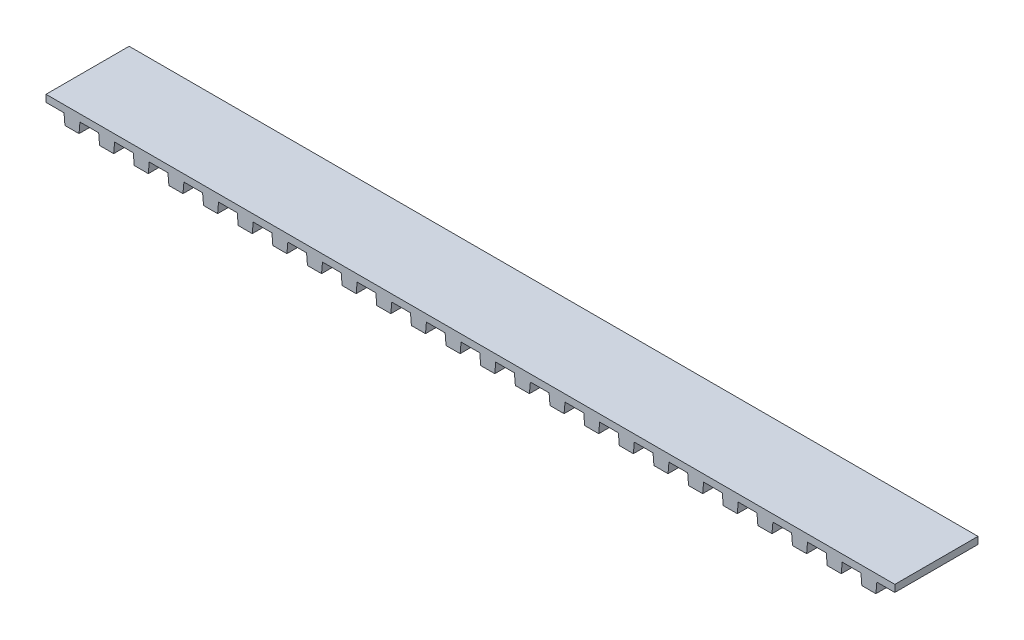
ISO-10303-21;
HEADER;
FILE_DESCRIPTION(('STEP AP214'),'2;1');
FILE_NAME('part.step','',(''),(''),'','','');
FILE_SCHEMA(('AUTOMOTIVE_DESIGN { 1 0 10303 214 1 1 1 1 }'));
ENDSEC;
DATA;
#1=APPLICATION_CONTEXT('core data for automotive mechanical design processes');
#2=APPLICATION_PROTOCOL_DEFINITION('international standard','automotive_design',2000,#1);
#3=PRODUCT_CONTEXT('',#1,'mechanical');
#4=PRODUCT('Part','Part','',(#3));
#5=PRODUCT_RELATED_PRODUCT_CATEGORY('part','',(#4));
#6=PRODUCT_DEFINITION_FORMATION('','',#4);
#7=PRODUCT_DEFINITION_CONTEXT('part definition',#1,'design');
#8=PRODUCT_DEFINITION('design','',#6,#7);
#9=PRODUCT_DEFINITION_SHAPE('','',#8);
#10=(LENGTH_UNIT() NAMED_UNIT(*) SI_UNIT(.MILLI.,.METRE.));
#11=(NAMED_UNIT(*) PLANE_ANGLE_UNIT() SI_UNIT($,.RADIAN.));
#12=(NAMED_UNIT(*) SI_UNIT($,.STERADIAN.) SOLID_ANGLE_UNIT());
#13=UNCERTAINTY_MEASURE_WITH_UNIT(LENGTH_MEASURE(1.E-05),#10,'distance_accuracy_value','');
#14=(GEOMETRIC_REPRESENTATION_CONTEXT(3) GLOBAL_UNCERTAINTY_ASSIGNED_CONTEXT((#13)) GLOBAL_UNIT_ASSIGNED_CONTEXT((#10,
#11,#12)) REPRESENTATION_CONTEXT('',''));
#15=CARTESIAN_POINT('',(0.,0.,0.));
#16=DIRECTION('',(0.,0.,1.));
#17=DIRECTION('',(1.,0.,0.));
#18=AXIS2_PLACEMENT_3D('',#15,#16,#17);
#19=CARTESIAN_POINT('',(0.,0.761999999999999,6.00000000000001));
#20=DIRECTION('',(0.,1.,0.));
#21=DIRECTION('',(0.,0.,1.));
#22=AXIS2_PLACEMENT_3D('',#19,#20,#21);
#23=PLANE('',#22);
#24=DIRECTION('',(0.,0.,-1.));
#25=VECTOR('',#24,1.);
#26=CARTESIAN_POINT('',(29.3246663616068,0.76200000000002,7.37898865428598));
#27=LINE('',#26,#25);
#28=CARTESIAN_POINT('',(29.3246663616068,0.762000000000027,6.00000000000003));
#29=VERTEX_POINT('',#28);
#30=CARTESIAN_POINT('',(29.3246663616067,0.761999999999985,0.));
#31=VERTEX_POINT('',#30);
#32=EDGE_CURVE('E1479',#29,#31,#27,.T.);
#33=ORIENTED_EDGE('',*,*,#32,.T.);
#34=DIRECTION('',(1.,0.,0.));
#35=VECTOR('',#34,1.);
#36=CARTESIAN_POINT('',(0.,0.761999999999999,0.));
#37=LINE('',#36,#35);
#38=CARTESIAN_POINT('',(30.625,0.761999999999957,0.));
#39=VERTEX_POINT('',#38);
#40=EDGE_CURVE('E1961',#31,#39,#37,.T.);
#41=ORIENTED_EDGE('',*,*,#40,.T.);
#42=DIRECTION('',(0.,0.,-1.));
#43=VECTOR('',#42,1.);
#44=CARTESIAN_POINT('',(30.625,0.761999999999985,6.00000000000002));
#45=LINE('',#44,#43);
#46=CARTESIAN_POINT('',(30.625,0.761999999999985,6.00000000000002));
#47=VERTEX_POINT('',#46);
#48=EDGE_CURVE('E11',#47,#39,#45,.T.);
#49=ORIENTED_EDGE('',*,*,#48,.F.);
#50=DIRECTION('',(1.,0.,0.));
#51=VECTOR('',#50,1.);
#52=CARTESIAN_POINT('',(0.,0.761999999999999,6.00000000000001));
#53=LINE('',#52,#51);
#54=EDGE_CURVE('E47',#29,#47,#53,.T.);
#55=ORIENTED_EDGE('',*,*,#54,.F.);
#56=EDGE_LOOP('',(#33,#41,#49,#55));
#57=FACE_BOUND('',#56,.T.);
#58=ADVANCED_FACE('F44',(#57),#23,.F.);
#59=DIRECTION('',(0.,0.,-1.));
#60=VECTOR('',#59,1.);
#61=CARTESIAN_POINT('',(28.1753336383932,0.762000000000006,7.37898865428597));
#62=LINE('',#61,#60);
#63=CARTESIAN_POINT('',(28.1753336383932,0.761999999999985,6.00000000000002));
#64=VERTEX_POINT('',#63);
#65=CARTESIAN_POINT('',(28.1753336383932,0.762000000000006,0.));
#66=VERTEX_POINT('',#65);
#67=EDGE_CURVE('E75',#64,#66,#62,.T.);
#68=ORIENTED_EDGE('',*,*,#67,.F.);
#69=CARTESIAN_POINT('',(26.8246663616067,0.761999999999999,6.00000000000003));
#70=VERTEX_POINT('',#69);
#71=EDGE_CURVE('E1963',#70,#64,#53,.T.);
#72=ORIENTED_EDGE('',*,*,#71,.F.);
#73=DIRECTION('',(0.,0.,-1.));
#74=VECTOR('',#73,1.);
#75=CARTESIAN_POINT('',(26.8246663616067,0.762000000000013,7.37898865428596));
#76=LINE('',#75,#74);
#77=CARTESIAN_POINT('',(26.8246663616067,0.761999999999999,0.));
#78=VERTEX_POINT('',#77);
#79=EDGE_CURVE('E1514',#70,#78,#76,.T.);
#80=ORIENTED_EDGE('',*,*,#79,.T.);
#81=EDGE_CURVE('E1958',#78,#66,#37,.T.);
#82=ORIENTED_EDGE('',*,*,#81,.T.);
#83=EDGE_LOOP('',(#68,#72,#80,#82));
#84=FACE_BOUND('',#83,.T.);
#85=ADVANCED_FACE('F2017',(#84),#23,.F.);
#86=DIRECTION('',(0.,0.,-1.));
#87=VECTOR('',#86,1.);
#88=CARTESIAN_POINT('',(25.6753336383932,0.761999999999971,7.37898865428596));
#89=LINE('',#88,#87);
#90=CARTESIAN_POINT('',(25.6753336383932,0.761999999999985,6.));
#91=VERTEX_POINT('',#90);
#92=CARTESIAN_POINT('',(25.6753336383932,0.761999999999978,0.));
#93=VERTEX_POINT('',#92);
#94=EDGE_CURVE('E1524',#91,#93,#89,.T.);
#95=ORIENTED_EDGE('',*,*,#94,.F.);
#96=CARTESIAN_POINT('',(24.3246663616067,0.761999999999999,6.00000000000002));
#97=VERTEX_POINT('',#96);
#98=EDGE_CURVE('E1962',#97,#91,#53,.T.);
#99=ORIENTED_EDGE('',*,*,#98,.F.);
#100=DIRECTION('',(0.,0.,-1.));
#101=VECTOR('',#100,1.);
#102=CARTESIAN_POINT('',(24.3246663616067,0.761999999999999,7.37898865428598));
#103=LINE('',#102,#101);
#104=CARTESIAN_POINT('',(24.3246663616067,0.761999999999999,0.));
#105=VERTEX_POINT('',#104);
#106=EDGE_CURVE('E1552',#97,#105,#103,.T.);
#107=ORIENTED_EDGE('',*,*,#106,.T.);
#108=EDGE_CURVE('E1955',#105,#93,#37,.T.);
#109=ORIENTED_EDGE('',*,*,#108,.T.);
#110=EDGE_LOOP('',(#95,#99,#107,#109));
#111=FACE_BOUND('',#110,.T.);
#112=ADVANCED_FACE('F2064',(#111),#23,.F.);
#113=DIRECTION('',(0.,0.,-1.));
#114=VECTOR('',#113,1.);
#115=CARTESIAN_POINT('',(23.1753336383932,0.761999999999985,7.37898865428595));
#116=LINE('',#115,#114);
#117=CARTESIAN_POINT('',(23.1753336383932,0.761999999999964,6.00000000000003));
#118=VERTEX_POINT('',#117);
#119=CARTESIAN_POINT('',(23.1753336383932,0.761999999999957,0.));
#120=VERTEX_POINT('',#119);
#121=EDGE_CURVE('E1562',#118,#120,#116,.T.);
#122=ORIENTED_EDGE('',*,*,#121,.F.);
#123=CARTESIAN_POINT('',(21.8246663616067,0.762000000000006,6.00000000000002));
#124=VERTEX_POINT('',#123);
#125=EDGE_CURVE('E1992',#124,#118,#53,.T.);
#126=ORIENTED_EDGE('',*,*,#125,.F.);
#127=DIRECTION('',(0.,0.,-1.));
#128=VECTOR('',#127,1.);
#129=CARTESIAN_POINT('',(21.8246663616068,0.762000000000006,7.37898865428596));
#130=LINE('',#129,#128);
#131=CARTESIAN_POINT('',(21.8246663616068,0.762000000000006,0.));
#132=VERTEX_POINT('',#131);
#133=EDGE_CURVE('E1590',#124,#132,#130,.T.);
#134=ORIENTED_EDGE('',*,*,#133,.T.);
#135=EDGE_CURVE('E1952',#132,#120,#37,.T.);
#136=ORIENTED_EDGE('',*,*,#135,.T.);
#137=EDGE_LOOP('',(#122,#126,#134,#136));
#138=FACE_BOUND('',#137,.T.);
#139=ADVANCED_FACE('F2079',(#138),#23,.F.);
#140=DIRECTION('',(0.,0.,-1.));
#141=VECTOR('',#140,1.);
#142=CARTESIAN_POINT('',(20.6753336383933,0.761999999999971,7.37898865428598));
#143=LINE('',#142,#141);
#144=CARTESIAN_POINT('',(20.6753336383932,0.761999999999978,6.00000000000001));
#145=VERTEX_POINT('',#144);
#146=CARTESIAN_POINT('',(20.6753336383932,0.761999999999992,0.));
#147=VERTEX_POINT('',#146);
#148=EDGE_CURVE('E1600',#145,#147,#143,.T.);
#149=ORIENTED_EDGE('',*,*,#148,.F.);
#150=CARTESIAN_POINT('',(19.3246663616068,0.761999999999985,6.00000000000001));
#151=VERTEX_POINT('',#150);
#152=EDGE_CURVE('E1990',#151,#145,#53,.T.);
#153=ORIENTED_EDGE('',*,*,#152,.F.);
#154=DIRECTION('',(0.,0.,-1.));
#155=VECTOR('',#154,1.);
#156=CARTESIAN_POINT('',(19.3246663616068,0.761999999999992,7.37898865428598));
#157=LINE('',#156,#155);
#158=CARTESIAN_POINT('',(19.3246663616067,0.761999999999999,0.));
#159=VERTEX_POINT('',#158);
#160=EDGE_CURVE('E1628',#151,#159,#157,.T.);
#161=ORIENTED_EDGE('',*,*,#160,.T.);
#162=EDGE_CURVE('E1948',#159,#147,#37,.T.);
#163=ORIENTED_EDGE('',*,*,#162,.T.);
#164=EDGE_LOOP('',(#149,#153,#161,#163));
#165=FACE_BOUND('',#164,.T.);
#166=ADVANCED_FACE('F2090',(#165),#23,.F.);
#167=DIRECTION('',(0.,0.,-1.));
#168=VECTOR('',#167,1.);
#169=CARTESIAN_POINT('',(18.1753336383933,0.761999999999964,7.37898865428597));
#170=LINE('',#169,#168);
#171=CARTESIAN_POINT('',(18.1753336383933,0.761999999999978,6.00000000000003));
#172=VERTEX_POINT('',#171);
#173=CARTESIAN_POINT('',(18.1753336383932,0.761999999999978,0.));
#174=VERTEX_POINT('',#173);
#175=EDGE_CURVE('E1638',#172,#174,#170,.T.);
#176=ORIENTED_EDGE('',*,*,#175,.F.);
#177=CARTESIAN_POINT('',(16.8246663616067,0.762000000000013,6.00000000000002));
#178=VERTEX_POINT('',#177);
#179=EDGE_CURVE('E1988',#178,#172,#53,.T.);
#180=ORIENTED_EDGE('',*,*,#179,.F.);
#181=DIRECTION('',(0.,0.,-1.));
#182=VECTOR('',#181,1.);
#183=CARTESIAN_POINT('',(16.8246663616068,0.762000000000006,7.37898865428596));
#184=LINE('',#183,#182);
#185=CARTESIAN_POINT('',(16.8246663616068,0.762000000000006,0.));
#186=VERTEX_POINT('',#185);
#187=EDGE_CURVE('E1666',#178,#186,#184,.T.);
#188=ORIENTED_EDGE('',*,*,#187,.T.);
#189=EDGE_CURVE('E1944',#186,#174,#37,.T.);
#190=ORIENTED_EDGE('',*,*,#189,.T.);
#191=EDGE_LOOP('',(#176,#180,#188,#190));
#192=FACE_BOUND('',#191,.T.);
#193=ADVANCED_FACE('F2104',(#192),#23,.F.);
#194=DIRECTION('',(0.,0.,-1.));
#195=VECTOR('',#194,1.);
#196=CARTESIAN_POINT('',(15.6753336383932,0.761999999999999,7.37898865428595));
#197=LINE('',#196,#195);
#198=CARTESIAN_POINT('',(15.6753336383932,0.761999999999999,6.00000000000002));
#199=VERTEX_POINT('',#198);
#200=CARTESIAN_POINT('',(15.6753336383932,0.761999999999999,0.));
#201=VERTEX_POINT('',#200);
#202=EDGE_CURVE('E1676',#199,#201,#197,.T.);
#203=ORIENTED_EDGE('',*,*,#202,.F.);
#204=CARTESIAN_POINT('',(14.3246663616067,0.76200000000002,6.00000000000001));
#205=VERTEX_POINT('',#204);
#206=EDGE_CURVE('E1986',#205,#199,#53,.T.);
#207=ORIENTED_EDGE('',*,*,#206,.F.);
#208=DIRECTION('',(0.,0.,-1.));
#209=VECTOR('',#208,1.);
#210=CARTESIAN_POINT('',(14.3246663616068,0.762000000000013,7.37898865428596));
#211=LINE('',#210,#209);
#212=CARTESIAN_POINT('',(14.3246663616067,0.761999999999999,0.));
#213=VERTEX_POINT('',#212);
#214=EDGE_CURVE('E1704',#205,#213,#211,.T.);
#215=ORIENTED_EDGE('',*,*,#214,.T.);
#216=EDGE_CURVE('E1940',#213,#201,#37,.T.);
#217=ORIENTED_EDGE('',*,*,#216,.T.);
#218=EDGE_LOOP('',(#203,#207,#215,#217));
#219=FACE_BOUND('',#218,.T.);
#220=ADVANCED_FACE('F2407',(#219),#23,.F.);
#221=DIRECTION('',(0.,0.,-1.));
#222=VECTOR('',#221,1.);
#223=CARTESIAN_POINT('',(13.1753336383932,0.761999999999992,7.37898865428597));
#224=LINE('',#223,#222);
#225=CARTESIAN_POINT('',(13.1753336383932,0.761999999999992,6.00000000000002));
#226=VERTEX_POINT('',#225);
#227=CARTESIAN_POINT('',(13.1753336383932,0.761999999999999,0.));
#228=VERTEX_POINT('',#227);
#229=EDGE_CURVE('E1714',#226,#228,#224,.T.);
#230=ORIENTED_EDGE('',*,*,#229,.F.);
#231=CARTESIAN_POINT('',(11.8246663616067,0.762000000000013,6.00000000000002));
#232=VERTEX_POINT('',#231);
#233=EDGE_CURVE('E1984',#232,#226,#53,.T.);
#234=ORIENTED_EDGE('',*,*,#233,.F.);
#235=DIRECTION('',(0.,0.,-1.));
#236=VECTOR('',#235,1.);
#237=CARTESIAN_POINT('',(11.8246663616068,0.762000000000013,7.37898865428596));
#238=LINE('',#237,#236);
#239=CARTESIAN_POINT('',(11.8246663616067,0.762000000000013,0.));
#240=VERTEX_POINT('',#239);
#241=EDGE_CURVE('E1742',#232,#240,#238,.T.);
#242=ORIENTED_EDGE('',*,*,#241,.T.);
#243=EDGE_CURVE('E1936',#240,#228,#37,.T.);
#244=ORIENTED_EDGE('',*,*,#243,.T.);
#245=EDGE_LOOP('',(#230,#234,#242,#244));
#246=FACE_BOUND('',#245,.T.);
#247=ADVANCED_FACE('F2394',(#246),#23,.F.);
#248=DIRECTION('',(0.,0.,-1.));
#249=VECTOR('',#248,1.);
#250=CARTESIAN_POINT('',(10.6753336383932,0.761999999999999,7.37898865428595));
#251=LINE('',#250,#249);
#252=CARTESIAN_POINT('',(10.6753336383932,0.761999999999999,6.));
#253=VERTEX_POINT('',#252);
#254=CARTESIAN_POINT('',(10.6753336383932,0.761999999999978,0.));
#255=VERTEX_POINT('',#254);
#256=EDGE_CURVE('E1752',#253,#255,#251,.T.);
#257=ORIENTED_EDGE('',*,*,#256,.F.);
#258=CARTESIAN_POINT('',(9.32466636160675,0.762000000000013,6.00000000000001));
#259=VERTEX_POINT('',#258);
#260=EDGE_CURVE('E1982',#259,#253,#53,.T.);
#261=ORIENTED_EDGE('',*,*,#260,.F.);
#262=DIRECTION('',(0.,0.,-1.));
#263=VECTOR('',#262,1.);
#264=CARTESIAN_POINT('',(9.32466636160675,0.762000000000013,7.37898865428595));
#265=LINE('',#264,#263);
#266=CARTESIAN_POINT('',(9.32466636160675,0.762000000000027,0.));
#267=VERTEX_POINT('',#266);
#268=EDGE_CURVE('E1780',#259,#267,#265,.T.);
#269=ORIENTED_EDGE('',*,*,#268,.T.);
#270=EDGE_CURVE('E1932',#267,#255,#37,.T.);
#271=ORIENTED_EDGE('',*,*,#270,.T.);
#272=EDGE_LOOP('',(#257,#261,#269,#271));
#273=FACE_BOUND('',#272,.T.);
#274=ADVANCED_FACE('F2381',(#273),#23,.F.);
#275=DIRECTION('',(0.,0.,-1.));
#276=VECTOR('',#275,1.);
#277=CARTESIAN_POINT('',(8.17533363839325,0.761999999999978,7.37898865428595));
#278=LINE('',#277,#276);
#279=CARTESIAN_POINT('',(8.17533363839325,0.761999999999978,6.00000000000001));
#280=VERTEX_POINT('',#279);
#281=CARTESIAN_POINT('',(8.17533363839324,0.761999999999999,0.));
#282=VERTEX_POINT('',#281);
#283=EDGE_CURVE('E1790',#280,#282,#278,.T.);
#284=ORIENTED_EDGE('',*,*,#283,.F.);
#285=CARTESIAN_POINT('',(6.82466636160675,0.762000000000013,6.));
#286=VERTEX_POINT('',#285);
#287=EDGE_CURVE('E1980',#286,#280,#53,.T.);
#288=ORIENTED_EDGE('',*,*,#287,.F.);
#289=DIRECTION('',(0.,0.,-1.));
#290=VECTOR('',#289,1.);
#291=CARTESIAN_POINT('',(6.82466636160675,0.762000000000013,7.37898865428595));
#292=LINE('',#291,#290);
#293=CARTESIAN_POINT('',(6.82466636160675,0.76200000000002,0.));
#294=VERTEX_POINT('',#293);
#295=EDGE_CURVE('E1818',#286,#294,#292,.T.);
#296=ORIENTED_EDGE('',*,*,#295,.T.);
#297=EDGE_CURVE('E1928',#294,#282,#37,.T.);
#298=ORIENTED_EDGE('',*,*,#297,.T.);
#299=EDGE_LOOP('',(#284,#288,#296,#298));
#300=FACE_BOUND('',#299,.T.);
#301=ADVANCED_FACE('F2368',(#300),#23,.F.);
#302=DIRECTION('',(0.,0.,-1.));
#303=VECTOR('',#302,1.);
#304=CARTESIAN_POINT('',(5.67533363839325,0.761999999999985,7.37898865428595));
#305=LINE('',#304,#303);
#306=CARTESIAN_POINT('',(5.67533363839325,0.761999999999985,6.00000000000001));
#307=VERTEX_POINT('',#306);
#308=CARTESIAN_POINT('',(5.67533363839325,0.761999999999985,0.));
#309=VERTEX_POINT('',#308);
#310=EDGE_CURVE('E1828',#307,#309,#305,.T.);
#311=ORIENTED_EDGE('',*,*,#310,.F.);
#312=CARTESIAN_POINT('',(4.32466636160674,0.761999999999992,6.));
#313=VERTEX_POINT('',#312);
#314=EDGE_CURVE('E1978',#313,#307,#53,.T.);
#315=ORIENTED_EDGE('',*,*,#314,.F.);
#316=DIRECTION('',(0.,0.,-1.));
#317=VECTOR('',#316,1.);
#318=CARTESIAN_POINT('',(4.32466636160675,0.761999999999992,7.37898865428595));
#319=LINE('',#318,#317);
#320=CARTESIAN_POINT('',(4.32466636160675,0.761999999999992,0.));
#321=VERTEX_POINT('',#320);
#322=EDGE_CURVE('E1855',#313,#321,#319,.T.);
#323=ORIENTED_EDGE('',*,*,#322,.T.);
#324=EDGE_CURVE('E1923',#321,#309,#37,.T.);
#325=ORIENTED_EDGE('',*,*,#324,.T.);
#326=EDGE_LOOP('',(#311,#315,#323,#325));
#327=FACE_BOUND('',#326,.T.);
#328=ADVANCED_FACE('F2355',(#327),#23,.F.);
#329=DIRECTION('',(0.,0.,-1.));
#330=VECTOR('',#329,1.);
#331=CARTESIAN_POINT('',(3.17533363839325,0.761999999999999,7.37898865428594));
#332=LINE('',#331,#330);
#333=CARTESIAN_POINT('',(3.17533363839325,0.761999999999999,6.00000000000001));
#334=VERTEX_POINT('',#333);
#335=CARTESIAN_POINT('',(3.17533363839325,0.761999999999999,0.));
#336=VERTEX_POINT('',#335);
#337=EDGE_CURVE('E1865',#334,#336,#332,.T.);
#338=ORIENTED_EDGE('',*,*,#337,.F.);
#339=CARTESIAN_POINT('',(1.82466636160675,0.761999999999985,5.99999999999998));
#340=VERTEX_POINT('',#339);
#341=EDGE_CURVE('E1973',#340,#334,#53,.T.);
#342=ORIENTED_EDGE('',*,*,#341,.F.);
#343=DIRECTION('',(0.,0.,-1.));
#344=VECTOR('',#343,1.);
#345=CARTESIAN_POINT('',(1.82466636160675,0.761999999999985,7.37898865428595));
#346=LINE('',#345,#344);
#347=CARTESIAN_POINT('',(1.82466636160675,0.761999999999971,0.));
#348=VERTEX_POINT('',#347);
#349=EDGE_CURVE('E1888',#340,#348,#346,.T.);
#350=ORIENTED_EDGE('',*,*,#349,.T.);
#351=EDGE_CURVE('E1915',#348,#336,#37,.T.);
#352=ORIENTED_EDGE('',*,*,#351,.T.);
#353=EDGE_LOOP('',(#338,#342,#350,#352));
#354=FACE_BOUND('',#353,.T.);
#355=ADVANCED_FACE('F2342',(#354),#23,.F.);
#356=DIRECTION('',(0.,0.,-1.));
#357=VECTOR('',#356,1.);
#358=CARTESIAN_POINT('',(0.675333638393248,0.761999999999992,7.37898865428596));
#359=LINE('',#358,#357);
#360=CARTESIAN_POINT('',(0.675333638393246,0.761999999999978,6.));
#361=VERTEX_POINT('',#360);
#362=CARTESIAN_POINT('',(0.675333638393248,0.761999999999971,0.));
#363=VERTEX_POINT('',#362);
#364=EDGE_CURVE('E1898',#361,#363,#359,.T.);
#365=ORIENTED_EDGE('',*,*,#364,.F.);
#366=CARTESIAN_POINT('',(-0.675333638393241,0.761999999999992,6.00000000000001));
#367=VERTEX_POINT('',#366);
#368=EDGE_CURVE('E1976',#367,#361,#53,.T.);
#369=ORIENTED_EDGE('',*,*,#368,.F.);
#370=DIRECTION('',(0.,0.,-1.));
#371=VECTOR('',#370,1.);
#372=CARTESIAN_POINT('',(-0.675333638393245,0.761999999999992,7.37898865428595));
#373=LINE('',#372,#371);
#374=CARTESIAN_POINT('',(-0.675333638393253,0.761999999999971,0.));
#375=VERTEX_POINT('',#374);
#376=EDGE_CURVE('E1297',#367,#375,#373,.T.);
#377=ORIENTED_EDGE('',*,*,#376,.T.);
#378=EDGE_CURVE('E1920',#375,#363,#37,.T.);
#379=ORIENTED_EDGE('',*,*,#378,.T.);
#380=EDGE_LOOP('',(#365,#369,#377,#379));
#381=FACE_BOUND('',#380,.T.);
#382=ADVANCED_FACE('F2323',(#381),#23,.F.);
#383=CARTESIAN_POINT('',(30.625,0.761999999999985,6.00000000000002));
#384=DIRECTION('',(-1.,0.,0.));
#385=DIRECTION('',(0.,0.,1.));
#386=AXIS2_PLACEMENT_3D('',#383,#384,#385);
#387=PLANE('',#386);
#388=DIRECTION('',(0.,1.,0.));
#389=VECTOR('',#388,1.);
#390=CARTESIAN_POINT('',(30.625,0.761999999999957,0.));
#391=LINE('',#390,#389);
#392=CARTESIAN_POINT('',(30.625,1.26999999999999,0.));
#393=VERTEX_POINT('',#392);
#394=EDGE_CURVE('E1910',#39,#393,#391,.T.);
#395=ORIENTED_EDGE('',*,*,#394,.T.);
#396=DIRECTION('',(0.,0.,-1.));
#397=VECTOR('',#396,1.);
#398=CARTESIAN_POINT('',(30.625,1.26999999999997,6.00000000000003));
#399=LINE('',#398,#397);
#400=CARTESIAN_POINT('',(30.625,1.26999999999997,6.00000000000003));
#401=VERTEX_POINT('',#400);
#402=EDGE_CURVE('E54',#401,#393,#399,.T.);
#403=ORIENTED_EDGE('',*,*,#402,.F.);
#404=DIRECTION('',(0.,1.,0.));
#405=VECTOR('',#404,1.);
#406=CARTESIAN_POINT('',(30.625,0.761999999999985,6.00000000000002));
#407=LINE('',#406,#405);
#408=EDGE_CURVE('E1968',#47,#401,#407,.T.);
#409=ORIENTED_EDGE('',*,*,#408,.F.);
#410=ORIENTED_EDGE('',*,*,#48,.T.);
#411=EDGE_LOOP('',(#395,#403,#409,#410));
#412=FACE_BOUND('',#411,.T.);
#413=ADVANCED_FACE('F2034',(#412),#387,.F.);
#414=CARTESIAN_POINT('',(0.,1.26999999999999,5.99999999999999));
#415=DIRECTION('',(0.,-1.,0.));
#416=DIRECTION('',(0.,0.,-1.));
#417=AXIS2_PLACEMENT_3D('',#414,#415,#416);
#418=PLANE('',#417);
#419=DIRECTION('',(-1.,0.,0.));
#420=VECTOR('',#419,1.);
#421=CARTESIAN_POINT('',(0.,1.26999999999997,0.));
#422=LINE('',#421,#420);
#423=CARTESIAN_POINT('',(-30.625,1.26999999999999,0.));
#424=VERTEX_POINT('',#423);
#425=EDGE_CURVE('E1967',#393,#424,#422,.T.);
#426=ORIENTED_EDGE('',*,*,#425,.T.);
#427=DIRECTION('',(0.,0.,-1.));
#428=VECTOR('',#427,1.);
#429=CARTESIAN_POINT('',(-30.625,1.27,5.99999999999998));
#430=LINE('',#429,#428);
#431=CARTESIAN_POINT('',(-30.625,1.27,5.99999999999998));
#432=VERTEX_POINT('',#431);
#433=EDGE_CURVE('E2140',#432,#424,#430,.T.);
#434=ORIENTED_EDGE('',*,*,#433,.F.);
#435=DIRECTION('',(-1.,0.,0.));
#436=VECTOR('',#435,1.);
#437=CARTESIAN_POINT('',(0.,1.26999999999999,5.99999999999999));
#438=LINE('',#437,#436);
#439=EDGE_CURVE('E2131',#401,#432,#438,.T.);
#440=ORIENTED_EDGE('',*,*,#439,.F.);
#441=ORIENTED_EDGE('',*,*,#402,.T.);
#442=EDGE_LOOP('',(#426,#434,#440,#441));
#443=FACE_BOUND('',#442,.T.);
#444=ADVANCED_FACE('F2138',(#443),#418,.F.);
#445=CARTESIAN_POINT('',(0.,1.26999999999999,5.99999999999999));
#446=DIRECTION('',(0.,0.,-1.));
#447=DIRECTION('',(-1.,0.,0.));
#448=AXIS2_PLACEMENT_3D('',#445,#446,#447);
#449=PLANE('',#448);
#450=ORIENTED_EDGE('',*,*,#439,.T.);
#451=DIRECTION('',(0.,1.,0.));
#452=VECTOR('',#451,1.);
#453=CARTESIAN_POINT('',(-30.625,0.761999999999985,5.99999999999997));
#454=LINE('',#453,#452);
#455=CARTESIAN_POINT('',(-30.625,0.761999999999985,5.99999999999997));
#456=VERTEX_POINT('',#455);
#457=EDGE_CURVE('E1368',#456,#432,#454,.T.);
#458=ORIENTED_EDGE('',*,*,#457,.F.);
#459=DIRECTION('',(-1.,0.,0.));
#460=VECTOR('',#459,1.);
#461=CARTESIAN_POINT('',(0.,0.761999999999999,6.00000000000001));
#462=LINE('',#461,#460);
#463=CARTESIAN_POINT('',(-29.3246663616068,0.761999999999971,5.99999999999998));
#464=VERTEX_POINT('',#463);
#465=EDGE_CURVE('E1364',#464,#456,#462,.T.);
#466=ORIENTED_EDGE('',*,*,#465,.F.);
#467=DIRECTION('',(0.0871557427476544,-0.996194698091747,0.));
#468=VECTOR('',#467,1.);
#469=CARTESIAN_POINT('',(-29.258,0.,5.99999999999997));
#470=LINE('',#469,#468);
#471=CARTESIAN_POINT('',(-29.258,0.,5.99999999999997));
#472=VERTEX_POINT('',#471);
#473=EDGE_CURVE('E906',#464,#472,#470,.T.);
#474=ORIENTED_EDGE('',*,*,#473,.T.);
#475=DIRECTION('',(1.,0.,0.));
#476=VECTOR('',#475,1.);
#477=CARTESIAN_POINT('',(-28.242,0.,5.99999999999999));
#478=LINE('',#477,#476);
#479=CARTESIAN_POINT('',(-28.242,0.,5.99999999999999));
#480=VERTEX_POINT('',#479);
#481=EDGE_CURVE('E910',#472,#480,#478,.T.);
#482=ORIENTED_EDGE('',*,*,#481,.T.);
#483=DIRECTION('',(0.0871557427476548,0.996194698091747,0.));
#484=VECTOR('',#483,1.);
#485=CARTESIAN_POINT('',(-28.1753336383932,0.761999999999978,5.99999999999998));
#486=LINE('',#485,#484);
#487=CARTESIAN_POINT('',(-28.1753336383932,0.761999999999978,5.99999999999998));
#488=VERTEX_POINT('',#487);
#489=EDGE_CURVE('E870',#480,#488,#486,.T.);
#490=ORIENTED_EDGE('',*,*,#489,.T.);
#491=CARTESIAN_POINT('',(-26.8246663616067,0.761999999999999,5.99999999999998));
#492=VERTEX_POINT('',#491);
#493=EDGE_CURVE('E1361',#492,#488,#462,.T.);
#494=ORIENTED_EDGE('',*,*,#493,.F.);
#495=DIRECTION('',(0.0871557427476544,-0.996194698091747,0.));
#496=VECTOR('',#495,1.);
#497=CARTESIAN_POINT('',(-26.758,0.,5.99999999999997));
#498=LINE('',#497,#496);
#499=CARTESIAN_POINT('',(-26.758,0.,5.99999999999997));
#500=VERTEX_POINT('',#499);
#501=EDGE_CURVE('E916',#492,#500,#498,.T.);
#502=ORIENTED_EDGE('',*,*,#501,.T.);
#503=DIRECTION('',(1.,0.,0.));
#504=VECTOR('',#503,1.);
#505=CARTESIAN_POINT('',(-25.742,0.,5.99999999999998));
#506=LINE('',#505,#504);
#507=CARTESIAN_POINT('',(-25.742,0.,5.99999999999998));
#508=VERTEX_POINT('',#507);
#509=EDGE_CURVE('E911',#500,#508,#506,.T.);
#510=ORIENTED_EDGE('',*,*,#509,.T.);
#511=DIRECTION('',(0.0871557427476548,0.996194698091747,0.));
#512=VECTOR('',#511,1.);
#513=CARTESIAN_POINT('',(-25.6753336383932,0.761999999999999,5.99999999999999));
#514=LINE('',#513,#512);
#515=CARTESIAN_POINT('',(-25.6753336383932,0.761999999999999,5.99999999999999));
#516=VERTEX_POINT('',#515);
#517=EDGE_CURVE('E915',#508,#516,#514,.T.);
#518=ORIENTED_EDGE('',*,*,#517,.T.);
#519=CARTESIAN_POINT('',(-24.3246663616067,0.761999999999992,6.));
#520=VERTEX_POINT('',#519);
#521=EDGE_CURVE('E1360',#520,#516,#462,.T.);
#522=ORIENTED_EDGE('',*,*,#521,.F.);
#523=DIRECTION('',(0.0871557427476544,-0.996194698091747,0.));
#524=VECTOR('',#523,1.);
#525=CARTESIAN_POINT('',(-24.258,0.,6.));
#526=LINE('',#525,#524);
#527=CARTESIAN_POINT('',(-24.258,0.,6.));
#528=VERTEX_POINT('',#527);
#529=EDGE_CURVE('E952',#520,#528,#526,.T.);
#530=ORIENTED_EDGE('',*,*,#529,.T.);
#531=DIRECTION('',(1.,0.,0.));
#532=VECTOR('',#531,1.);
#533=CARTESIAN_POINT('',(-23.242,0.,5.99999999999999));
#534=LINE('',#533,#532);
#535=CARTESIAN_POINT('',(-23.242,0.,5.99999999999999));
#536=VERTEX_POINT('',#535);
#537=EDGE_CURVE('E947',#528,#536,#534,.T.);
#538=ORIENTED_EDGE('',*,*,#537,.T.);
#539=DIRECTION('',(0.0871557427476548,0.996194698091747,0.));
#540=VECTOR('',#539,1.);
#541=CARTESIAN_POINT('',(-23.1753336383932,0.761999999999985,5.99999999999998));
#542=LINE('',#541,#540);
#543=CARTESIAN_POINT('',(-23.1753336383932,0.761999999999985,5.99999999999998));
#544=VERTEX_POINT('',#543);
#545=EDGE_CURVE('E951',#536,#544,#542,.T.);
#546=ORIENTED_EDGE('',*,*,#545,.T.);
#547=CARTESIAN_POINT('',(-21.8246663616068,0.761999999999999,6.));
#548=VERTEX_POINT('',#547);
#549=EDGE_CURVE('E1389',#548,#544,#462,.T.);
#550=ORIENTED_EDGE('',*,*,#549,.F.);
#551=DIRECTION('',(0.0871557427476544,-0.996194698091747,0.));
#552=VECTOR('',#551,1.);
#553=CARTESIAN_POINT('',(-21.758,0.,5.99999999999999));
#554=LINE('',#553,#552);
#555=CARTESIAN_POINT('',(-21.758,0.,5.99999999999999));
#556=VERTEX_POINT('',#555);
#557=EDGE_CURVE('E988',#548,#556,#554,.T.);
#558=ORIENTED_EDGE('',*,*,#557,.T.);
#559=DIRECTION('',(1.,0.,0.));
#560=VECTOR('',#559,1.);
#561=CARTESIAN_POINT('',(-20.742,0.,6.));
#562=LINE('',#561,#560);
#563=CARTESIAN_POINT('',(-20.742,0.,6.));
#564=VERTEX_POINT('',#563);
#565=EDGE_CURVE('E983',#556,#564,#562,.T.);
#566=ORIENTED_EDGE('',*,*,#565,.T.);
#567=DIRECTION('',(0.0871557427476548,0.996194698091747,0.));
#568=VECTOR('',#567,1.);
#569=CARTESIAN_POINT('',(-20.6753336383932,0.761999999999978,6.00000000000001));
#570=LINE('',#569,#568);
#571=CARTESIAN_POINT('',(-20.6753336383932,0.761999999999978,6.00000000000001));
#572=VERTEX_POINT('',#571);
#573=EDGE_CURVE('E987',#564,#572,#570,.T.);
#574=ORIENTED_EDGE('',*,*,#573,.T.);
#575=CARTESIAN_POINT('',(-19.3246663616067,0.761999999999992,6.));
#576=VERTEX_POINT('',#575);
#577=EDGE_CURVE('E1387',#576,#572,#462,.T.);
#578=ORIENTED_EDGE('',*,*,#577,.F.);
#579=DIRECTION('',(0.0871557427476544,-0.996194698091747,0.));
#580=VECTOR('',#579,1.);
#581=CARTESIAN_POINT('',(-19.258,0.,6.));
#582=LINE('',#581,#580);
#583=CARTESIAN_POINT('',(-19.258,0.,6.));
#584=VERTEX_POINT('',#583);
#585=EDGE_CURVE('E1024',#576,#584,#582,.T.);
#586=ORIENTED_EDGE('',*,*,#585,.T.);
#587=DIRECTION('',(1.,0.,0.));
#588=VECTOR('',#587,1.);
#589=CARTESIAN_POINT('',(-18.242,0.,6.));
#590=LINE('',#589,#588);
#591=CARTESIAN_POINT('',(-18.242,0.,6.));
#592=VERTEX_POINT('',#591);
#593=EDGE_CURVE('E1019',#584,#592,#590,.T.);
#594=ORIENTED_EDGE('',*,*,#593,.T.);
#595=DIRECTION('',(0.0871557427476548,0.996194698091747,0.));
#596=VECTOR('',#595,1.);
#597=CARTESIAN_POINT('',(-18.1753336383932,0.761999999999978,5.99999999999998));
#598=LINE('',#597,#596);
#599=CARTESIAN_POINT('',(-18.1753336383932,0.761999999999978,5.99999999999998));
#600=VERTEX_POINT('',#599);
#601=EDGE_CURVE('E1023',#592,#600,#598,.T.);
#602=ORIENTED_EDGE('',*,*,#601,.T.);
#603=CARTESIAN_POINT('',(-16.8246663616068,0.761999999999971,6.));
#604=VERTEX_POINT('',#603);
#605=EDGE_CURVE('E1385',#604,#600,#462,.T.);
#606=ORIENTED_EDGE('',*,*,#605,.F.);
#607=DIRECTION('',(0.0871557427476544,-0.996194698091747,0.));
#608=VECTOR('',#607,1.);
#609=CARTESIAN_POINT('',(-16.758,0.,5.99999999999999));
#610=LINE('',#609,#608);
#611=CARTESIAN_POINT('',(-16.758,0.,5.99999999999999));
#612=VERTEX_POINT('',#611);
#613=EDGE_CURVE('E1060',#604,#612,#610,.T.);
#614=ORIENTED_EDGE('',*,*,#613,.T.);
#615=DIRECTION('',(1.,0.,0.));
#616=VECTOR('',#615,1.);
#617=CARTESIAN_POINT('',(-15.742,0.,5.99999999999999));
#618=LINE('',#617,#616);
#619=CARTESIAN_POINT('',(-15.742,0.,5.99999999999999));
#620=VERTEX_POINT('',#619);
#621=EDGE_CURVE('E1055',#612,#620,#618,.T.);
#622=ORIENTED_EDGE('',*,*,#621,.T.);
#623=DIRECTION('',(0.0871557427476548,0.996194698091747,0.));
#624=VECTOR('',#623,1.);
#625=CARTESIAN_POINT('',(-15.6753336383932,0.761999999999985,6.));
#626=LINE('',#625,#624);
#627=CARTESIAN_POINT('',(-15.6753336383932,0.761999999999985,6.));
#628=VERTEX_POINT('',#627);
#629=EDGE_CURVE('E1059',#620,#628,#626,.T.);
#630=ORIENTED_EDGE('',*,*,#629,.T.);
#631=CARTESIAN_POINT('',(-14.3246663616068,0.761999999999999,6.));
#632=VERTEX_POINT('',#631);
#633=EDGE_CURVE('E1383',#632,#628,#462,.T.);
#634=ORIENTED_EDGE('',*,*,#633,.F.);
#635=DIRECTION('',(0.0871557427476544,-0.996194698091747,0.));
#636=VECTOR('',#635,1.);
#637=CARTESIAN_POINT('',(-14.258,0.,6.00000000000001));
#638=LINE('',#637,#636);
#639=CARTESIAN_POINT('',(-14.258,0.,6.00000000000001));
#640=VERTEX_POINT('',#639);
#641=EDGE_CURVE('E1096',#632,#640,#638,.T.);
#642=ORIENTED_EDGE('',*,*,#641,.T.);
#643=DIRECTION('',(1.,0.,0.));
#644=VECTOR('',#643,1.);
#645=CARTESIAN_POINT('',(-13.242,0.,6.));
#646=LINE('',#645,#644);
#647=CARTESIAN_POINT('',(-13.242,0.,6.));
#648=VERTEX_POINT('',#647);
#649=EDGE_CURVE('E1091',#640,#648,#646,.T.);
#650=ORIENTED_EDGE('',*,*,#649,.T.);
#651=DIRECTION('',(0.0871557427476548,0.996194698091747,0.));
#652=VECTOR('',#651,1.);
#653=CARTESIAN_POINT('',(-13.1753336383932,0.762000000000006,5.99999999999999));
#654=LINE('',#653,#652);
#655=CARTESIAN_POINT('',(-13.1753336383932,0.762000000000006,5.99999999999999));
#656=VERTEX_POINT('',#655);
#657=EDGE_CURVE('E1095',#648,#656,#654,.T.);
#658=ORIENTED_EDGE('',*,*,#657,.T.);
#659=CARTESIAN_POINT('',(-11.8246663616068,0.761999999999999,5.99999999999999));
#660=VERTEX_POINT('',#659);
#661=EDGE_CURVE('E1381',#660,#656,#462,.T.);
#662=ORIENTED_EDGE('',*,*,#661,.F.);
#663=DIRECTION('',(0.0871557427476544,-0.996194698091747,0.));
#664=VECTOR('',#663,1.);
#665=CARTESIAN_POINT('',(-11.758,0.,5.99999999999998));
#666=LINE('',#665,#664);
#667=CARTESIAN_POINT('',(-11.758,0.,5.99999999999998));
#668=VERTEX_POINT('',#667);
#669=EDGE_CURVE('E1132',#660,#668,#666,.T.);
#670=ORIENTED_EDGE('',*,*,#669,.T.);
#671=DIRECTION('',(1.,0.,0.));
#672=VECTOR('',#671,1.);
#673=CARTESIAN_POINT('',(-10.742,0.,5.99999999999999));
#674=LINE('',#673,#672);
#675=CARTESIAN_POINT('',(-10.742,0.,5.99999999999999));
#676=VERTEX_POINT('',#675);
#677=EDGE_CURVE('E1127',#668,#676,#674,.T.);
#678=ORIENTED_EDGE('',*,*,#677,.T.);
#679=DIRECTION('',(0.0871557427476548,0.996194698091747,0.));
#680=VECTOR('',#679,1.);
#681=CARTESIAN_POINT('',(-10.6753336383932,0.761999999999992,6.00000000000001));
#682=LINE('',#681,#680);
#683=CARTESIAN_POINT('',(-10.6753336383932,0.761999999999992,6.00000000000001));
#684=VERTEX_POINT('',#683);
#685=EDGE_CURVE('E1131',#676,#684,#682,.T.);
#686=ORIENTED_EDGE('',*,*,#685,.T.);
#687=CARTESIAN_POINT('',(-9.32466636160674,0.761999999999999,5.99999999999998));
#688=VERTEX_POINT('',#687);
#689=EDGE_CURVE('E1379',#688,#684,#462,.T.);
#690=ORIENTED_EDGE('',*,*,#689,.F.);
#691=DIRECTION('',(0.0871557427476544,-0.996194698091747,0.));
#692=VECTOR('',#691,1.);
#693=CARTESIAN_POINT('',(-9.258,0.,6.));
#694=LINE('',#693,#692);
#695=CARTESIAN_POINT('',(-9.258,0.,6.));
#696=VERTEX_POINT('',#695);
#697=EDGE_CURVE('E1168',#688,#696,#694,.T.);
#698=ORIENTED_EDGE('',*,*,#697,.T.);
#699=DIRECTION('',(1.,0.,0.));
#700=VECTOR('',#699,1.);
#701=CARTESIAN_POINT('',(-8.24199999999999,0.,6.));
#702=LINE('',#701,#700);
#703=CARTESIAN_POINT('',(-8.24199999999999,0.,6.));
#704=VERTEX_POINT('',#703);
#705=EDGE_CURVE('E1163',#696,#704,#702,.T.);
#706=ORIENTED_EDGE('',*,*,#705,.T.);
#707=DIRECTION('',(0.0871557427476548,0.996194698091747,0.));
#708=VECTOR('',#707,1.);
#709=CARTESIAN_POINT('',(-8.17533363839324,0.761999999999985,6.));
#710=LINE('',#709,#708);
#711=CARTESIAN_POINT('',(-8.17533363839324,0.761999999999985,6.));
#712=VERTEX_POINT('',#711);
#713=EDGE_CURVE('E1167',#704,#712,#710,.T.);
#714=ORIENTED_EDGE('',*,*,#713,.T.);
#715=CARTESIAN_POINT('',(-6.82466636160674,0.761999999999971,5.99999999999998));
#716=VERTEX_POINT('',#715);
#717=EDGE_CURVE('E1377',#716,#712,#462,.T.);
#718=ORIENTED_EDGE('',*,*,#717,.F.);
#719=DIRECTION('',(0.0871557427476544,-0.996194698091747,0.));
#720=VECTOR('',#719,1.);
#721=CARTESIAN_POINT('',(-6.758,0.,6.00000000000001));
#722=LINE('',#721,#720);
#723=CARTESIAN_POINT('',(-6.758,0.,6.00000000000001));
#724=VERTEX_POINT('',#723);
#725=EDGE_CURVE('E1204',#716,#724,#722,.T.);
#726=ORIENTED_EDGE('',*,*,#725,.T.);
#727=DIRECTION('',(1.,0.,0.));
#728=VECTOR('',#727,1.);
#729=CARTESIAN_POINT('',(-5.742,0.,6.00000000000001));
#730=LINE('',#729,#728);
#731=CARTESIAN_POINT('',(-5.742,0.,6.00000000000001));
#732=VERTEX_POINT('',#731);
#733=EDGE_CURVE('E1199',#724,#732,#730,.T.);
#734=ORIENTED_EDGE('',*,*,#733,.T.);
#735=DIRECTION('',(0.0871557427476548,0.996194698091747,0.));
#736=VECTOR('',#735,1.);
#737=CARTESIAN_POINT('',(-5.67533363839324,0.761999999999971,6.00000000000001));
#738=LINE('',#737,#736);
#739=CARTESIAN_POINT('',(-5.67533363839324,0.761999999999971,6.00000000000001));
#740=VERTEX_POINT('',#739);
#741=EDGE_CURVE('E1203',#732,#740,#738,.T.);
#742=ORIENTED_EDGE('',*,*,#741,.T.);
#743=CARTESIAN_POINT('',(-4.32466636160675,0.761999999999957,6.));
#744=VERTEX_POINT('',#743);
#745=EDGE_CURVE('E1375',#744,#740,#462,.T.);
#746=ORIENTED_EDGE('',*,*,#745,.F.);
#747=DIRECTION('',(0.0871557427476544,-0.996194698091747,0.));
#748=VECTOR('',#747,1.);
#749=CARTESIAN_POINT('',(-4.25799999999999,0.,6.00000000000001));
#750=LINE('',#749,#748);
#751=CARTESIAN_POINT('',(-4.25799999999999,0.,6.00000000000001));
#752=VERTEX_POINT('',#751);
#753=EDGE_CURVE('E1240',#744,#752,#750,.T.);
#754=ORIENTED_EDGE('',*,*,#753,.T.);
#755=DIRECTION('',(1.,0.,0.));
#756=VECTOR('',#755,1.);
#757=CARTESIAN_POINT('',(-3.242,0.,6.));
#758=LINE('',#757,#756);
#759=CARTESIAN_POINT('',(-3.242,0.,6.));
#760=VERTEX_POINT('',#759);
#761=EDGE_CURVE('E1235',#752,#760,#758,.T.);
#762=ORIENTED_EDGE('',*,*,#761,.T.);
#763=DIRECTION('',(0.0871557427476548,0.996194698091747,0.));
#764=VECTOR('',#763,1.);
#765=CARTESIAN_POINT('',(-3.17533363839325,0.761999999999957,5.99999999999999));
#766=LINE('',#765,#764);
#767=CARTESIAN_POINT('',(-3.17533363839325,0.761999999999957,5.99999999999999));
#768=VERTEX_POINT('',#767);
#769=EDGE_CURVE('E1239',#760,#768,#766,.T.);
#770=ORIENTED_EDGE('',*,*,#769,.T.);
#771=CARTESIAN_POINT('',(-1.82466636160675,0.761999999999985,5.99999999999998));
#772=VERTEX_POINT('',#771);
#773=EDGE_CURVE('E1372',#772,#768,#462,.T.);
#774=ORIENTED_EDGE('',*,*,#773,.F.);
#775=DIRECTION('',(0.0871557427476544,-0.996194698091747,0.));
#776=VECTOR('',#775,1.);
#777=CARTESIAN_POINT('',(-1.758,0.,6.));
#778=LINE('',#777,#776);
#779=CARTESIAN_POINT('',(-1.758,0.,6.));
#780=VERTEX_POINT('',#779);
#781=EDGE_CURVE('E1276',#772,#780,#778,.T.);
#782=ORIENTED_EDGE('',*,*,#781,.T.);
#783=DIRECTION('',(1.,0.,0.));
#784=VECTOR('',#783,1.);
#785=CARTESIAN_POINT('',(-0.741999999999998,0.,6.00000000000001));
#786=LINE('',#785,#784);
#787=CARTESIAN_POINT('',(-0.741999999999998,0.,6.00000000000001));
#788=VERTEX_POINT('',#787);
#789=EDGE_CURVE('E1271',#780,#788,#786,.T.);
#790=ORIENTED_EDGE('',*,*,#789,.T.);
#791=DIRECTION('',(0.0871557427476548,0.996194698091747,0.));
#792=VECTOR('',#791,1.);
#793=CARTESIAN_POINT('',(-0.675333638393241,0.761999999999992,6.00000000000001));
#794=LINE('',#793,#792);
#795=EDGE_CURVE('E1275',#788,#367,#794,.T.);
#796=ORIENTED_EDGE('',*,*,#795,.T.);
#797=ORIENTED_EDGE('',*,*,#368,.T.);
#798=DIRECTION('',(-0.0871557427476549,0.996194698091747,0.));
#799=VECTOR('',#798,1.);
#800=CARTESIAN_POINT('',(0.675333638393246,0.761999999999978,6.));
#801=LINE('',#800,#799);
#802=CARTESIAN_POINT('',(0.742000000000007,0.,6.00000000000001));
#803=VERTEX_POINT('',#802);
#804=EDGE_CURVE('E1876',#803,#361,#801,.T.);
#805=ORIENTED_EDGE('',*,*,#804,.F.);
#806=DIRECTION('',(-1.,0.,0.));
#807=VECTOR('',#806,1.);
#808=CARTESIAN_POINT('',(0.742000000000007,0.,6.00000000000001));
#809=LINE('',#808,#807);
#810=CARTESIAN_POINT('',(1.758,0.,5.99999999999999));
#811=VERTEX_POINT('',#810);
#812=EDGE_CURVE('E1872',#811,#803,#809,.T.);
#813=ORIENTED_EDGE('',*,*,#812,.F.);
#814=DIRECTION('',(-0.0871557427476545,-0.996194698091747,0.));
#815=VECTOR('',#814,1.);
#816=CARTESIAN_POINT('',(1.758,0.,5.99999999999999));
#817=LINE('',#816,#815);
#818=EDGE_CURVE('E1877',#340,#811,#817,.T.);
#819=ORIENTED_EDGE('',*,*,#818,.F.);
#820=ORIENTED_EDGE('',*,*,#341,.T.);
#821=DIRECTION('',(-0.0871557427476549,0.996194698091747,0.));
#822=VECTOR('',#821,1.);
#823=CARTESIAN_POINT('',(3.17533363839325,0.761999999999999,6.00000000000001));
#824=LINE('',#823,#822);
#825=CARTESIAN_POINT('',(3.242,0.,6.00000000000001));
#826=VERTEX_POINT('',#825);
#827=EDGE_CURVE('E1839',#826,#334,#824,.T.);
#828=ORIENTED_EDGE('',*,*,#827,.F.);
#829=DIRECTION('',(-1.,0.,0.));
#830=VECTOR('',#829,1.);
#831=CARTESIAN_POINT('',(3.242,0.,6.00000000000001));
#832=LINE('',#831,#830);
#833=CARTESIAN_POINT('',(4.25800000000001,0.,6.00000000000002));
#834=VERTEX_POINT('',#833);
#835=EDGE_CURVE('E1835',#834,#826,#832,.T.);
#836=ORIENTED_EDGE('',*,*,#835,.F.);
#837=DIRECTION('',(-0.0871557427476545,-0.996194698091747,0.));
#838=VECTOR('',#837,1.);
#839=CARTESIAN_POINT('',(4.25800000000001,0.,6.00000000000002));
#840=LINE('',#839,#838);
#841=EDGE_CURVE('E1840',#313,#834,#840,.T.);
#842=ORIENTED_EDGE('',*,*,#841,.F.);
#843=ORIENTED_EDGE('',*,*,#314,.T.);
#844=DIRECTION('',(-0.0871557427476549,0.996194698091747,0.));
#845=VECTOR('',#844,1.);
#846=CARTESIAN_POINT('',(5.67533363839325,0.761999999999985,6.00000000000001));
#847=LINE('',#846,#845);
#848=CARTESIAN_POINT('',(5.74199999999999,0.,6.00000000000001));
#849=VERTEX_POINT('',#848);
#850=EDGE_CURVE('E1801',#849,#307,#847,.T.);
#851=ORIENTED_EDGE('',*,*,#850,.F.);
#852=DIRECTION('',(-1.,0.,0.));
#853=VECTOR('',#852,1.);
#854=CARTESIAN_POINT('',(5.74199999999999,0.,6.00000000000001));
#855=LINE('',#854,#853);
#856=CARTESIAN_POINT('',(6.75800000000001,0.,6.00000000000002));
#857=VERTEX_POINT('',#856);
#858=EDGE_CURVE('E1797',#857,#849,#855,.T.);
#859=ORIENTED_EDGE('',*,*,#858,.F.);
#860=DIRECTION('',(-0.0871557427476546,-0.996194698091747,0.));
#861=VECTOR('',#860,1.);
#862=CARTESIAN_POINT('',(6.75800000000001,0.,6.00000000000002));
#863=LINE('',#862,#861);
#864=EDGE_CURVE('E1802',#286,#857,#863,.T.);
#865=ORIENTED_EDGE('',*,*,#864,.F.);
#866=ORIENTED_EDGE('',*,*,#287,.T.);
#867=DIRECTION('',(-0.0871557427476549,0.996194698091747,0.));
#868=VECTOR('',#867,1.);
#869=CARTESIAN_POINT('',(8.17533363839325,0.761999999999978,6.00000000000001));
#870=LINE('',#869,#868);
#871=CARTESIAN_POINT('',(8.242,0.,6.00000000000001));
#872=VERTEX_POINT('',#871);
#873=EDGE_CURVE('E1763',#872,#280,#870,.T.);
#874=ORIENTED_EDGE('',*,*,#873,.F.);
#875=DIRECTION('',(-1.,0.,0.));
#876=VECTOR('',#875,1.);
#877=CARTESIAN_POINT('',(8.242,0.,6.00000000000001));
#878=LINE('',#877,#876);
#879=CARTESIAN_POINT('',(9.258,0.,6.00000000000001));
#880=VERTEX_POINT('',#879);
#881=EDGE_CURVE('E1759',#880,#872,#878,.T.);
#882=ORIENTED_EDGE('',*,*,#881,.F.);
#883=DIRECTION('',(-0.0871557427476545,-0.996194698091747,0.));
#884=VECTOR('',#883,1.);
#885=CARTESIAN_POINT('',(9.258,0.,6.00000000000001));
#886=LINE('',#885,#884);
#887=EDGE_CURVE('E1764',#259,#880,#886,.T.);
#888=ORIENTED_EDGE('',*,*,#887,.F.);
#889=ORIENTED_EDGE('',*,*,#260,.T.);
#890=DIRECTION('',(-0.0871557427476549,0.996194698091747,0.));
#891=VECTOR('',#890,1.);
#892=CARTESIAN_POINT('',(10.6753336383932,0.761999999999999,6.));
#893=LINE('',#892,#891);
#894=CARTESIAN_POINT('',(10.742,0.,6.00000000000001));
#895=VERTEX_POINT('',#894);
#896=EDGE_CURVE('E1725',#895,#253,#893,.T.);
#897=ORIENTED_EDGE('',*,*,#896,.F.);
#898=DIRECTION('',(-1.,0.,0.));
#899=VECTOR('',#898,1.);
#900=CARTESIAN_POINT('',(10.742,0.,6.00000000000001));
#901=LINE('',#900,#899);
#902=CARTESIAN_POINT('',(11.758,0.,6.00000000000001));
#903=VERTEX_POINT('',#902);
#904=EDGE_CURVE('E1721',#903,#895,#901,.T.);
#905=ORIENTED_EDGE('',*,*,#904,.F.);
#906=DIRECTION('',(-0.0871557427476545,-0.996194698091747,0.));
#907=VECTOR('',#906,1.);
#908=CARTESIAN_POINT('',(11.758,0.,6.00000000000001));
#909=LINE('',#908,#907);
#910=EDGE_CURVE('E1726',#232,#903,#909,.T.);
#911=ORIENTED_EDGE('',*,*,#910,.F.);
#912=ORIENTED_EDGE('',*,*,#233,.T.);
#913=DIRECTION('',(-0.0871557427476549,0.996194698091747,0.));
#914=VECTOR('',#913,1.);
#915=CARTESIAN_POINT('',(13.1753336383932,0.761999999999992,6.00000000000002));
#916=LINE('',#915,#914);
#917=CARTESIAN_POINT('',(13.242,0.,6.00000000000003));
#918=VERTEX_POINT('',#917);
#919=EDGE_CURVE('E1687',#918,#226,#916,.T.);
#920=ORIENTED_EDGE('',*,*,#919,.F.);
#921=DIRECTION('',(-1.,0.,0.));
#922=VECTOR('',#921,1.);
#923=CARTESIAN_POINT('',(13.242,0.,6.00000000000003));
#924=LINE('',#923,#922);
#925=CARTESIAN_POINT('',(14.258,0.,6.00000000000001));
#926=VERTEX_POINT('',#925);
#927=EDGE_CURVE('E1683',#926,#918,#924,.T.);
#928=ORIENTED_EDGE('',*,*,#927,.F.);
#929=DIRECTION('',(-0.0871557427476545,-0.996194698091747,0.));
#930=VECTOR('',#929,1.);
#931=CARTESIAN_POINT('',(14.258,0.,6.00000000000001));
#932=LINE('',#931,#930);
#933=EDGE_CURVE('E1688',#205,#926,#932,.T.);
#934=ORIENTED_EDGE('',*,*,#933,.F.);
#935=ORIENTED_EDGE('',*,*,#206,.T.);
#936=DIRECTION('',(-0.0871557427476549,0.996194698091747,0.));
#937=VECTOR('',#936,1.);
#938=CARTESIAN_POINT('',(15.6753336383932,0.761999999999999,6.00000000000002));
#939=LINE('',#938,#937);
#940=CARTESIAN_POINT('',(15.742,0.,6.00000000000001));
#941=VERTEX_POINT('',#940);
#942=EDGE_CURVE('E1649',#941,#199,#939,.T.);
#943=ORIENTED_EDGE('',*,*,#942,.F.);
#944=DIRECTION('',(-1.,0.,0.));
#945=VECTOR('',#944,1.);
#946=CARTESIAN_POINT('',(15.742,0.,6.00000000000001));
#947=LINE('',#946,#945);
#948=CARTESIAN_POINT('',(16.758,0.,6.00000000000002));
#949=VERTEX_POINT('',#948);
#950=EDGE_CURVE('E1645',#949,#941,#947,.T.);
#951=ORIENTED_EDGE('',*,*,#950,.F.);
#952=DIRECTION('',(-0.0871557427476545,-0.996194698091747,0.));
#953=VECTOR('',#952,1.);
#954=CARTESIAN_POINT('',(16.758,0.,6.00000000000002));
#955=LINE('',#954,#953);
#956=EDGE_CURVE('E1650',#178,#949,#955,.T.);
#957=ORIENTED_EDGE('',*,*,#956,.F.);
#958=ORIENTED_EDGE('',*,*,#179,.T.);
#959=DIRECTION('',(-0.0871557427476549,0.996194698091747,0.));
#960=VECTOR('',#959,1.);
#961=CARTESIAN_POINT('',(18.1753336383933,0.761999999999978,6.00000000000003));
#962=LINE('',#961,#960);
#963=CARTESIAN_POINT('',(18.242,0.,6.00000000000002));
#964=VERTEX_POINT('',#963);
#965=EDGE_CURVE('E1611',#964,#172,#962,.T.);
#966=ORIENTED_EDGE('',*,*,#965,.F.);
#967=DIRECTION('',(-1.,0.,0.));
#968=VECTOR('',#967,1.);
#969=CARTESIAN_POINT('',(18.242,0.,6.00000000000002));
#970=LINE('',#969,#968);
#971=CARTESIAN_POINT('',(19.258,0.,6.00000000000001));
#972=VERTEX_POINT('',#971);
#973=EDGE_CURVE('E1607',#972,#964,#970,.T.);
#974=ORIENTED_EDGE('',*,*,#973,.F.);
#975=DIRECTION('',(-0.0871557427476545,-0.996194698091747,0.));
#976=VECTOR('',#975,1.);
#977=CARTESIAN_POINT('',(19.258,0.,6.00000000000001));
#978=LINE('',#977,#976);
#979=EDGE_CURVE('E1612',#151,#972,#978,.T.);
#980=ORIENTED_EDGE('',*,*,#979,.F.);
#981=ORIENTED_EDGE('',*,*,#152,.T.);
#982=DIRECTION('',(-0.0871557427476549,0.996194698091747,0.));
#983=VECTOR('',#982,1.);
#984=CARTESIAN_POINT('',(20.6753336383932,0.761999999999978,6.00000000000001));
#985=LINE('',#984,#983);
#986=CARTESIAN_POINT('',(20.742,0.,6.00000000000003));
#987=VERTEX_POINT('',#986);
#988=EDGE_CURVE('E1573',#987,#145,#985,.T.);
#989=ORIENTED_EDGE('',*,*,#988,.F.);
#990=DIRECTION('',(-1.,0.,0.));
#991=VECTOR('',#990,1.);
#992=CARTESIAN_POINT('',(20.742,0.,6.00000000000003));
#993=LINE('',#992,#991);
#994=CARTESIAN_POINT('',(21.758,0.,6.00000000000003));
#995=VERTEX_POINT('',#994);
#996=EDGE_CURVE('E1569',#995,#987,#993,.T.);
#997=ORIENTED_EDGE('',*,*,#996,.F.);
#998=DIRECTION('',(-0.0871557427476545,-0.996194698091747,0.));
#999=VECTOR('',#998,1.);
#1000=CARTESIAN_POINT('',(21.758,0.,6.00000000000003));
#1001=LINE('',#1000,#999);
#1002=EDGE_CURVE('E1574',#124,#995,#1001,.T.);
#1003=ORIENTED_EDGE('',*,*,#1002,.F.);
#1004=ORIENTED_EDGE('',*,*,#125,.T.);
#1005=DIRECTION('',(-0.0871557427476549,0.996194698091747,0.));
#1006=VECTOR('',#1005,1.);
#1007=CARTESIAN_POINT('',(23.1753336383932,0.761999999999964,6.00000000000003));
#1008=LINE('',#1007,#1006);
#1009=CARTESIAN_POINT('',(23.242,0.,6.00000000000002));
#1010=VERTEX_POINT('',#1009);
#1011=EDGE_CURVE('E1535',#1010,#118,#1008,.T.);
#1012=ORIENTED_EDGE('',*,*,#1011,.F.);
#1013=DIRECTION('',(-1.,0.,0.));
#1014=VECTOR('',#1013,1.);
#1015=CARTESIAN_POINT('',(23.242,0.,6.00000000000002));
#1016=LINE('',#1015,#1014);
#1017=CARTESIAN_POINT('',(24.258,0.,6.00000000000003));
#1018=VERTEX_POINT('',#1017);
#1019=EDGE_CURVE('E1531',#1018,#1010,#1016,.T.);
#1020=ORIENTED_EDGE('',*,*,#1019,.F.);
#1021=DIRECTION('',(-0.0871557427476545,-0.996194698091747,0.));
#1022=VECTOR('',#1021,1.);
#1023=CARTESIAN_POINT('',(24.258,0.,6.00000000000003));
#1024=LINE('',#1023,#1022);
#1025=EDGE_CURVE('E1536',#97,#1018,#1024,.T.);
#1026=ORIENTED_EDGE('',*,*,#1025,.F.);
#1027=ORIENTED_EDGE('',*,*,#98,.T.);
#1028=DIRECTION('',(-0.0871557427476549,0.996194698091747,0.));
#1029=VECTOR('',#1028,1.);
#1030=CARTESIAN_POINT('',(25.6753336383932,0.761999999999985,6.));
#1031=LINE('',#1030,#1029);
#1032=CARTESIAN_POINT('',(25.742,0.,6.00000000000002));
#1033=VERTEX_POINT('',#1032);
#1034=EDGE_CURVE('E1497',#1033,#91,#1031,.T.);
#1035=ORIENTED_EDGE('',*,*,#1034,.F.);
#1036=DIRECTION('',(-1.,0.,0.));
#1037=VECTOR('',#1036,1.);
#1038=CARTESIAN_POINT('',(25.742,0.,6.00000000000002));
#1039=LINE('',#1038,#1037);
#1040=CARTESIAN_POINT('',(26.758,0.,6.00000000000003));
#1041=VERTEX_POINT('',#1040);
#1042=EDGE_CURVE('E1493',#1041,#1033,#1039,.T.);
#1043=ORIENTED_EDGE('',*,*,#1042,.F.);
#1044=DIRECTION('',(-0.0871557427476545,-0.996194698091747,0.));
#1045=VECTOR('',#1044,1.);
#1046=CARTESIAN_POINT('',(26.758,0.,6.00000000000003));
#1047=LINE('',#1046,#1045);
#1048=EDGE_CURVE('E1498',#70,#1041,#1047,.T.);
#1049=ORIENTED_EDGE('',*,*,#1048,.F.);
#1050=ORIENTED_EDGE('',*,*,#71,.T.);
#1051=DIRECTION('',(-0.0871557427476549,0.996194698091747,0.));
#1052=VECTOR('',#1051,1.);
#1053=CARTESIAN_POINT('',(28.1753336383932,0.761999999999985,6.00000000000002));
#1054=LINE('',#1053,#1052);
#1055=CARTESIAN_POINT('',(28.242,0.,6.00000000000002));
#1056=VERTEX_POINT('',#1055);
#1057=EDGE_CURVE('E1460',#1056,#64,#1054,.T.);
#1058=ORIENTED_EDGE('',*,*,#1057,.F.);
#1059=DIRECTION('',(-1.,0.,0.));
#1060=VECTOR('',#1059,1.);
#1061=CARTESIAN_POINT('',(28.242,0.,6.00000000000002));
#1062=LINE('',#1061,#1060);
#1063=CARTESIAN_POINT('',(29.258,0.,6.00000000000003));
#1064=VERTEX_POINT('',#1063);
#1065=EDGE_CURVE('E1457',#1064,#1056,#1062,.T.);
#1066=ORIENTED_EDGE('',*,*,#1065,.F.);
#1067=DIRECTION('',(-0.0871557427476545,-0.996194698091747,0.));
#1068=VECTOR('',#1067,1.);
#1069=CARTESIAN_POINT('',(29.258,0.,6.00000000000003));
#1070=LINE('',#1069,#1068);
#1071=EDGE_CURVE('E1461',#29,#1064,#1070,.T.);
#1072=ORIENTED_EDGE('',*,*,#1071,.F.);
#1073=ORIENTED_EDGE('',*,*,#54,.T.);
#1074=ORIENTED_EDGE('',*,*,#408,.T.);
#1075=EDGE_LOOP('',(#450,#458,#466,#474,#482,#490,#494,#502,#510,#518,#522,#530,#538,#546,#550,
#558,#566,#574,#578,#586,#594,#602,#606,#614,#622,#630,#634,#642,#650,#658,#662,#670,#678,#686,
#690,#698,#706,#714,#718,#726,#734,#742,#746,#754,#762,#770,#774,#782,#790,#796,#797,#805,#813,
#819,#820,#828,#836,#842,#843,#851,#859,#865,#866,#874,#882,#888,#889,#897,#905,#911,#912,#920,
#928,#934,#935,#943,#951,#957,#958,#966,#974,#980,#981,#989,#997,#1003,#1004,#1012,#1020,#1026,
#1027,#1035,#1043,#1049,#1050,#1058,#1066,#1072,#1073,#1074));
#1076=FACE_BOUND('',#1075,.T.);
#1077=ADVANCED_FACE('F2001',(#1076),#449,.F.);
#1078=CARTESIAN_POINT('',(0.,1.26999999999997,0.));
#1079=DIRECTION('',(0.,0.,-1.));
#1080=DIRECTION('',(-1.,0.,0.));
#1081=AXIS2_PLACEMENT_3D('',#1078,#1079,#1080);
#1082=PLANE('',#1081);
#1083=ORIENTED_EDGE('',*,*,#378,.F.);
#1084=DIRECTION('',(-0.0871557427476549,-0.996194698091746,0.));
#1085=VECTOR('',#1084,1.);
#1086=CARTESIAN_POINT('',(-0.675333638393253,0.761999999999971,0.));
#1087=LINE('',#1086,#1085);
#1088=CARTESIAN_POINT('',(-0.742000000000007,0.,0.));
#1089=VERTEX_POINT('',#1088);
#1090=EDGE_CURVE('E1243',#375,#1089,#1087,.T.);
#1091=ORIENTED_EDGE('',*,*,#1090,.T.);
#1092=DIRECTION('',(-1.,0.,0.));
#1093=VECTOR('',#1092,1.);
#1094=CARTESIAN_POINT('',(-0.742000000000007,0.,0.));
#1095=LINE('',#1094,#1093);
#1096=CARTESIAN_POINT('',(-1.758,0.,0.));
#1097=VERTEX_POINT('',#1096);
#1098=EDGE_CURVE('E1277',#1089,#1097,#1095,.T.);
#1099=ORIENTED_EDGE('',*,*,#1098,.T.);
#1100=DIRECTION('',(-0.0871557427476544,0.996194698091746,0.));
#1101=VECTOR('',#1100,1.);
#1102=CARTESIAN_POINT('',(-1.758,0.,0.));
#1103=LINE('',#1102,#1101);
#1104=CARTESIAN_POINT('',(-1.82466636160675,0.761999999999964,0.));
#1105=VERTEX_POINT('',#1104);
#1106=EDGE_CURVE('E1281',#1097,#1105,#1103,.T.);
#1107=ORIENTED_EDGE('',*,*,#1106,.T.);
#1108=DIRECTION('',(-1.,0.,0.));
#1109=VECTOR('',#1108,1.);
#1110=CARTESIAN_POINT('',(0.,0.761999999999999,0.));
#1111=LINE('',#1110,#1109);
#1112=CARTESIAN_POINT('',(-3.17533363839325,0.761999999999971,0.));
#1113=VERTEX_POINT('',#1112);
#1114=EDGE_CURVE('E1315',#1105,#1113,#1111,.T.);
#1115=ORIENTED_EDGE('',*,*,#1114,.T.);
#1116=DIRECTION('',(-0.0871557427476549,-0.996194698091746,0.));
#1117=VECTOR('',#1116,1.);
#1118=CARTESIAN_POINT('',(-3.17533363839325,0.761999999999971,0.));
#1119=LINE('',#1118,#1117);
#1120=CARTESIAN_POINT('',(-3.242,0.,0.));
#1121=VERTEX_POINT('',#1120);
#1122=EDGE_CURVE('E1207',#1113,#1121,#1119,.T.);
#1123=ORIENTED_EDGE('',*,*,#1122,.T.);
#1124=DIRECTION('',(-1.,0.,0.));
#1125=VECTOR('',#1124,1.);
#1126=CARTESIAN_POINT('',(-3.242,0.,0.));
#1127=LINE('',#1126,#1125);
#1128=CARTESIAN_POINT('',(-4.258,0.,0.));
#1129=VERTEX_POINT('',#1128);
#1130=EDGE_CURVE('E1247',#1121,#1129,#1127,.T.);
#1131=ORIENTED_EDGE('',*,*,#1130,.T.);
#1132=DIRECTION('',(-0.0871557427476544,0.996194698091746,0.));
#1133=VECTOR('',#1132,1.);
#1134=CARTESIAN_POINT('',(-4.258,0.,0.));
#1135=LINE('',#1134,#1133);
#1136=CARTESIAN_POINT('',(-4.32466636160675,0.761999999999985,0.));
#1137=VERTEX_POINT('',#1136);
#1138=EDGE_CURVE('E1251',#1129,#1137,#1135,.T.);
#1139=ORIENTED_EDGE('',*,*,#1138,.T.);
#1140=CARTESIAN_POINT('',(-5.67533363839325,0.761999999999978,0.));
#1141=VERTEX_POINT('',#1140);
#1142=EDGE_CURVE('E1322',#1137,#1141,#1111,.T.);
#1143=ORIENTED_EDGE('',*,*,#1142,.T.);
#1144=DIRECTION('',(-0.0871557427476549,-0.996194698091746,0.));
#1145=VECTOR('',#1144,1.);
#1146=CARTESIAN_POINT('',(-5.67533363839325,0.761999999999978,0.));
#1147=LINE('',#1146,#1145);
#1148=CARTESIAN_POINT('',(-5.742,0.,0.));
#1149=VERTEX_POINT('',#1148);
#1150=EDGE_CURVE('E1171',#1141,#1149,#1147,.T.);
#1151=ORIENTED_EDGE('',*,*,#1150,.T.);
#1152=DIRECTION('',(-1.,0.,0.));
#1153=VECTOR('',#1152,1.);
#1154=CARTESIAN_POINT('',(-5.742,0.,0.));
#1155=LINE('',#1154,#1153);
#1156=CARTESIAN_POINT('',(-6.758,0.,0.));
#1157=VERTEX_POINT('',#1156);
#1158=EDGE_CURVE('E1211',#1149,#1157,#1155,.T.);
#1159=ORIENTED_EDGE('',*,*,#1158,.T.);
#1160=DIRECTION('',(-0.0871557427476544,0.996194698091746,0.));
#1161=VECTOR('',#1160,1.);
#1162=CARTESIAN_POINT('',(-6.758,0.,0.));
#1163=LINE('',#1162,#1161);
#1164=CARTESIAN_POINT('',(-6.82466636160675,0.761999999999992,0.));
#1165=VERTEX_POINT('',#1164);
#1166=EDGE_CURVE('E1215',#1157,#1165,#1163,.T.);
#1167=ORIENTED_EDGE('',*,*,#1166,.T.);
#1168=CARTESIAN_POINT('',(-8.17533363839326,0.761999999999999,0.));
#1169=VERTEX_POINT('',#1168);
#1170=EDGE_CURVE('E1327',#1165,#1169,#1111,.T.);
#1171=ORIENTED_EDGE('',*,*,#1170,.T.);
#1172=DIRECTION('',(-0.0871557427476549,-0.996194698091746,0.));
#1173=VECTOR('',#1172,1.);
#1174=CARTESIAN_POINT('',(-8.17533363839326,0.761999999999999,0.));
#1175=LINE('',#1174,#1173);
#1176=CARTESIAN_POINT('',(-8.242,0.,0.));
#1177=VERTEX_POINT('',#1176);
#1178=EDGE_CURVE('E1135',#1169,#1177,#1175,.T.);
#1179=ORIENTED_EDGE('',*,*,#1178,.T.);
#1180=DIRECTION('',(-1.,0.,0.));
#1181=VECTOR('',#1180,1.);
#1182=CARTESIAN_POINT('',(-8.242,0.,0.));
#1183=LINE('',#1182,#1181);
#1184=CARTESIAN_POINT('',(-9.258,0.,0.));
#1185=VERTEX_POINT('',#1184);
#1186=EDGE_CURVE('E1175',#1177,#1185,#1183,.T.);
#1187=ORIENTED_EDGE('',*,*,#1186,.T.);
#1188=DIRECTION('',(-0.0871557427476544,0.996194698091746,0.));
#1189=VECTOR('',#1188,1.);
#1190=CARTESIAN_POINT('',(-9.258,0.,0.));
#1191=LINE('',#1190,#1189);
#1192=CARTESIAN_POINT('',(-9.32466636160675,0.761999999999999,0.));
#1193=VERTEX_POINT('',#1192);
#1194=EDGE_CURVE('E1179',#1185,#1193,#1191,.T.);
#1195=ORIENTED_EDGE('',*,*,#1194,.T.);
#1196=CARTESIAN_POINT('',(-10.6753336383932,0.761999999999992,0.));
#1197=VERTEX_POINT('',#1196);
#1198=EDGE_CURVE('E1331',#1193,#1197,#1111,.T.);
#1199=ORIENTED_EDGE('',*,*,#1198,.T.);
#1200=DIRECTION('',(-0.0871557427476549,-0.996194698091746,0.));
#1201=VECTOR('',#1200,1.);
#1202=CARTESIAN_POINT('',(-10.6753336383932,0.761999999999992,0.));
#1203=LINE('',#1202,#1201);
#1204=CARTESIAN_POINT('',(-10.742,0.,0.));
#1205=VERTEX_POINT('',#1204);
#1206=EDGE_CURVE('E1099',#1197,#1205,#1203,.T.);
#1207=ORIENTED_EDGE('',*,*,#1206,.T.);
#1208=DIRECTION('',(-1.,0.,0.));
#1209=VECTOR('',#1208,1.);
#1210=CARTESIAN_POINT('',(-10.742,0.,0.));
#1211=LINE('',#1210,#1209);
#1212=CARTESIAN_POINT('',(-11.758,0.,0.));
#1213=VERTEX_POINT('',#1212);
#1214=EDGE_CURVE('E1139',#1205,#1213,#1211,.T.);
#1215=ORIENTED_EDGE('',*,*,#1214,.T.);
#1216=DIRECTION('',(-0.0871557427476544,0.996194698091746,0.));
#1217=VECTOR('',#1216,1.);
#1218=CARTESIAN_POINT('',(-11.758,0.,0.));
#1219=LINE('',#1218,#1217);
#1220=CARTESIAN_POINT('',(-11.8246663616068,0.761999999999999,0.));
#1221=VERTEX_POINT('',#1220);
#1222=EDGE_CURVE('E1143',#1213,#1221,#1219,.T.);
#1223=ORIENTED_EDGE('',*,*,#1222,.T.);
#1224=CARTESIAN_POINT('',(-13.1753336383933,0.761999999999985,0.));
#1225=VERTEX_POINT('',#1224);
#1226=EDGE_CURVE('E1335',#1221,#1225,#1111,.T.);
#1227=ORIENTED_EDGE('',*,*,#1226,.T.);
#1228=DIRECTION('',(-0.0871557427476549,-0.996194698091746,0.));
#1229=VECTOR('',#1228,1.);
#1230=CARTESIAN_POINT('',(-13.1753336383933,0.761999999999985,0.));
#1231=LINE('',#1230,#1229);
#1232=CARTESIAN_POINT('',(-13.242,0.,0.));
#1233=VERTEX_POINT('',#1232);
#1234=EDGE_CURVE('E1063',#1225,#1233,#1231,.T.);
#1235=ORIENTED_EDGE('',*,*,#1234,.T.);
#1236=DIRECTION('',(-1.,0.,0.));
#1237=VECTOR('',#1236,1.);
#1238=CARTESIAN_POINT('',(-13.242,0.,0.));
#1239=LINE('',#1238,#1237);
#1240=CARTESIAN_POINT('',(-14.258,0.,0.));
#1241=VERTEX_POINT('',#1240);
#1242=EDGE_CURVE('E1103',#1233,#1241,#1239,.T.);
#1243=ORIENTED_EDGE('',*,*,#1242,.T.);
#1244=DIRECTION('',(-0.0871557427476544,0.996194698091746,0.));
#1245=VECTOR('',#1244,1.);
#1246=CARTESIAN_POINT('',(-14.258,0.,0.));
#1247=LINE('',#1246,#1245);
#1248=CARTESIAN_POINT('',(-14.3246663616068,0.761999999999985,0.));
#1249=VERTEX_POINT('',#1248);
#1250=EDGE_CURVE('E1107',#1241,#1249,#1247,.T.);
#1251=ORIENTED_EDGE('',*,*,#1250,.T.);
#1252=CARTESIAN_POINT('',(-15.6753336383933,0.761999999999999,0.));
#1253=VERTEX_POINT('',#1252);
#1254=EDGE_CURVE('E1339',#1249,#1253,#1111,.T.);
#1255=ORIENTED_EDGE('',*,*,#1254,.T.);
#1256=DIRECTION('',(-0.0871557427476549,-0.996194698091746,0.));
#1257=VECTOR('',#1256,1.);
#1258=CARTESIAN_POINT('',(-15.6753336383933,0.761999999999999,0.));
#1259=LINE('',#1258,#1257);
#1260=CARTESIAN_POINT('',(-15.742,0.,0.));
#1261=VERTEX_POINT('',#1260);
#1262=EDGE_CURVE('E1027',#1253,#1261,#1259,.T.);
#1263=ORIENTED_EDGE('',*,*,#1262,.T.);
#1264=DIRECTION('',(-1.,0.,0.));
#1265=VECTOR('',#1264,1.);
#1266=CARTESIAN_POINT('',(-15.742,0.,0.));
#1267=LINE('',#1266,#1265);
#1268=CARTESIAN_POINT('',(-16.758,0.,0.));
#1269=VERTEX_POINT('',#1268);
#1270=EDGE_CURVE('E1067',#1261,#1269,#1267,.T.);
#1271=ORIENTED_EDGE('',*,*,#1270,.T.);
#1272=DIRECTION('',(-0.0871557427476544,0.996194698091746,0.));
#1273=VECTOR('',#1272,1.);
#1274=CARTESIAN_POINT('',(-16.758,0.,0.));
#1275=LINE('',#1274,#1273);
#1276=CARTESIAN_POINT('',(-16.8246663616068,0.762000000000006,0.));
#1277=VERTEX_POINT('',#1276);
#1278=EDGE_CURVE('E1071',#1269,#1277,#1275,.T.);
#1279=ORIENTED_EDGE('',*,*,#1278,.T.);
#1280=CARTESIAN_POINT('',(-18.1753336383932,0.761999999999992,0.));
#1281=VERTEX_POINT('',#1280);
#1282=EDGE_CURVE('E1343',#1277,#1281,#1111,.T.);
#1283=ORIENTED_EDGE('',*,*,#1282,.T.);
#1284=DIRECTION('',(-0.0871557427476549,-0.996194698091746,0.));
#1285=VECTOR('',#1284,1.);
#1286=CARTESIAN_POINT('',(-18.1753336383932,0.761999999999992,0.));
#1287=LINE('',#1286,#1285);
#1288=CARTESIAN_POINT('',(-18.242,0.,0.));
#1289=VERTEX_POINT('',#1288);
#1290=EDGE_CURVE('E991',#1281,#1289,#1287,.T.);
#1291=ORIENTED_EDGE('',*,*,#1290,.T.);
#1292=DIRECTION('',(-1.,0.,0.));
#1293=VECTOR('',#1292,1.);
#1294=CARTESIAN_POINT('',(-18.242,0.,0.));
#1295=LINE('',#1294,#1293);
#1296=CARTESIAN_POINT('',(-19.258,0.,0.));
#1297=VERTEX_POINT('',#1296);
#1298=EDGE_CURVE('E1031',#1289,#1297,#1295,.T.);
#1299=ORIENTED_EDGE('',*,*,#1298,.T.);
#1300=DIRECTION('',(-0.0871557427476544,0.996194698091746,0.));
#1301=VECTOR('',#1300,1.);
#1302=CARTESIAN_POINT('',(-19.258,0.,0.));
#1303=LINE('',#1302,#1301);
#1304=CARTESIAN_POINT('',(-19.3246663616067,0.762000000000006,0.));
#1305=VERTEX_POINT('',#1304);
#1306=EDGE_CURVE('E1035',#1297,#1305,#1303,.T.);
#1307=ORIENTED_EDGE('',*,*,#1306,.T.);
#1308=CARTESIAN_POINT('',(-20.6753336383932,0.761999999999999,0.));
#1309=VERTEX_POINT('',#1308);
#1310=EDGE_CURVE('E1347',#1305,#1309,#1111,.T.);
#1311=ORIENTED_EDGE('',*,*,#1310,.T.);
#1312=DIRECTION('',(-0.0871557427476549,-0.996194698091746,0.));
#1313=VECTOR('',#1312,1.);
#1314=CARTESIAN_POINT('',(-20.6753336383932,0.761999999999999,0.));
#1315=LINE('',#1314,#1313);
#1316=CARTESIAN_POINT('',(-20.742,0.,0.));
#1317=VERTEX_POINT('',#1316);
#1318=EDGE_CURVE('E955',#1309,#1317,#1315,.T.);
#1319=ORIENTED_EDGE('',*,*,#1318,.T.);
#1320=DIRECTION('',(-1.,0.,0.));
#1321=VECTOR('',#1320,1.);
#1322=CARTESIAN_POINT('',(-20.742,0.,0.));
#1323=LINE('',#1322,#1321);
#1324=CARTESIAN_POINT('',(-21.758,0.,0.));
#1325=VERTEX_POINT('',#1324);
#1326=EDGE_CURVE('E995',#1317,#1325,#1323,.T.);
#1327=ORIENTED_EDGE('',*,*,#1326,.T.);
#1328=DIRECTION('',(-0.0871557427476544,0.996194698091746,0.));
#1329=VECTOR('',#1328,1.);
#1330=CARTESIAN_POINT('',(-21.758,0.,0.));
#1331=LINE('',#1330,#1329);
#1332=CARTESIAN_POINT('',(-21.8246663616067,0.761999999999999,0.));
#1333=VERTEX_POINT('',#1332);
#1334=EDGE_CURVE('E999',#1325,#1333,#1331,.T.);
#1335=ORIENTED_EDGE('',*,*,#1334,.T.);
#1336=CARTESIAN_POINT('',(-23.1753336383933,0.761999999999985,0.));
#1337=VERTEX_POINT('',#1336);
#1338=EDGE_CURVE('E1351',#1333,#1337,#1111,.T.);
#1339=ORIENTED_EDGE('',*,*,#1338,.T.);
#1340=DIRECTION('',(-0.0871557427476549,-0.996194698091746,0.));
#1341=VECTOR('',#1340,1.);
#1342=CARTESIAN_POINT('',(-23.1753336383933,0.761999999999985,0.));
#1343=LINE('',#1342,#1341);
#1344=CARTESIAN_POINT('',(-23.242,0.,0.));
#1345=VERTEX_POINT('',#1344);
#1346=EDGE_CURVE('E919',#1337,#1345,#1343,.T.);
#1347=ORIENTED_EDGE('',*,*,#1346,.T.);
#1348=DIRECTION('',(-1.,0.,0.));
#1349=VECTOR('',#1348,1.);
#1350=CARTESIAN_POINT('',(-23.242,0.,0.));
#1351=LINE('',#1350,#1349);
#1352=CARTESIAN_POINT('',(-24.258,0.,0.));
#1353=VERTEX_POINT('',#1352);
#1354=EDGE_CURVE('E959',#1345,#1353,#1351,.T.);
#1355=ORIENTED_EDGE('',*,*,#1354,.T.);
#1356=DIRECTION('',(-0.0871557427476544,0.996194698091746,0.));
#1357=VECTOR('',#1356,1.);
#1358=CARTESIAN_POINT('',(-24.258,0.,0.));
#1359=LINE('',#1358,#1357);
#1360=CARTESIAN_POINT('',(-24.3246663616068,0.761999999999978,0.));
#1361=VERTEX_POINT('',#1360);
#1362=EDGE_CURVE('E963',#1353,#1361,#1359,.T.);
#1363=ORIENTED_EDGE('',*,*,#1362,.T.);
#1364=CARTESIAN_POINT('',(-25.6753336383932,0.761999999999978,0.));
#1365=VERTEX_POINT('',#1364);
#1366=EDGE_CURVE('E1354',#1361,#1365,#1111,.T.);
#1367=ORIENTED_EDGE('',*,*,#1366,.T.);
#1368=DIRECTION('',(-0.0871557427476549,-0.996194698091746,0.));
#1369=VECTOR('',#1368,1.);
#1370=CARTESIAN_POINT('',(-25.6753336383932,0.761999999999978,0.));
#1371=LINE('',#1370,#1369);
#1372=CARTESIAN_POINT('',(-25.742,0.,0.));
#1373=VERTEX_POINT('',#1372);
#1374=EDGE_CURVE('E920',#1365,#1373,#1371,.T.);
#1375=ORIENTED_EDGE('',*,*,#1374,.T.);
#1376=DIRECTION('',(-1.,0.,0.));
#1377=VECTOR('',#1376,1.);
#1378=CARTESIAN_POINT('',(-25.742,0.,0.));
#1379=LINE('',#1378,#1377);
#1380=CARTESIAN_POINT('',(-26.758,0.,0.));
#1381=VERTEX_POINT('',#1380);
#1382=EDGE_CURVE('E924',#1373,#1381,#1379,.T.);
#1383=ORIENTED_EDGE('',*,*,#1382,.T.);
#1384=DIRECTION('',(-0.0871557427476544,0.996194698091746,0.));
#1385=VECTOR('',#1384,1.);
#1386=CARTESIAN_POINT('',(-26.758,0.,0.));
#1387=LINE('',#1386,#1385);
#1388=CARTESIAN_POINT('',(-26.8246663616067,0.761999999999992,0.));
#1389=VERTEX_POINT('',#1388);
#1390=EDGE_CURVE('E928',#1381,#1389,#1387,.T.);
#1391=ORIENTED_EDGE('',*,*,#1390,.T.);
#1392=CARTESIAN_POINT('',(-28.1753336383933,0.761999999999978,0.));
#1393=VERTEX_POINT('',#1392);
#1394=EDGE_CURVE('E888',#1389,#1393,#1111,.T.);
#1395=ORIENTED_EDGE('',*,*,#1394,.T.);
#1396=DIRECTION('',(-0.0871557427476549,-0.996194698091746,0.));
#1397=VECTOR('',#1396,1.);
#1398=CARTESIAN_POINT('',(-28.1753336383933,0.761999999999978,0.));
#1399=LINE('',#1398,#1397);
#1400=CARTESIAN_POINT('',(-28.242,0.,0.));
#1401=VERTEX_POINT('',#1400);
#1402=EDGE_CURVE('E868',#1393,#1401,#1399,.T.);
#1403=ORIENTED_EDGE('',*,*,#1402,.T.);
#1404=DIRECTION('',(-1.,0.,0.));
#1405=VECTOR('',#1404,1.);
#1406=CARTESIAN_POINT('',(-28.242,0.,0.));
#1407=LINE('',#1406,#1405);
#1408=CARTESIAN_POINT('',(-29.258,0.,0.));
#1409=VERTEX_POINT('',#1408);
#1410=EDGE_CURVE('E879',#1401,#1409,#1407,.T.);
#1411=ORIENTED_EDGE('',*,*,#1410,.T.);
#1412=DIRECTION('',(-0.0871557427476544,0.996194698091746,0.));
#1413=VECTOR('',#1412,1.);
#1414=CARTESIAN_POINT('',(-29.258,0.,0.));
#1415=LINE('',#1414,#1413);
#1416=CARTESIAN_POINT('',(-29.3246663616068,0.761999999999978,0.));
#1417=VERTEX_POINT('',#1416);
#1418=EDGE_CURVE('E884',#1409,#1417,#1415,.T.);
#1419=ORIENTED_EDGE('',*,*,#1418,.T.);
#1420=CARTESIAN_POINT('',(-30.625,0.761999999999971,0.));
#1421=VERTEX_POINT('',#1420);
#1422=EDGE_CURVE('E1359',#1417,#1421,#1111,.T.);
#1423=ORIENTED_EDGE('',*,*,#1422,.T.);
#1424=DIRECTION('',(0.,1.,0.));
#1425=VECTOR('',#1424,1.);
#1426=CARTESIAN_POINT('',(-30.625,0.761999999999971,0.));
#1427=LINE('',#1426,#1425);
#1428=EDGE_CURVE('E1310',#1421,#424,#1427,.T.);
#1429=ORIENTED_EDGE('',*,*,#1428,.T.);
#1430=ORIENTED_EDGE('',*,*,#425,.F.);
#1431=ORIENTED_EDGE('',*,*,#394,.F.);
#1432=ORIENTED_EDGE('',*,*,#40,.F.);
#1433=DIRECTION('',(0.0871557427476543,0.996194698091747,0.));
#1434=VECTOR('',#1433,1.);
#1435=CARTESIAN_POINT('',(29.258,0.,0.));
#1436=LINE('',#1435,#1434);
#1437=CARTESIAN_POINT('',(29.258,0.,0.));
#1438=VERTEX_POINT('',#1437);
#1439=EDGE_CURVE('E1475',#1438,#31,#1436,.T.);
#1440=ORIENTED_EDGE('',*,*,#1439,.F.);
#1441=DIRECTION('',(1.,0.,0.));
#1442=VECTOR('',#1441,1.);
#1443=CARTESIAN_POINT('',(28.242,0.,0.));
#1444=LINE('',#1443,#1442);
#1445=CARTESIAN_POINT('',(28.242,0.,0.));
#1446=VERTEX_POINT('',#1445);
#1447=EDGE_CURVE('E1470',#1446,#1438,#1444,.T.);
#1448=ORIENTED_EDGE('',*,*,#1447,.F.);
#1449=DIRECTION('',(0.0871557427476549,-0.996194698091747,0.));
#1450=VECTOR('',#1449,1.);
#1451=CARTESIAN_POINT('',(28.1753336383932,0.762000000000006,0.));
#1452=LINE('',#1451,#1450);
#1453=EDGE_CURVE('E1466',#66,#1446,#1452,.T.);
#1454=ORIENTED_EDGE('',*,*,#1453,.F.);
#1455=ORIENTED_EDGE('',*,*,#81,.F.);
#1456=DIRECTION('',(0.0871557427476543,0.996194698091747,0.));
#1457=VECTOR('',#1456,1.);
#1458=CARTESIAN_POINT('',(26.758,0.,0.));
#1459=LINE('',#1458,#1457);
#1460=CARTESIAN_POINT('',(26.758,0.,0.));
#1461=VERTEX_POINT('',#1460);
#1462=EDGE_CURVE('E1510',#1461,#78,#1459,.T.);
#1463=ORIENTED_EDGE('',*,*,#1462,.F.);
#1464=DIRECTION('',(1.,0.,0.));
#1465=VECTOR('',#1464,1.);
#1466=CARTESIAN_POINT('',(25.742,0.,0.));
#1467=LINE('',#1466,#1465);
#1468=CARTESIAN_POINT('',(25.742,0.,0.));
#1469=VERTEX_POINT('',#1468);
#1470=EDGE_CURVE('E1506',#1469,#1461,#1467,.T.);
#1471=ORIENTED_EDGE('',*,*,#1470,.F.);
#1472=DIRECTION('',(0.0871557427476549,-0.996194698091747,0.));
#1473=VECTOR('',#1472,1.);
#1474=CARTESIAN_POINT('',(25.6753336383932,0.761999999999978,0.));
#1475=LINE('',#1474,#1473);
#1476=EDGE_CURVE('E1465',#93,#1469,#1475,.T.);
#1477=ORIENTED_EDGE('',*,*,#1476,.F.);
#1478=ORIENTED_EDGE('',*,*,#108,.F.);
#1479=DIRECTION('',(0.0871557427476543,0.996194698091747,0.));
#1480=VECTOR('',#1479,1.);
#1481=CARTESIAN_POINT('',(24.258,0.,0.));
#1482=LINE('',#1481,#1480);
#1483=CARTESIAN_POINT('',(24.258,0.,0.));
#1484=VERTEX_POINT('',#1483);
#1485=EDGE_CURVE('E1548',#1484,#105,#1482,.T.);
#1486=ORIENTED_EDGE('',*,*,#1485,.F.);
#1487=DIRECTION('',(1.,0.,0.));
#1488=VECTOR('',#1487,1.);
#1489=CARTESIAN_POINT('',(23.242,0.,0.));
#1490=LINE('',#1489,#1488);
#1491=CARTESIAN_POINT('',(23.242,0.,0.));
#1492=VERTEX_POINT('',#1491);
#1493=EDGE_CURVE('E1544',#1492,#1484,#1490,.T.);
#1494=ORIENTED_EDGE('',*,*,#1493,.F.);
#1495=DIRECTION('',(0.0871557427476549,-0.996194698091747,0.));
#1496=VECTOR('',#1495,1.);
#1497=CARTESIAN_POINT('',(23.1753336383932,0.761999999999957,0.));
#1498=LINE('',#1497,#1496);
#1499=EDGE_CURVE('E1502',#120,#1492,#1498,.T.);
#1500=ORIENTED_EDGE('',*,*,#1499,.F.);
#1501=ORIENTED_EDGE('',*,*,#135,.F.);
#1502=DIRECTION('',(0.0871557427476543,0.996194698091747,0.));
#1503=VECTOR('',#1502,1.);
#1504=CARTESIAN_POINT('',(21.758,0.,0.));
#1505=LINE('',#1504,#1503);
#1506=CARTESIAN_POINT('',(21.758,0.,0.));
#1507=VERTEX_POINT('',#1506);
#1508=EDGE_CURVE('E1586',#1507,#132,#1505,.T.);
#1509=ORIENTED_EDGE('',*,*,#1508,.F.);
#1510=DIRECTION('',(1.,0.,0.));
#1511=VECTOR('',#1510,1.);
#1512=CARTESIAN_POINT('',(20.742,0.,0.));
#1513=LINE('',#1512,#1511);
#1514=CARTESIAN_POINT('',(20.742,0.,0.));
#1515=VERTEX_POINT('',#1514);
#1516=EDGE_CURVE('E1582',#1515,#1507,#1513,.T.);
#1517=ORIENTED_EDGE('',*,*,#1516,.F.);
#1518=DIRECTION('',(0.0871557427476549,-0.996194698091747,0.));
#1519=VECTOR('',#1518,1.);
#1520=CARTESIAN_POINT('',(20.6753336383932,0.761999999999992,0.));
#1521=LINE('',#1520,#1519);
#1522=EDGE_CURVE('E1540',#147,#1515,#1521,.T.);
#1523=ORIENTED_EDGE('',*,*,#1522,.F.);
#1524=ORIENTED_EDGE('',*,*,#162,.F.);
#1525=DIRECTION('',(0.0871557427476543,0.996194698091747,0.));
#1526=VECTOR('',#1525,1.);
#1527=CARTESIAN_POINT('',(19.258,0.,0.));
#1528=LINE('',#1527,#1526);
#1529=CARTESIAN_POINT('',(19.258,0.,0.));
#1530=VERTEX_POINT('',#1529);
#1531=EDGE_CURVE('E1624',#1530,#159,#1528,.T.);
#1532=ORIENTED_EDGE('',*,*,#1531,.F.);
#1533=DIRECTION('',(1.,0.,0.));
#1534=VECTOR('',#1533,1.);
#1535=CARTESIAN_POINT('',(18.242,0.,0.));
#1536=LINE('',#1535,#1534);
#1537=CARTESIAN_POINT('',(18.242,0.,0.));
#1538=VERTEX_POINT('',#1537);
#1539=EDGE_CURVE('E1620',#1538,#1530,#1536,.T.);
#1540=ORIENTED_EDGE('',*,*,#1539,.F.);
#1541=DIRECTION('',(0.0871557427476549,-0.996194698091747,0.));
#1542=VECTOR('',#1541,1.);
#1543=CARTESIAN_POINT('',(18.1753336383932,0.761999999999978,0.));
#1544=LINE('',#1543,#1542);
#1545=EDGE_CURVE('E1578',#174,#1538,#1544,.T.);
#1546=ORIENTED_EDGE('',*,*,#1545,.F.);
#1547=ORIENTED_EDGE('',*,*,#189,.F.);
#1548=DIRECTION('',(0.0871557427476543,0.996194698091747,0.));
#1549=VECTOR('',#1548,1.);
#1550=CARTESIAN_POINT('',(16.758,0.,0.));
#1551=LINE('',#1550,#1549);
#1552=CARTESIAN_POINT('',(16.758,0.,0.));
#1553=VERTEX_POINT('',#1552);
#1554=EDGE_CURVE('E1662',#1553,#186,#1551,.T.);
#1555=ORIENTED_EDGE('',*,*,#1554,.F.);
#1556=DIRECTION('',(1.,0.,0.));
#1557=VECTOR('',#1556,1.);
#1558=CARTESIAN_POINT('',(15.742,0.,0.));
#1559=LINE('',#1558,#1557);
#1560=CARTESIAN_POINT('',(15.742,0.,0.));
#1561=VERTEX_POINT('',#1560);
#1562=EDGE_CURVE('E1658',#1561,#1553,#1559,.T.);
#1563=ORIENTED_EDGE('',*,*,#1562,.F.);
#1564=DIRECTION('',(0.0871557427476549,-0.996194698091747,0.));
#1565=VECTOR('',#1564,1.);
#1566=CARTESIAN_POINT('',(15.6753336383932,0.761999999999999,0.));
#1567=LINE('',#1566,#1565);
#1568=EDGE_CURVE('E1616',#201,#1561,#1567,.T.);
#1569=ORIENTED_EDGE('',*,*,#1568,.F.);
#1570=ORIENTED_EDGE('',*,*,#216,.F.);
#1571=DIRECTION('',(0.0871557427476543,0.996194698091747,0.));
#1572=VECTOR('',#1571,1.);
#1573=CARTESIAN_POINT('',(14.258,0.,0.));
#1574=LINE('',#1573,#1572);
#1575=CARTESIAN_POINT('',(14.258,0.,0.));
#1576=VERTEX_POINT('',#1575);
#1577=EDGE_CURVE('E1700',#1576,#213,#1574,.T.);
#1578=ORIENTED_EDGE('',*,*,#1577,.F.);
#1579=DIRECTION('',(1.,0.,0.));
#1580=VECTOR('',#1579,1.);
#1581=CARTESIAN_POINT('',(13.242,0.,0.));
#1582=LINE('',#1581,#1580);
#1583=CARTESIAN_POINT('',(13.242,0.,0.));
#1584=VERTEX_POINT('',#1583);
#1585=EDGE_CURVE('E1696',#1584,#1576,#1582,.T.);
#1586=ORIENTED_EDGE('',*,*,#1585,.F.);
#1587=DIRECTION('',(0.0871557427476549,-0.996194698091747,0.));
#1588=VECTOR('',#1587,1.);
#1589=CARTESIAN_POINT('',(13.1753336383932,0.761999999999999,0.));
#1590=LINE('',#1589,#1588);
#1591=EDGE_CURVE('E1654',#228,#1584,#1590,.T.);
#1592=ORIENTED_EDGE('',*,*,#1591,.F.);
#1593=ORIENTED_EDGE('',*,*,#243,.F.);
#1594=DIRECTION('',(0.0871557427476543,0.996194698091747,0.));
#1595=VECTOR('',#1594,1.);
#1596=CARTESIAN_POINT('',(11.758,0.,0.));
#1597=LINE('',#1596,#1595);
#1598=CARTESIAN_POINT('',(11.758,0.,0.));
#1599=VERTEX_POINT('',#1598);
#1600=EDGE_CURVE('E1738',#1599,#240,#1597,.T.);
#1601=ORIENTED_EDGE('',*,*,#1600,.F.);
#1602=DIRECTION('',(1.,0.,0.));
#1603=VECTOR('',#1602,1.);
#1604=CARTESIAN_POINT('',(10.742,0.,0.));
#1605=LINE('',#1604,#1603);
#1606=CARTESIAN_POINT('',(10.742,0.,0.));
#1607=VERTEX_POINT('',#1606);
#1608=EDGE_CURVE('E1734',#1607,#1599,#1605,.T.);
#1609=ORIENTED_EDGE('',*,*,#1608,.F.);
#1610=DIRECTION('',(0.0871557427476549,-0.996194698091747,0.));
#1611=VECTOR('',#1610,1.);
#1612=CARTESIAN_POINT('',(10.6753336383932,0.761999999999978,0.));
#1613=LINE('',#1612,#1611);
#1614=EDGE_CURVE('E1692',#255,#1607,#1613,.T.);
#1615=ORIENTED_EDGE('',*,*,#1614,.F.);
#1616=ORIENTED_EDGE('',*,*,#270,.F.);
#1617=DIRECTION('',(0.0871557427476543,0.996194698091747,0.));
#1618=VECTOR('',#1617,1.);
#1619=CARTESIAN_POINT('',(9.258,0.,0.));
#1620=LINE('',#1619,#1618);
#1621=CARTESIAN_POINT('',(9.258,0.,0.));
#1622=VERTEX_POINT('',#1621);
#1623=EDGE_CURVE('E1776',#1622,#267,#1620,.T.);
#1624=ORIENTED_EDGE('',*,*,#1623,.F.);
#1625=DIRECTION('',(1.,0.,0.));
#1626=VECTOR('',#1625,1.);
#1627=CARTESIAN_POINT('',(8.242,0.,0.));
#1628=LINE('',#1627,#1626);
#1629=CARTESIAN_POINT('',(8.242,0.,0.));
#1630=VERTEX_POINT('',#1629);
#1631=EDGE_CURVE('E1772',#1630,#1622,#1628,.T.);
#1632=ORIENTED_EDGE('',*,*,#1631,.F.);
#1633=DIRECTION('',(0.0871557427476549,-0.996194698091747,0.));
#1634=VECTOR('',#1633,1.);
#1635=CARTESIAN_POINT('',(8.17533363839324,0.761999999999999,0.));
#1636=LINE('',#1635,#1634);
#1637=EDGE_CURVE('E1730',#282,#1630,#1636,.T.);
#1638=ORIENTED_EDGE('',*,*,#1637,.F.);
#1639=ORIENTED_EDGE('',*,*,#297,.F.);
#1640=DIRECTION('',(0.0871557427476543,0.996194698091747,0.));
#1641=VECTOR('',#1640,1.);
#1642=CARTESIAN_POINT('',(6.75799999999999,0.,0.));
#1643=LINE('',#1642,#1641);
#1644=CARTESIAN_POINT('',(6.75799999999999,0.,0.));
#1645=VERTEX_POINT('',#1644);
#1646=EDGE_CURVE('E1814',#1645,#294,#1643,.T.);
#1647=ORIENTED_EDGE('',*,*,#1646,.F.);
#1648=DIRECTION('',(1.,0.,0.));
#1649=VECTOR('',#1648,1.);
#1650=CARTESIAN_POINT('',(5.74199999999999,0.,0.));
#1651=LINE('',#1650,#1649);
#1652=CARTESIAN_POINT('',(5.74199999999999,0.,0.));
#1653=VERTEX_POINT('',#1652);
#1654=EDGE_CURVE('E1810',#1653,#1645,#1651,.T.);
#1655=ORIENTED_EDGE('',*,*,#1654,.F.);
#1656=DIRECTION('',(0.0871557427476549,-0.996194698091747,0.));
#1657=VECTOR('',#1656,1.);
#1658=CARTESIAN_POINT('',(5.67533363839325,0.761999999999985,0.));
#1659=LINE('',#1658,#1657);
#1660=EDGE_CURVE('E1768',#309,#1653,#1659,.T.);
#1661=ORIENTED_EDGE('',*,*,#1660,.F.);
#1662=ORIENTED_EDGE('',*,*,#324,.F.);
#1663=DIRECTION('',(0.0871557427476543,0.996194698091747,0.));
#1664=VECTOR('',#1663,1.);
#1665=CARTESIAN_POINT('',(4.25799999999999,0.,0.));
#1666=LINE('',#1665,#1664);
#1667=CARTESIAN_POINT('',(4.25799999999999,0.,0.));
#1668=VERTEX_POINT('',#1667);
#1669=EDGE_CURVE('E1851',#1668,#321,#1666,.T.);
#1670=ORIENTED_EDGE('',*,*,#1669,.F.);
#1671=DIRECTION('',(1.,0.,0.));
#1672=VECTOR('',#1671,1.);
#1673=CARTESIAN_POINT('',(3.242,0.,0.));
#1674=LINE('',#1673,#1672);
#1675=CARTESIAN_POINT('',(3.242,0.,0.));
#1676=VERTEX_POINT('',#1675);
#1677=EDGE_CURVE('E1847',#1676,#1668,#1674,.T.);
#1678=ORIENTED_EDGE('',*,*,#1677,.F.);
#1679=DIRECTION('',(0.0871557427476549,-0.996194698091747,0.));
#1680=VECTOR('',#1679,1.);
#1681=CARTESIAN_POINT('',(3.17533363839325,0.761999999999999,0.));
#1682=LINE('',#1681,#1680);
#1683=EDGE_CURVE('E1806',#336,#1676,#1682,.T.);
#1684=ORIENTED_EDGE('',*,*,#1683,.F.);
#1685=ORIENTED_EDGE('',*,*,#351,.F.);
#1686=DIRECTION('',(0.0871557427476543,0.996194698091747,0.));
#1687=VECTOR('',#1686,1.);
#1688=CARTESIAN_POINT('',(1.758,0.,0.));
#1689=LINE('',#1688,#1687);
#1690=CARTESIAN_POINT('',(1.758,0.,0.));
#1691=VERTEX_POINT('',#1690);
#1692=EDGE_CURVE('E1882',#1691,#348,#1689,.T.);
#1693=ORIENTED_EDGE('',*,*,#1692,.F.);
#1694=DIRECTION('',(1.,0.,0.));
#1695=VECTOR('',#1694,1.);
#1696=CARTESIAN_POINT('',(0.742000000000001,0.,0.));
#1697=LINE('',#1696,#1695);
#1698=CARTESIAN_POINT('',(0.742000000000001,0.,0.));
#1699=VERTEX_POINT('',#1698);
#1700=EDGE_CURVE('E1878',#1699,#1691,#1697,.T.);
#1701=ORIENTED_EDGE('',*,*,#1700,.F.);
#1702=DIRECTION('',(0.0871557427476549,-0.996194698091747,0.));
#1703=VECTOR('',#1702,1.);
#1704=CARTESIAN_POINT('',(0.675333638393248,0.761999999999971,0.));
#1705=LINE('',#1704,#1703);
#1706=EDGE_CURVE('E1843',#363,#1699,#1705,.T.);
#1707=ORIENTED_EDGE('',*,*,#1706,.F.);
#1708=EDGE_LOOP('',(#1083,#1091,#1099,#1107,#1115,#1123,#1131,#1139,#1143,#1151,#1159,#1167,
#1171,#1179,#1187,#1195,#1199,#1207,#1215,#1223,#1227,#1235,#1243,#1251,#1255,#1263,#1271,#1279,
#1283,#1291,#1299,#1307,#1311,#1319,#1327,#1335,#1339,#1347,#1355,#1363,#1367,#1375,#1383,#1391,
#1395,#1403,#1411,#1419,#1423,#1429,#1430,#1431,#1432,#1440,#1448,#1454,#1455,#1463,#1471,#1477,
#1478,#1486,#1494,#1500,#1501,#1509,#1517,#1523,#1524,#1532,#1540,#1546,#1547,#1555,#1563,#1569,
#1570,#1578,#1586,#1592,#1593,#1601,#1609,#1615,#1616,#1624,#1632,#1638,#1639,#1647,#1655,#1661,
#1662,#1670,#1678,#1684,#1685,#1693,#1701,#1707));
#1709=FACE_BOUND('',#1708,.T.);
#1710=ADVANCED_FACE('F886',(#1709),#1082,.T.);
#1711=CARTESIAN_POINT('',(1.75800000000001,0.,7.37898865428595));
#1712=DIRECTION('',(-0.996194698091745,0.0871557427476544,0.));
#1713=DIRECTION('',(-0.0871557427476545,-0.996194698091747,0.));
#1714=AXIS2_PLACEMENT_3D('',#1711,#1712,#1713);
#1715=PLANE('',#1714);
#1716=ORIENTED_EDGE('',*,*,#349,.F.);
#1717=ORIENTED_EDGE('',*,*,#818,.T.);
#1718=DIRECTION('',(0.,0.,-1.));
#1719=VECTOR('',#1718,1.);
#1720=CARTESIAN_POINT('',(1.75800000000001,0.,7.37898865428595));
#1721=LINE('',#1720,#1719);
#1722=EDGE_CURVE('E1885',#811,#1691,#1721,.T.);
#1723=ORIENTED_EDGE('',*,*,#1722,.T.);
#1724=ORIENTED_EDGE('',*,*,#1692,.T.);
#1725=EDGE_LOOP('',(#1716,#1717,#1723,#1724));
#1726=FACE_BOUND('',#1725,.T.);
#1727=ADVANCED_FACE('F2340',(#1726),#1715,.F.);
#1728=CARTESIAN_POINT('',(0.742000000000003,0.,7.37898865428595));
#1729=DIRECTION('',(0.,1.,0.));
#1730=DIRECTION('',(-1.,0.,0.));
#1731=AXIS2_PLACEMENT_3D('',#1728,#1729,#1730);
#1732=PLANE('',#1731);
#1733=ORIENTED_EDGE('',*,*,#1722,.F.);
#1734=ORIENTED_EDGE('',*,*,#812,.T.);
#1735=DIRECTION('',(0.,0.,-1.));
#1736=VECTOR('',#1735,1.);
#1737=CARTESIAN_POINT('',(0.742000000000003,0.,7.37898865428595));
#1738=LINE('',#1737,#1736);
#1739=EDGE_CURVE('E1904',#803,#1699,#1738,.T.);
#1740=ORIENTED_EDGE('',*,*,#1739,.T.);
#1741=ORIENTED_EDGE('',*,*,#1700,.T.);
#1742=EDGE_LOOP('',(#1733,#1734,#1740,#1741));
#1743=FACE_BOUND('',#1742,.T.);
#1744=ADVANCED_FACE('F2462',(#1743),#1732,.F.);
#1745=CARTESIAN_POINT('',(0.675333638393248,0.761999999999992,7.37898865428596));
#1746=DIRECTION('',(0.996194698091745,0.087155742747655,0.));
#1747=DIRECTION('',(-0.0871557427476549,0.996194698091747,0.));
#1748=AXIS2_PLACEMENT_3D('',#1745,#1746,#1747);
#1749=PLANE('',#1748);
#1750=ORIENTED_EDGE('',*,*,#1739,.F.);
#1751=ORIENTED_EDGE('',*,*,#804,.T.);
#1752=ORIENTED_EDGE('',*,*,#364,.T.);
#1753=ORIENTED_EDGE('',*,*,#1706,.T.);
#1754=EDGE_LOOP('',(#1750,#1751,#1752,#1753));
#1755=FACE_BOUND('',#1754,.T.);
#1756=ADVANCED_FACE('F2328',(#1755),#1749,.F.);
#1757=CARTESIAN_POINT('',(4.258,0.,7.37898865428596));
#1758=DIRECTION('',(-0.996194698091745,0.0871557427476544,0.));
#1759=DIRECTION('',(-0.0871557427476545,-0.996194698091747,0.));
#1760=AXIS2_PLACEMENT_3D('',#1757,#1758,#1759);
#1761=PLANE('',#1760);
#1762=ORIENTED_EDGE('',*,*,#322,.F.);
#1763=ORIENTED_EDGE('',*,*,#841,.T.);
#1764=DIRECTION('',(0.,0.,-1.));
#1765=VECTOR('',#1764,1.);
#1766=CARTESIAN_POINT('',(4.258,0.,7.37898865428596));
#1767=LINE('',#1766,#1765);
#1768=EDGE_CURVE('E1859',#834,#1668,#1767,.T.);
#1769=ORIENTED_EDGE('',*,*,#1768,.T.);
#1770=ORIENTED_EDGE('',*,*,#1669,.T.);
#1771=EDGE_LOOP('',(#1762,#1763,#1769,#1770));
#1772=FACE_BOUND('',#1771,.T.);
#1773=ADVANCED_FACE('F2354',(#1772),#1761,.F.);
#1774=CARTESIAN_POINT('',(3.242,0.,7.37898865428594));
#1775=DIRECTION('',(0.,1.,0.));
#1776=DIRECTION('',(-1.,0.,0.));
#1777=AXIS2_PLACEMENT_3D('',#1774,#1775,#1776);
#1778=PLANE('',#1777);
#1779=ORIENTED_EDGE('',*,*,#1768,.F.);
#1780=ORIENTED_EDGE('',*,*,#835,.T.);
#1781=DIRECTION('',(0.,0.,-1.));
#1782=VECTOR('',#1781,1.);
#1783=CARTESIAN_POINT('',(3.242,0.,7.37898865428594));
#1784=LINE('',#1783,#1782);
#1785=EDGE_CURVE('E1862',#826,#1676,#1784,.T.);
#1786=ORIENTED_EDGE('',*,*,#1785,.T.);
#1787=ORIENTED_EDGE('',*,*,#1677,.T.);
#1788=EDGE_LOOP('',(#1779,#1780,#1786,#1787));
#1789=FACE_BOUND('',#1788,.T.);
#1790=ADVANCED_FACE('F2352',(#1789),#1778,.F.);
#1791=CARTESIAN_POINT('',(3.17533363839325,0.761999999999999,7.37898865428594));
#1792=DIRECTION('',(0.996194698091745,0.087155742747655,0.));
#1793=DIRECTION('',(-0.0871557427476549,0.996194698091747,0.));
#1794=AXIS2_PLACEMENT_3D('',#1791,#1792,#1793);
#1795=PLANE('',#1794);
#1796=ORIENTED_EDGE('',*,*,#1785,.F.);
#1797=ORIENTED_EDGE('',*,*,#827,.T.);
#1798=ORIENTED_EDGE('',*,*,#337,.T.);
#1799=ORIENTED_EDGE('',*,*,#1683,.T.);
#1800=EDGE_LOOP('',(#1796,#1797,#1798,#1799));
#1801=FACE_BOUND('',#1800,.T.);
#1802=ADVANCED_FACE('F2348',(#1801),#1795,.F.);
#1803=CARTESIAN_POINT('',(6.75800000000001,0.,7.37898865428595));
#1804=DIRECTION('',(-0.996194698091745,0.0871557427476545,0.));
#1805=DIRECTION('',(-0.0871557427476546,-0.996194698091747,0.));
#1806=AXIS2_PLACEMENT_3D('',#1803,#1804,#1805);
#1807=PLANE('',#1806);
#1808=ORIENTED_EDGE('',*,*,#295,.F.);
#1809=ORIENTED_EDGE('',*,*,#864,.T.);
#1810=DIRECTION('',(0.,0.,-1.));
#1811=VECTOR('',#1810,1.);
#1812=CARTESIAN_POINT('',(6.75800000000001,0.,7.37898865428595));
#1813=LINE('',#1812,#1811);
#1814=EDGE_CURVE('E1822',#857,#1645,#1813,.T.);
#1815=ORIENTED_EDGE('',*,*,#1814,.T.);
#1816=ORIENTED_EDGE('',*,*,#1646,.T.);
#1817=EDGE_LOOP('',(#1808,#1809,#1815,#1816));
#1818=FACE_BOUND('',#1817,.T.);
#1819=ADVANCED_FACE('F2367',(#1818),#1807,.F.);
#1820=CARTESIAN_POINT('',(5.74200000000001,0.,7.37898865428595));
#1821=DIRECTION('',(0.,1.,0.));
#1822=DIRECTION('',(-1.,0.,0.));
#1823=AXIS2_PLACEMENT_3D('',#1820,#1821,#1822);
#1824=PLANE('',#1823);
#1825=ORIENTED_EDGE('',*,*,#1814,.F.);
#1826=ORIENTED_EDGE('',*,*,#858,.T.);
#1827=DIRECTION('',(0.,0.,-1.));
#1828=VECTOR('',#1827,1.);
#1829=CARTESIAN_POINT('',(5.74200000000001,0.,7.37898865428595));
#1830=LINE('',#1829,#1828);
#1831=EDGE_CURVE('E1825',#849,#1653,#1830,.T.);
#1832=ORIENTED_EDGE('',*,*,#1831,.T.);
#1833=ORIENTED_EDGE('',*,*,#1654,.T.);
#1834=EDGE_LOOP('',(#1825,#1826,#1832,#1833));
#1835=FACE_BOUND('',#1834,.T.);
#1836=ADVANCED_FACE('F2364',(#1835),#1824,.F.);
#1837=CARTESIAN_POINT('',(5.67533363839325,0.761999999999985,7.37898865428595));
#1838=DIRECTION('',(0.996194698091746,0.0871557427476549,0.));
#1839=DIRECTION('',(-0.0871557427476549,0.996194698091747,0.));
#1840=AXIS2_PLACEMENT_3D('',#1837,#1838,#1839);
#1841=PLANE('',#1840);
#1842=ORIENTED_EDGE('',*,*,#1831,.F.);
#1843=ORIENTED_EDGE('',*,*,#850,.T.);
#1844=ORIENTED_EDGE('',*,*,#310,.T.);
#1845=ORIENTED_EDGE('',*,*,#1660,.T.);
#1846=EDGE_LOOP('',(#1842,#1843,#1844,#1845));
#1847=FACE_BOUND('',#1846,.T.);
#1848=ADVANCED_FACE('F2359',(#1847),#1841,.F.);
#1849=CARTESIAN_POINT('',(9.258,0.,7.37898865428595));
#1850=DIRECTION('',(-0.996194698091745,0.0871557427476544,0.));
#1851=DIRECTION('',(-0.0871557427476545,-0.996194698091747,0.));
#1852=AXIS2_PLACEMENT_3D('',#1849,#1850,#1851);
#1853=PLANE('',#1852);
#1854=ORIENTED_EDGE('',*,*,#268,.F.);
#1855=ORIENTED_EDGE('',*,*,#887,.T.);
#1856=DIRECTION('',(0.,0.,-1.));
#1857=VECTOR('',#1856,1.);
#1858=CARTESIAN_POINT('',(9.258,0.,7.37898865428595));
#1859=LINE('',#1858,#1857);
#1860=EDGE_CURVE('E1784',#880,#1622,#1859,.T.);
#1861=ORIENTED_EDGE('',*,*,#1860,.T.);
#1862=ORIENTED_EDGE('',*,*,#1623,.T.);
#1863=EDGE_LOOP('',(#1854,#1855,#1861,#1862));
#1864=FACE_BOUND('',#1863,.T.);
#1865=ADVANCED_FACE('F2380',(#1864),#1853,.F.);
#1866=CARTESIAN_POINT('',(8.242,0.,7.37898865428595));
#1867=DIRECTION('',(0.,1.,0.));
#1868=DIRECTION('',(-1.,0.,0.));
#1869=AXIS2_PLACEMENT_3D('',#1866,#1867,#1868);
#1870=PLANE('',#1869);
#1871=ORIENTED_EDGE('',*,*,#1860,.F.);
#1872=ORIENTED_EDGE('',*,*,#881,.T.);
#1873=DIRECTION('',(0.,0.,-1.));
#1874=VECTOR('',#1873,1.);
#1875=CARTESIAN_POINT('',(8.242,0.,7.37898865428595));
#1876=LINE('',#1875,#1874);
#1877=EDGE_CURVE('E1787',#872,#1630,#1876,.T.);
#1878=ORIENTED_EDGE('',*,*,#1877,.T.);
#1879=ORIENTED_EDGE('',*,*,#1631,.T.);
#1880=EDGE_LOOP('',(#1871,#1872,#1878,#1879));
#1881=FACE_BOUND('',#1880,.T.);
#1882=ADVANCED_FACE('F2377',(#1881),#1870,.F.);
#1883=CARTESIAN_POINT('',(8.17533363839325,0.761999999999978,7.37898865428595));
#1884=DIRECTION('',(0.996194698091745,0.087155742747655,0.));
#1885=DIRECTION('',(-0.0871557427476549,0.996194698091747,0.));
#1886=AXIS2_PLACEMENT_3D('',#1883,#1884,#1885);
#1887=PLANE('',#1886);
#1888=ORIENTED_EDGE('',*,*,#1877,.F.);
#1889=ORIENTED_EDGE('',*,*,#873,.T.);
#1890=ORIENTED_EDGE('',*,*,#283,.T.);
#1891=ORIENTED_EDGE('',*,*,#1637,.T.);
#1892=EDGE_LOOP('',(#1888,#1889,#1890,#1891));
#1893=FACE_BOUND('',#1892,.T.);
#1894=ADVANCED_FACE('F2372',(#1893),#1887,.F.);
#1895=CARTESIAN_POINT('',(11.758,0.,7.37898865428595));
#1896=DIRECTION('',(-0.996194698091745,0.0871557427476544,0.));
#1897=DIRECTION('',(-0.0871557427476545,-0.996194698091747,0.));
#1898=AXIS2_PLACEMENT_3D('',#1895,#1896,#1897);
#1899=PLANE('',#1898);
#1900=ORIENTED_EDGE('',*,*,#241,.F.);
#1901=ORIENTED_EDGE('',*,*,#910,.T.);
#1902=DIRECTION('',(0.,0.,-1.));
#1903=VECTOR('',#1902,1.);
#1904=CARTESIAN_POINT('',(11.758,0.,7.37898865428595));
#1905=LINE('',#1904,#1903);
#1906=EDGE_CURVE('E1746',#903,#1599,#1905,.T.);
#1907=ORIENTED_EDGE('',*,*,#1906,.T.);
#1908=ORIENTED_EDGE('',*,*,#1600,.T.);
#1909=EDGE_LOOP('',(#1900,#1901,#1907,#1908));
#1910=FACE_BOUND('',#1909,.T.);
#1911=ADVANCED_FACE('F2393',(#1910),#1899,.F.);
#1912=CARTESIAN_POINT('',(10.742,0.,7.37898865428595));
#1913=DIRECTION('',(0.,1.,0.));
#1914=DIRECTION('',(-1.,0.,0.));
#1915=AXIS2_PLACEMENT_3D('',#1912,#1913,#1914);
#1916=PLANE('',#1915);
#1917=ORIENTED_EDGE('',*,*,#1906,.F.);
#1918=ORIENTED_EDGE('',*,*,#904,.T.);
#1919=DIRECTION('',(0.,0.,-1.));
#1920=VECTOR('',#1919,1.);
#1921=CARTESIAN_POINT('',(10.742,0.,7.37898865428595));
#1922=LINE('',#1921,#1920);
#1923=EDGE_CURVE('E1749',#895,#1607,#1922,.T.);
#1924=ORIENTED_EDGE('',*,*,#1923,.T.);
#1925=ORIENTED_EDGE('',*,*,#1608,.T.);
#1926=EDGE_LOOP('',(#1917,#1918,#1924,#1925));
#1927=FACE_BOUND('',#1926,.T.);
#1928=ADVANCED_FACE('F2390',(#1927),#1916,.F.);
#1929=CARTESIAN_POINT('',(10.6753336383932,0.761999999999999,7.37898865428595));
#1930=DIRECTION('',(0.996194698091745,0.087155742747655,0.));
#1931=DIRECTION('',(-0.0871557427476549,0.996194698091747,0.));
#1932=AXIS2_PLACEMENT_3D('',#1929,#1930,#1931);
#1933=PLANE('',#1932);
#1934=ORIENTED_EDGE('',*,*,#1923,.F.);
#1935=ORIENTED_EDGE('',*,*,#896,.T.);
#1936=ORIENTED_EDGE('',*,*,#256,.T.);
#1937=ORIENTED_EDGE('',*,*,#1614,.T.);
#1938=EDGE_LOOP('',(#1934,#1935,#1936,#1937));
#1939=FACE_BOUND('',#1938,.T.);
#1940=ADVANCED_FACE('F2385',(#1939),#1933,.F.);
#1941=CARTESIAN_POINT('',(14.258,0.,7.37898865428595));
#1942=DIRECTION('',(-0.996194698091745,0.0871557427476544,0.));
#1943=DIRECTION('',(-0.0871557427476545,-0.996194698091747,0.));
#1944=AXIS2_PLACEMENT_3D('',#1941,#1942,#1943);
#1945=PLANE('',#1944);
#1946=ORIENTED_EDGE('',*,*,#214,.F.);
#1947=ORIENTED_EDGE('',*,*,#933,.T.);
#1948=DIRECTION('',(0.,0.,-1.));
#1949=VECTOR('',#1948,1.);
#1950=CARTESIAN_POINT('',(14.258,0.,7.37898865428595));
#1951=LINE('',#1950,#1949);
#1952=EDGE_CURVE('E1708',#926,#1576,#1951,.T.);
#1953=ORIENTED_EDGE('',*,*,#1952,.T.);
#1954=ORIENTED_EDGE('',*,*,#1577,.T.);
#1955=EDGE_LOOP('',(#1946,#1947,#1953,#1954));
#1956=FACE_BOUND('',#1955,.T.);
#1957=ADVANCED_FACE('F2406',(#1956),#1945,.F.);
#1958=CARTESIAN_POINT('',(13.242,0.,7.37898865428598));
#1959=DIRECTION('',(0.,1.,0.));
#1960=DIRECTION('',(-1.,0.,0.));
#1961=AXIS2_PLACEMENT_3D('',#1958,#1959,#1960);
#1962=PLANE('',#1961);
#1963=ORIENTED_EDGE('',*,*,#1952,.F.);
#1964=ORIENTED_EDGE('',*,*,#927,.T.);
#1965=DIRECTION('',(0.,0.,-1.));
#1966=VECTOR('',#1965,1.);
#1967=CARTESIAN_POINT('',(13.242,0.,7.37898865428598));
#1968=LINE('',#1967,#1966);
#1969=EDGE_CURVE('E1711',#918,#1584,#1968,.T.);
#1970=ORIENTED_EDGE('',*,*,#1969,.T.);
#1971=ORIENTED_EDGE('',*,*,#1585,.T.);
#1972=EDGE_LOOP('',(#1963,#1964,#1970,#1971));
#1973=FACE_BOUND('',#1972,.T.);
#1974=ADVANCED_FACE('F2403',(#1973),#1962,.F.);
#1975=CARTESIAN_POINT('',(13.1753336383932,0.761999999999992,7.37898865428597));
#1976=DIRECTION('',(0.996194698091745,0.087155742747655,0.));
#1977=DIRECTION('',(-0.0871557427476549,0.996194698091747,0.));
#1978=AXIS2_PLACEMENT_3D('',#1975,#1976,#1977);
#1979=PLANE('',#1978);
#1980=ORIENTED_EDGE('',*,*,#1969,.F.);
#1981=ORIENTED_EDGE('',*,*,#919,.T.);
#1982=ORIENTED_EDGE('',*,*,#229,.T.);
#1983=ORIENTED_EDGE('',*,*,#1591,.T.);
#1984=EDGE_LOOP('',(#1980,#1981,#1982,#1983));
#1985=FACE_BOUND('',#1984,.T.);
#1986=ADVANCED_FACE('F2398',(#1985),#1979,.F.);
#1987=CARTESIAN_POINT('',(16.758,0.,7.37898865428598));
#1988=DIRECTION('',(-0.996194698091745,0.0871557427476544,0.));
#1989=DIRECTION('',(-0.0871557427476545,-0.996194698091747,0.));
#1990=AXIS2_PLACEMENT_3D('',#1987,#1988,#1989);
#1991=PLANE('',#1990);
#1992=ORIENTED_EDGE('',*,*,#187,.F.);
#1993=ORIENTED_EDGE('',*,*,#956,.T.);
#1994=DIRECTION('',(0.,0.,-1.));
#1995=VECTOR('',#1994,1.);
#1996=CARTESIAN_POINT('',(16.758,0.,7.37898865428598));
#1997=LINE('',#1996,#1995);
#1998=EDGE_CURVE('E1670',#949,#1553,#1997,.T.);
#1999=ORIENTED_EDGE('',*,*,#1998,.T.);
#2000=ORIENTED_EDGE('',*,*,#1554,.T.);
#2001=EDGE_LOOP('',(#1992,#1993,#1999,#2000));
#2002=FACE_BOUND('',#2001,.T.);
#2003=ADVANCED_FACE('F2418',(#2002),#1991,.F.);
#2004=CARTESIAN_POINT('',(15.742,0.,7.37898865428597));
#2005=DIRECTION('',(0.,1.,0.));
#2006=DIRECTION('',(-1.,0.,0.));
#2007=AXIS2_PLACEMENT_3D('',#2004,#2005,#2006);
#2008=PLANE('',#2007);
#2009=ORIENTED_EDGE('',*,*,#1998,.F.);
#2010=ORIENTED_EDGE('',*,*,#950,.T.);
#2011=DIRECTION('',(0.,0.,-1.));
#2012=VECTOR('',#2011,1.);
#2013=CARTESIAN_POINT('',(15.742,0.,7.37898865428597));
#2014=LINE('',#2013,#2012);
#2015=EDGE_CURVE('E1673',#941,#1561,#2014,.T.);
#2016=ORIENTED_EDGE('',*,*,#2015,.T.);
#2017=ORIENTED_EDGE('',*,*,#1562,.T.);
#2018=EDGE_LOOP('',(#2009,#2010,#2016,#2017));
#2019=FACE_BOUND('',#2018,.T.);
#2020=ADVANCED_FACE('F2416',(#2019),#2008,.F.);
#2021=CARTESIAN_POINT('',(15.6753336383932,0.761999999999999,7.37898865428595));
#2022=DIRECTION('',(0.996194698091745,0.087155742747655,0.));
#2023=DIRECTION('',(-0.0871557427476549,0.996194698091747,0.));
#2024=AXIS2_PLACEMENT_3D('',#2021,#2022,#2023);
#2025=PLANE('',#2024);
#2026=ORIENTED_EDGE('',*,*,#2015,.F.);
#2027=ORIENTED_EDGE('',*,*,#942,.T.);
#2028=ORIENTED_EDGE('',*,*,#202,.T.);
#2029=ORIENTED_EDGE('',*,*,#1568,.T.);
#2030=EDGE_LOOP('',(#2026,#2027,#2028,#2029));
#2031=FACE_BOUND('',#2030,.T.);
#2032=ADVANCED_FACE('F2411',(#2031),#2025,.F.);
#2033=CARTESIAN_POINT('',(19.258,0.,7.37898865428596));
#2034=DIRECTION('',(-0.996194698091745,0.0871557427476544,0.));
#2035=DIRECTION('',(-0.0871557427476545,-0.996194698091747,0.));
#2036=AXIS2_PLACEMENT_3D('',#2033,#2034,#2035);
#2037=PLANE('',#2036);
#2038=ORIENTED_EDGE('',*,*,#160,.F.);
#2039=ORIENTED_EDGE('',*,*,#979,.T.);
#2040=DIRECTION('',(0.,0.,-1.));
#2041=VECTOR('',#2040,1.);
#2042=CARTESIAN_POINT('',(19.258,0.,7.37898865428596));
#2043=LINE('',#2042,#2041);
#2044=EDGE_CURVE('E1632',#972,#1530,#2043,.T.);
#2045=ORIENTED_EDGE('',*,*,#2044,.T.);
#2046=ORIENTED_EDGE('',*,*,#1531,.T.);
#2047=EDGE_LOOP('',(#2038,#2039,#2045,#2046));
#2048=FACE_BOUND('',#2047,.T.);
#2049=ADVANCED_FACE('F2095',(#2048),#2037,.F.);
#2050=CARTESIAN_POINT('',(18.242,0.,7.37898865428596));
#2051=DIRECTION('',(0.,1.,0.));
#2052=DIRECTION('',(-1.,0.,0.));
#2053=AXIS2_PLACEMENT_3D('',#2050,#2051,#2052);
#2054=PLANE('',#2053);
#2055=ORIENTED_EDGE('',*,*,#2044,.F.);
#2056=ORIENTED_EDGE('',*,*,#973,.T.);
#2057=DIRECTION('',(0.,0.,-1.));
#2058=VECTOR('',#2057,1.);
#2059=CARTESIAN_POINT('',(18.242,0.,7.37898865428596));
#2060=LINE('',#2059,#2058);
#2061=EDGE_CURVE('E1635',#964,#1538,#2060,.T.);
#2062=ORIENTED_EDGE('',*,*,#2061,.T.);
#2063=ORIENTED_EDGE('',*,*,#1539,.T.);
#2064=EDGE_LOOP('',(#2055,#2056,#2062,#2063));
#2065=FACE_BOUND('',#2064,.T.);
#2066=ADVANCED_FACE('F2099',(#2065),#2054,.F.);
#2067=CARTESIAN_POINT('',(18.1753336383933,0.761999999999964,7.37898865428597));
#2068=DIRECTION('',(0.996194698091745,0.087155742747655,0.));
#2069=DIRECTION('',(-0.0871557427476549,0.996194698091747,0.));
#2070=AXIS2_PLACEMENT_3D('',#2067,#2068,#2069);
#2071=PLANE('',#2070);
#2072=ORIENTED_EDGE('',*,*,#2061,.F.);
#2073=ORIENTED_EDGE('',*,*,#965,.T.);
#2074=ORIENTED_EDGE('',*,*,#175,.T.);
#2075=ORIENTED_EDGE('',*,*,#1545,.T.);
#2076=EDGE_LOOP('',(#2072,#2073,#2074,#2075));
#2077=FACE_BOUND('',#2076,.T.);
#2078=ADVANCED_FACE('F2102',(#2077),#2071,.F.);
#2079=CARTESIAN_POINT('',(21.758,0.,7.37898865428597));
#2080=DIRECTION('',(-0.996194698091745,0.0871557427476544,0.));
#2081=DIRECTION('',(-0.0871557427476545,-0.996194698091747,0.));
#2082=AXIS2_PLACEMENT_3D('',#2079,#2080,#2081);
#2083=PLANE('',#2082);
#2084=ORIENTED_EDGE('',*,*,#133,.F.);
#2085=ORIENTED_EDGE('',*,*,#1002,.T.);
#2086=DIRECTION('',(0.,0.,-1.));
#2087=VECTOR('',#2086,1.);
#2088=CARTESIAN_POINT('',(21.758,0.,7.37898865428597));
#2089=LINE('',#2088,#2087);
#2090=EDGE_CURVE('E1594',#995,#1507,#2089,.T.);
#2091=ORIENTED_EDGE('',*,*,#2090,.T.);
#2092=ORIENTED_EDGE('',*,*,#1508,.T.);
#2093=EDGE_LOOP('',(#2084,#2085,#2091,#2092));
#2094=FACE_BOUND('',#2093,.T.);
#2095=ADVANCED_FACE('F2081',(#2094),#2083,.F.);
#2096=CARTESIAN_POINT('',(20.742,0.,7.37898865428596));
#2097=DIRECTION('',(0.,1.,0.));
#2098=DIRECTION('',(-1.,0.,0.));
#2099=AXIS2_PLACEMENT_3D('',#2096,#2097,#2098);
#2100=PLANE('',#2099);
#2101=ORIENTED_EDGE('',*,*,#2090,.F.);
#2102=ORIENTED_EDGE('',*,*,#996,.T.);
#2103=DIRECTION('',(0.,0.,-1.));
#2104=VECTOR('',#2103,1.);
#2105=CARTESIAN_POINT('',(20.742,0.,7.37898865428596));
#2106=LINE('',#2105,#2104);
#2107=EDGE_CURVE('E1597',#987,#1515,#2106,.T.);
#2108=ORIENTED_EDGE('',*,*,#2107,.T.);
#2109=ORIENTED_EDGE('',*,*,#1516,.T.);
#2110=EDGE_LOOP('',(#2101,#2102,#2108,#2109));
#2111=FACE_BOUND('',#2110,.T.);
#2112=ADVANCED_FACE('F2084',(#2111),#2100,.F.);
#2113=CARTESIAN_POINT('',(20.6753336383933,0.761999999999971,7.37898865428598));
#2114=DIRECTION('',(0.996194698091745,0.087155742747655,0.));
#2115=DIRECTION('',(-0.0871557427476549,0.996194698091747,0.));
#2116=AXIS2_PLACEMENT_3D('',#2113,#2114,#2115);
#2117=PLANE('',#2116);
#2118=ORIENTED_EDGE('',*,*,#2107,.F.);
#2119=ORIENTED_EDGE('',*,*,#988,.T.);
#2120=ORIENTED_EDGE('',*,*,#148,.T.);
#2121=ORIENTED_EDGE('',*,*,#1522,.T.);
#2122=EDGE_LOOP('',(#2118,#2119,#2120,#2121));
#2123=FACE_BOUND('',#2122,.T.);
#2124=ADVANCED_FACE('F2089',(#2123),#2117,.F.);
#2125=CARTESIAN_POINT('',(24.258,0.,7.37898865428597));
#2126=DIRECTION('',(-0.996194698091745,0.0871557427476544,0.));
#2127=DIRECTION('',(-0.0871557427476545,-0.996194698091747,0.));
#2128=AXIS2_PLACEMENT_3D('',#2125,#2126,#2127);
#2129=PLANE('',#2128);
#2130=ORIENTED_EDGE('',*,*,#106,.F.);
#2131=ORIENTED_EDGE('',*,*,#1025,.T.);
#2132=DIRECTION('',(0.,0.,-1.));
#2133=VECTOR('',#2132,1.);
#2134=CARTESIAN_POINT('',(24.258,0.,7.37898865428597));
#2135=LINE('',#2134,#2133);
#2136=EDGE_CURVE('E1556',#1018,#1484,#2135,.T.);
#2137=ORIENTED_EDGE('',*,*,#2136,.T.);
#2138=ORIENTED_EDGE('',*,*,#1485,.T.);
#2139=EDGE_LOOP('',(#2130,#2131,#2137,#2138));
#2140=FACE_BOUND('',#2139,.T.);
#2141=ADVANCED_FACE('F2069',(#2140),#2129,.F.);
#2142=CARTESIAN_POINT('',(23.242,0.,7.37898865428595));
#2143=DIRECTION('',(0.,1.,0.));
#2144=DIRECTION('',(-1.,0.,0.));
#2145=AXIS2_PLACEMENT_3D('',#2142,#2143,#2144);
#2146=PLANE('',#2145);
#2147=ORIENTED_EDGE('',*,*,#2136,.F.);
#2148=ORIENTED_EDGE('',*,*,#1019,.T.);
#2149=DIRECTION('',(0.,0.,-1.));
#2150=VECTOR('',#2149,1.);
#2151=CARTESIAN_POINT('',(23.242,0.,7.37898865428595));
#2152=LINE('',#2151,#2150);
#2153=EDGE_CURVE('E1559',#1010,#1492,#2152,.T.);
#2154=ORIENTED_EDGE('',*,*,#2153,.T.);
#2155=ORIENTED_EDGE('',*,*,#1493,.T.);
#2156=EDGE_LOOP('',(#2147,#2148,#2154,#2155));
#2157=FACE_BOUND('',#2156,.T.);
#2158=ADVANCED_FACE('F2072',(#2157),#2146,.F.);
#2159=CARTESIAN_POINT('',(23.1753336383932,0.761999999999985,7.37898865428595));
#2160=DIRECTION('',(0.996194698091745,0.087155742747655,0.));
#2161=DIRECTION('',(-0.0871557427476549,0.996194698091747,0.));
#2162=AXIS2_PLACEMENT_3D('',#2159,#2160,#2161);
#2163=PLANE('',#2162);
#2164=ORIENTED_EDGE('',*,*,#2153,.F.);
#2165=ORIENTED_EDGE('',*,*,#1011,.T.);
#2166=ORIENTED_EDGE('',*,*,#121,.T.);
#2167=ORIENTED_EDGE('',*,*,#1499,.T.);
#2168=EDGE_LOOP('',(#2164,#2165,#2166,#2167));
#2169=FACE_BOUND('',#2168,.T.);
#2170=ADVANCED_FACE('F2075',(#2169),#2163,.F.);
#2171=CARTESIAN_POINT('',(26.758,0.,7.37898865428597));
#2172=DIRECTION('',(-0.996194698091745,0.0871557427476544,0.));
#2173=DIRECTION('',(-0.0871557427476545,-0.996194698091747,0.));
#2174=AXIS2_PLACEMENT_3D('',#2171,#2172,#2173);
#2175=PLANE('',#2174);
#2176=ORIENTED_EDGE('',*,*,#79,.F.);
#2177=ORIENTED_EDGE('',*,*,#1048,.T.);
#2178=DIRECTION('',(0.,0.,-1.));
#2179=VECTOR('',#2178,1.);
#2180=CARTESIAN_POINT('',(26.758,0.,7.37898865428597));
#2181=LINE('',#2180,#2179);
#2182=EDGE_CURVE('E1518',#1041,#1461,#2181,.T.);
#2183=ORIENTED_EDGE('',*,*,#2182,.T.);
#2184=ORIENTED_EDGE('',*,*,#1462,.T.);
#2185=EDGE_LOOP('',(#2176,#2177,#2183,#2184));
#2186=FACE_BOUND('',#2185,.T.);
#2187=ADVANCED_FACE('F2015',(#2186),#2175,.F.);
#2188=CARTESIAN_POINT('',(25.742,0.,7.37898865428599));
#2189=DIRECTION('',(0.,1.,0.));
#2190=DIRECTION('',(-1.,0.,0.));
#2191=AXIS2_PLACEMENT_3D('',#2188,#2189,#2190);
#2192=PLANE('',#2191);
#2193=ORIENTED_EDGE('',*,*,#2182,.F.);
#2194=ORIENTED_EDGE('',*,*,#1042,.T.);
#2195=DIRECTION('',(0.,0.,-1.));
#2196=VECTOR('',#2195,1.);
#2197=CARTESIAN_POINT('',(25.742,0.,7.37898865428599));
#2198=LINE('',#2197,#2196);
#2199=EDGE_CURVE('E1521',#1033,#1469,#2198,.T.);
#2200=ORIENTED_EDGE('',*,*,#2199,.T.);
#2201=ORIENTED_EDGE('',*,*,#1470,.T.);
#2202=EDGE_LOOP('',(#2193,#2194,#2200,#2201));
#2203=FACE_BOUND('',#2202,.T.);
#2204=ADVANCED_FACE('F2011',(#2203),#2192,.F.);
#2205=CARTESIAN_POINT('',(25.6753336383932,0.761999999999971,7.37898865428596));
#2206=DIRECTION('',(0.996194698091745,0.087155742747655,0.));
#2207=DIRECTION('',(-0.0871557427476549,0.996194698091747,0.));
#2208=AXIS2_PLACEMENT_3D('',#2205,#2206,#2207);
#2209=PLANE('',#2208);
#2210=ORIENTED_EDGE('',*,*,#2199,.F.);
#2211=ORIENTED_EDGE('',*,*,#1034,.T.);
#2212=ORIENTED_EDGE('',*,*,#94,.T.);
#2213=ORIENTED_EDGE('',*,*,#1476,.T.);
#2214=EDGE_LOOP('',(#2210,#2211,#2212,#2213));
#2215=FACE_BOUND('',#2214,.T.);
#2216=ADVANCED_FACE('F2006',(#2215),#2209,.F.);
#2217=CARTESIAN_POINT('',(29.258,0.,7.37898865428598));
#2218=DIRECTION('',(-0.996194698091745,0.0871557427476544,0.));
#2219=DIRECTION('',(-0.0871557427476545,-0.996194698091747,0.));
#2220=AXIS2_PLACEMENT_3D('',#2217,#2218,#2219);
#2221=PLANE('',#2220);
#2222=ORIENTED_EDGE('',*,*,#32,.F.);
#2223=ORIENTED_EDGE('',*,*,#1071,.T.);
#2224=DIRECTION('',(0.,0.,-1.));
#2225=VECTOR('',#2224,1.);
#2226=CARTESIAN_POINT('',(29.258,0.,7.37898865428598));
#2227=LINE('',#2226,#2225);
#2228=EDGE_CURVE('E1482',#1064,#1438,#2227,.T.);
#2229=ORIENTED_EDGE('',*,*,#2228,.T.);
#2230=ORIENTED_EDGE('',*,*,#1439,.T.);
#2231=EDGE_LOOP('',(#2222,#2223,#2229,#2230));
#2232=FACE_BOUND('',#2231,.T.);
#2233=ADVANCED_FACE('F2029',(#2232),#2221,.F.);
#2234=CARTESIAN_POINT('',(28.242,0.,7.37898865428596));
#2235=DIRECTION('',(0.,1.,0.));
#2236=DIRECTION('',(-1.,0.,0.));
#2237=AXIS2_PLACEMENT_3D('',#2234,#2235,#2236);
#2238=PLANE('',#2237);
#2239=ORIENTED_EDGE('',*,*,#2228,.F.);
#2240=ORIENTED_EDGE('',*,*,#1065,.T.);
#2241=DIRECTION('',(0.,0.,-1.));
#2242=VECTOR('',#2241,1.);
#2243=CARTESIAN_POINT('',(28.242,0.,7.37898865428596));
#2244=LINE('',#2243,#2242);
#2245=EDGE_CURVE('E1485',#1056,#1446,#2244,.T.);
#2246=ORIENTED_EDGE('',*,*,#2245,.T.);
#2247=ORIENTED_EDGE('',*,*,#1447,.T.);
#2248=EDGE_LOOP('',(#2239,#2240,#2246,#2247));
#2249=FACE_BOUND('',#2248,.T.);
#2250=ADVANCED_FACE('F2026',(#2249),#2238,.F.);
#2251=CARTESIAN_POINT('',(28.1753336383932,0.762000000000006,7.37898865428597));
#2252=DIRECTION('',(0.996194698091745,0.087155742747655,0.));
#2253=DIRECTION('',(-0.0871557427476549,0.996194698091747,0.));
#2254=AXIS2_PLACEMENT_3D('',#2251,#2252,#2253);
#2255=PLANE('',#2254);
#2256=ORIENTED_EDGE('',*,*,#2245,.F.);
#2257=ORIENTED_EDGE('',*,*,#1057,.T.);
#2258=ORIENTED_EDGE('',*,*,#67,.T.);
#2259=ORIENTED_EDGE('',*,*,#1453,.T.);
#2260=EDGE_LOOP('',(#2256,#2257,#2258,#2259));
#2261=FACE_BOUND('',#2260,.T.);
#2262=ADVANCED_FACE('F2021',(#2261),#2255,.F.);
#2263=DIRECTION('',(0.,0.,-1.));
#2264=VECTOR('',#2263,1.);
#2265=CARTESIAN_POINT('',(-29.3246663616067,0.761999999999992,7.37898865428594));
#2266=LINE('',#2265,#2264);
#2267=EDGE_CURVE('E898',#464,#1417,#2266,.T.);
#2268=ORIENTED_EDGE('',*,*,#2267,.F.);
#2269=ORIENTED_EDGE('',*,*,#465,.T.);
#2270=DIRECTION('',(0.,0.,-1.));
#2271=VECTOR('',#2270,1.);
#2272=CARTESIAN_POINT('',(-30.625,0.761999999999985,5.99999999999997));
#2273=LINE('',#2272,#2271);
#2274=EDGE_CURVE('E1471',#456,#1421,#2273,.T.);
#2275=ORIENTED_EDGE('',*,*,#2274,.T.);
#2276=ORIENTED_EDGE('',*,*,#1422,.F.);
#2277=EDGE_LOOP('',(#2268,#2269,#2275,#2276));
#2278=FACE_BOUND('',#2277,.T.);
#2279=ADVANCED_FACE('F2477',(#2278),#23,.F.);
#2280=DIRECTION('',(0.,0.,-1.));
#2281=VECTOR('',#2280,1.);
#2282=CARTESIAN_POINT('',(-28.1753336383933,0.761999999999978,7.37898865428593));
#2283=LINE('',#2282,#2281);
#2284=EDGE_CURVE('E875',#488,#1393,#2283,.T.);
#2285=ORIENTED_EDGE('',*,*,#2284,.T.);
#2286=ORIENTED_EDGE('',*,*,#1394,.F.);
#2287=DIRECTION('',(0.,0.,-1.));
#2288=VECTOR('',#2287,1.);
#2289=CARTESIAN_POINT('',(-26.8246663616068,0.761999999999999,7.37898865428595));
#2290=LINE('',#2289,#2288);
#2291=EDGE_CURVE('E931',#492,#1389,#2290,.T.);
#2292=ORIENTED_EDGE('',*,*,#2291,.F.);
#2293=ORIENTED_EDGE('',*,*,#493,.T.);
#2294=EDGE_LOOP('',(#2285,#2286,#2292,#2293));
#2295=FACE_BOUND('',#2294,.T.);
#2296=ADVANCED_FACE('F2482',(#2295),#23,.F.);
#2297=DIRECTION('',(0.,0.,-1.));
#2298=VECTOR('',#2297,1.);
#2299=CARTESIAN_POINT('',(-25.6753336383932,0.761999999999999,7.37898865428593));
#2300=LINE('',#2299,#2298);
#2301=EDGE_CURVE('E940',#516,#1365,#2300,.T.);
#2302=ORIENTED_EDGE('',*,*,#2301,.T.);
#2303=ORIENTED_EDGE('',*,*,#1366,.F.);
#2304=DIRECTION('',(0.,0.,-1.));
#2305=VECTOR('',#2304,1.);
#2306=CARTESIAN_POINT('',(-24.3246663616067,0.761999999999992,7.37898865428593));
#2307=LINE('',#2306,#2305);
#2308=EDGE_CURVE('E966',#520,#1361,#2307,.T.);
#2309=ORIENTED_EDGE('',*,*,#2308,.F.);
#2310=ORIENTED_EDGE('',*,*,#521,.T.);
#2311=EDGE_LOOP('',(#2302,#2303,#2309,#2310));
#2312=FACE_BOUND('',#2311,.T.);
#2313=ADVANCED_FACE('F1404',(#2312),#23,.F.);
#2314=DIRECTION('',(0.,0.,-1.));
#2315=VECTOR('',#2314,1.);
#2316=CARTESIAN_POINT('',(-23.1753336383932,0.761999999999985,7.37898865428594));
#2317=LINE('',#2316,#2315);
#2318=EDGE_CURVE('E976',#544,#1337,#2317,.T.);
#2319=ORIENTED_EDGE('',*,*,#2318,.T.);
#2320=ORIENTED_EDGE('',*,*,#1338,.F.);
#2321=DIRECTION('',(0.,0.,-1.));
#2322=VECTOR('',#2321,1.);
#2323=CARTESIAN_POINT('',(-21.8246663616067,0.761999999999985,7.37898865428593));
#2324=LINE('',#2323,#2322);
#2325=EDGE_CURVE('E1002',#548,#1333,#2324,.T.);
#2326=ORIENTED_EDGE('',*,*,#2325,.F.);
#2327=ORIENTED_EDGE('',*,*,#549,.T.);
#2328=EDGE_LOOP('',(#2319,#2320,#2326,#2327));
#2329=FACE_BOUND('',#2328,.T.);
#2330=ADVANCED_FACE('F2214',(#2329),#23,.F.);
#2331=DIRECTION('',(0.,0.,-1.));
#2332=VECTOR('',#2331,1.);
#2333=CARTESIAN_POINT('',(-20.6753336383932,0.761999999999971,7.37898865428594));
#2334=LINE('',#2333,#2332);
#2335=EDGE_CURVE('E1012',#572,#1309,#2334,.T.);
#2336=ORIENTED_EDGE('',*,*,#2335,.T.);
#2337=ORIENTED_EDGE('',*,*,#1310,.F.);
#2338=DIRECTION('',(0.,0.,-1.));
#2339=VECTOR('',#2338,1.);
#2340=CARTESIAN_POINT('',(-19.3246663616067,0.761999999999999,7.37898865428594));
#2341=LINE('',#2340,#2339);
#2342=EDGE_CURVE('E1038',#576,#1305,#2341,.T.);
#2343=ORIENTED_EDGE('',*,*,#2342,.F.);
#2344=ORIENTED_EDGE('',*,*,#577,.T.);
#2345=EDGE_LOOP('',(#2336,#2337,#2343,#2344));
#2346=FACE_BOUND('',#2345,.T.);
#2347=ADVANCED_FACE('F2202',(#2346),#23,.F.);
#2348=DIRECTION('',(0.,0.,-1.));
#2349=VECTOR('',#2348,1.);
#2350=CARTESIAN_POINT('',(-18.1753336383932,0.761999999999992,7.37898865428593));
#2351=LINE('',#2350,#2349);
#2352=EDGE_CURVE('E1048',#600,#1281,#2351,.T.);
#2353=ORIENTED_EDGE('',*,*,#2352,.T.);
#2354=ORIENTED_EDGE('',*,*,#1282,.F.);
#2355=DIRECTION('',(0.,0.,-1.));
#2356=VECTOR('',#2355,1.);
#2357=CARTESIAN_POINT('',(-16.8246663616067,0.761999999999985,7.37898865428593));
#2358=LINE('',#2357,#2356);
#2359=EDGE_CURVE('E1074',#604,#1277,#2358,.T.);
#2360=ORIENTED_EDGE('',*,*,#2359,.F.);
#2361=ORIENTED_EDGE('',*,*,#605,.T.);
#2362=EDGE_LOOP('',(#2353,#2354,#2360,#2361));
#2363=FACE_BOUND('',#2362,.T.);
#2364=ADVANCED_FACE('F2188',(#2363),#23,.F.);
#2365=DIRECTION('',(0.,0.,-1.));
#2366=VECTOR('',#2365,1.);
#2367=CARTESIAN_POINT('',(-15.6753336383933,0.761999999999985,7.37898865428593));
#2368=LINE('',#2367,#2366);
#2369=EDGE_CURVE('E1084',#628,#1253,#2368,.T.);
#2370=ORIENTED_EDGE('',*,*,#2369,.T.);
#2371=ORIENTED_EDGE('',*,*,#1254,.F.);
#2372=DIRECTION('',(0.,0.,-1.));
#2373=VECTOR('',#2372,1.);
#2374=CARTESIAN_POINT('',(-14.3246663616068,0.761999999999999,7.37898865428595));
#2375=LINE('',#2374,#2373);
#2376=EDGE_CURVE('E1110',#632,#1249,#2375,.T.);
#2377=ORIENTED_EDGE('',*,*,#2376,.F.);
#2378=ORIENTED_EDGE('',*,*,#633,.T.);
#2379=EDGE_LOOP('',(#2370,#2371,#2377,#2378));
#2380=FACE_BOUND('',#2379,.T.);
#2381=ADVANCED_FACE('F2299',(#2380),#23,.F.);
#2382=DIRECTION('',(0.,0.,-1.));
#2383=VECTOR('',#2382,1.);
#2384=CARTESIAN_POINT('',(-13.1753336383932,0.762000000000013,7.37898865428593));
#2385=LINE('',#2384,#2383);
#2386=EDGE_CURVE('E1120',#656,#1225,#2385,.T.);
#2387=ORIENTED_EDGE('',*,*,#2386,.T.);
#2388=ORIENTED_EDGE('',*,*,#1226,.F.);
#2389=DIRECTION('',(0.,0.,-1.));
#2390=VECTOR('',#2389,1.);
#2391=CARTESIAN_POINT('',(-11.8246663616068,0.762000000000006,7.37898865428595));
#2392=LINE('',#2391,#2390);
#2393=EDGE_CURVE('E1146',#660,#1221,#2392,.T.);
#2394=ORIENTED_EDGE('',*,*,#2393,.F.);
#2395=ORIENTED_EDGE('',*,*,#661,.T.);
#2396=EDGE_LOOP('',(#2387,#2388,#2394,#2395));
#2397=FACE_BOUND('',#2396,.T.);
#2398=ADVANCED_FACE('F2288',(#2397),#23,.F.);
#2399=DIRECTION('',(0.,0.,-1.));
#2400=VECTOR('',#2399,1.);
#2401=CARTESIAN_POINT('',(-10.6753336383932,0.761999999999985,7.37898865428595));
#2402=LINE('',#2401,#2400);
#2403=EDGE_CURVE('E1156',#684,#1197,#2402,.T.);
#2404=ORIENTED_EDGE('',*,*,#2403,.T.);
#2405=ORIENTED_EDGE('',*,*,#1198,.F.);
#2406=DIRECTION('',(0.,0.,-1.));
#2407=VECTOR('',#2406,1.);
#2408=CARTESIAN_POINT('',(-9.32466636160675,0.761999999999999,7.37898865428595));
#2409=LINE('',#2408,#2407);
#2410=EDGE_CURVE('E1182',#688,#1193,#2409,.T.);
#2411=ORIENTED_EDGE('',*,*,#2410,.F.);
#2412=ORIENTED_EDGE('',*,*,#689,.T.);
#2413=EDGE_LOOP('',(#2404,#2405,#2411,#2412));
#2414=FACE_BOUND('',#2413,.T.);
#2415=ADVANCED_FACE('F2277',(#2414),#23,.F.);
#2416=DIRECTION('',(0.,0.,-1.));
#2417=VECTOR('',#2416,1.);
#2418=CARTESIAN_POINT('',(-8.17533363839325,0.761999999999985,7.37898865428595));
#2419=LINE('',#2418,#2417);
#2420=EDGE_CURVE('E1192',#712,#1169,#2419,.T.);
#2421=ORIENTED_EDGE('',*,*,#2420,.T.);
#2422=ORIENTED_EDGE('',*,*,#1170,.F.);
#2423=DIRECTION('',(0.,0.,-1.));
#2424=VECTOR('',#2423,1.);
#2425=CARTESIAN_POINT('',(-6.82466636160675,0.761999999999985,7.37898865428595));
#2426=LINE('',#2425,#2424);
#2427=EDGE_CURVE('E1218',#716,#1165,#2426,.T.);
#2428=ORIENTED_EDGE('',*,*,#2427,.F.);
#2429=ORIENTED_EDGE('',*,*,#717,.T.);
#2430=EDGE_LOOP('',(#2421,#2422,#2428,#2429));
#2431=FACE_BOUND('',#2430,.T.);
#2432=ADVANCED_FACE('F2246',(#2431),#23,.F.);
#2433=DIRECTION('',(0.,0.,-1.));
#2434=VECTOR('',#2433,1.);
#2435=CARTESIAN_POINT('',(-5.67533363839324,0.761999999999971,7.37898865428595));
#2436=LINE('',#2435,#2434);
#2437=EDGE_CURVE('E1228',#740,#1141,#2436,.T.);
#2438=ORIENTED_EDGE('',*,*,#2437,.T.);
#2439=ORIENTED_EDGE('',*,*,#1142,.F.);
#2440=DIRECTION('',(0.,0.,-1.));
#2441=VECTOR('',#2440,1.);
#2442=CARTESIAN_POINT('',(-4.32466636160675,0.761999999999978,7.37898865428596));
#2443=LINE('',#2442,#2441);
#2444=EDGE_CURVE('E1254',#744,#1137,#2443,.T.);
#2445=ORIENTED_EDGE('',*,*,#2444,.F.);
#2446=ORIENTED_EDGE('',*,*,#745,.T.);
#2447=EDGE_LOOP('',(#2438,#2439,#2445,#2446));
#2448=FACE_BOUND('',#2447,.T.);
#2449=ADVANCED_FACE('F2239',(#2448),#23,.F.);
#2450=DIRECTION('',(0.,0.,-1.));
#2451=VECTOR('',#2450,1.);
#2452=CARTESIAN_POINT('',(-3.17533363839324,0.761999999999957,7.37898865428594));
#2453=LINE('',#2452,#2451);
#2454=EDGE_CURVE('E1264',#768,#1113,#2453,.T.);
#2455=ORIENTED_EDGE('',*,*,#2454,.T.);
#2456=ORIENTED_EDGE('',*,*,#1114,.F.);
#2457=DIRECTION('',(0.,0.,-1.));
#2458=VECTOR('',#2457,1.);
#2459=CARTESIAN_POINT('',(-1.82466636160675,0.761999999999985,7.37898865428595));
#2460=LINE('',#2459,#2458);
#2461=EDGE_CURVE('E1287',#772,#1105,#2460,.T.);
#2462=ORIENTED_EDGE('',*,*,#2461,.F.);
#2463=ORIENTED_EDGE('',*,*,#773,.T.);
#2464=EDGE_LOOP('',(#2455,#2456,#2462,#2463));
#2465=FACE_BOUND('',#2464,.T.);
#2466=ADVANCED_FACE('F2234',(#2465),#23,.F.);
#2467=CARTESIAN_POINT('',(-30.625,0.761999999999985,5.99999999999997));
#2468=DIRECTION('',(1.,0.,0.));
#2469=DIRECTION('',(0.,0.,1.));
#2470=AXIS2_PLACEMENT_3D('',#2467,#2468,#2469);
#2471=PLANE('',#2470);
#2472=ORIENTED_EDGE('',*,*,#1428,.F.);
#2473=ORIENTED_EDGE('',*,*,#2274,.F.);
#2474=ORIENTED_EDGE('',*,*,#457,.T.);
#2475=ORIENTED_EDGE('',*,*,#433,.T.);
#2476=EDGE_LOOP('',(#2472,#2473,#2474,#2475));
#2477=FACE_BOUND('',#2476,.T.);
#2478=ADVANCED_FACE('F2145',(#2477),#2471,.F.);
#2479=CARTESIAN_POINT('',(-1.758,0.,7.37898865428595));
#2480=DIRECTION('',(0.996194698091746,0.0871557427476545,0.));
#2481=DIRECTION('',(0.0871557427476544,-0.996194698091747,0.));
#2482=AXIS2_PLACEMENT_3D('',#2479,#2480,#2481);
#2483=PLANE('',#2482);
#2484=ORIENTED_EDGE('',*,*,#2461,.T.);
#2485=ORIENTED_EDGE('',*,*,#1106,.F.);
#2486=DIRECTION('',(0.,0.,-1.));
#2487=VECTOR('',#2486,1.);
#2488=CARTESIAN_POINT('',(-1.758,0.,7.37898865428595));
#2489=LINE('',#2488,#2487);
#2490=EDGE_CURVE('E1284',#780,#1097,#2489,.T.);
#2491=ORIENTED_EDGE('',*,*,#2490,.F.);
#2492=ORIENTED_EDGE('',*,*,#781,.F.);
#2493=EDGE_LOOP('',(#2484,#2485,#2491,#2492));
#2494=FACE_BOUND('',#2493,.T.);
#2495=ADVANCED_FACE('F2244',(#2494),#2483,.F.);
#2496=CARTESIAN_POINT('',(-0.741999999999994,0.,7.37898865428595));
#2497=DIRECTION('',(0.,1.,0.));
#2498=DIRECTION('',(1.,0.,0.));
#2499=AXIS2_PLACEMENT_3D('',#2496,#2497,#2498);
#2500=PLANE('',#2499);
#2501=ORIENTED_EDGE('',*,*,#2490,.T.);
#2502=ORIENTED_EDGE('',*,*,#1098,.F.);
#2503=DIRECTION('',(0.,0.,-1.));
#2504=VECTOR('',#2503,1.);
#2505=CARTESIAN_POINT('',(-0.741999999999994,0.,7.37898865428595));
#2506=LINE('',#2505,#2504);
#2507=EDGE_CURVE('E1304',#788,#1089,#2506,.T.);
#2508=ORIENTED_EDGE('',*,*,#2507,.F.);
#2509=ORIENTED_EDGE('',*,*,#789,.F.);
#2510=EDGE_LOOP('',(#2501,#2502,#2508,#2509));
#2511=FACE_BOUND('',#2510,.T.);
#2512=ADVANCED_FACE('F2316',(#2511),#2500,.F.);
#2513=CARTESIAN_POINT('',(-0.675333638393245,0.761999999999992,7.37898865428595));
#2514=DIRECTION('',(-0.996194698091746,0.0871557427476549,0.));
#2515=DIRECTION('',(0.0871557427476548,0.996194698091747,0.));
#2516=AXIS2_PLACEMENT_3D('',#2513,#2514,#2515);
#2517=PLANE('',#2516);
#2518=ORIENTED_EDGE('',*,*,#2507,.T.);
#2519=ORIENTED_EDGE('',*,*,#1090,.F.);
#2520=ORIENTED_EDGE('',*,*,#376,.F.);
#2521=ORIENTED_EDGE('',*,*,#795,.F.);
#2522=EDGE_LOOP('',(#2518,#2519,#2520,#2521));
#2523=FACE_BOUND('',#2522,.T.);
#2524=ADVANCED_FACE('F2321',(#2523),#2517,.F.);
#2525=CARTESIAN_POINT('',(-4.258,0.,7.37898865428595));
#2526=DIRECTION('',(0.996194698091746,0.0871557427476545,0.));
#2527=DIRECTION('',(0.0871557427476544,-0.996194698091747,0.));
#2528=AXIS2_PLACEMENT_3D('',#2525,#2526,#2527);
#2529=PLANE('',#2528);
#2530=ORIENTED_EDGE('',*,*,#2444,.T.);
#2531=ORIENTED_EDGE('',*,*,#1138,.F.);
#2532=DIRECTION('',(0.,0.,-1.));
#2533=VECTOR('',#2532,1.);
#2534=CARTESIAN_POINT('',(-4.258,0.,7.37898865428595));
#2535=LINE('',#2534,#2533);
#2536=EDGE_CURVE('E1258',#752,#1129,#2535,.T.);
#2537=ORIENTED_EDGE('',*,*,#2536,.F.);
#2538=ORIENTED_EDGE('',*,*,#753,.F.);
#2539=EDGE_LOOP('',(#2530,#2531,#2537,#2538));
#2540=FACE_BOUND('',#2539,.T.);
#2541=ADVANCED_FACE('F2256',(#2540),#2529,.F.);
#2542=CARTESIAN_POINT('',(-3.242,0.,7.37898865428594));
#2543=DIRECTION('',(0.,1.,0.));
#2544=DIRECTION('',(1.,0.,0.));
#2545=AXIS2_PLACEMENT_3D('',#2542,#2543,#2544);
#2546=PLANE('',#2545);
#2547=ORIENTED_EDGE('',*,*,#2536,.T.);
#2548=ORIENTED_EDGE('',*,*,#1130,.F.);
#2549=DIRECTION('',(0.,0.,-1.));
#2550=VECTOR('',#2549,1.);
#2551=CARTESIAN_POINT('',(-3.242,0.,7.37898865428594));
#2552=LINE('',#2551,#2550);
#2553=EDGE_CURVE('E1261',#760,#1121,#2552,.T.);
#2554=ORIENTED_EDGE('',*,*,#2553,.F.);
#2555=ORIENTED_EDGE('',*,*,#761,.F.);
#2556=EDGE_LOOP('',(#2547,#2548,#2554,#2555));
#2557=FACE_BOUND('',#2556,.T.);
#2558=ADVANCED_FACE('F2253',(#2557),#2546,.F.);
#2559=CARTESIAN_POINT('',(-3.17533363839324,0.761999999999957,7.37898865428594));
#2560=DIRECTION('',(-0.996194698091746,0.0871557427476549,0.));
#2561=DIRECTION('',(0.0871557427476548,0.996194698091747,0.));
#2562=AXIS2_PLACEMENT_3D('',#2559,#2560,#2561);
#2563=PLANE('',#2562);
#2564=ORIENTED_EDGE('',*,*,#2553,.T.);
#2565=ORIENTED_EDGE('',*,*,#1122,.F.);
#2566=ORIENTED_EDGE('',*,*,#2454,.F.);
#2567=ORIENTED_EDGE('',*,*,#769,.F.);
#2568=EDGE_LOOP('',(#2564,#2565,#2566,#2567));
#2569=FACE_BOUND('',#2568,.T.);
#2570=ADVANCED_FACE('F2249',(#2569),#2563,.F.);
#2571=CARTESIAN_POINT('',(-6.75799999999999,0.,7.37898865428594));
#2572=DIRECTION('',(0.996194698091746,0.0871557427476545,0.));
#2573=DIRECTION('',(0.0871557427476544,-0.996194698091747,0.));
#2574=AXIS2_PLACEMENT_3D('',#2571,#2572,#2573);
#2575=PLANE('',#2574);
#2576=ORIENTED_EDGE('',*,*,#2427,.T.);
#2577=ORIENTED_EDGE('',*,*,#1166,.F.);
#2578=DIRECTION('',(0.,0.,-1.));
#2579=VECTOR('',#2578,1.);
#2580=CARTESIAN_POINT('',(-6.75799999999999,0.,7.37898865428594));
#2581=LINE('',#2580,#2579);
#2582=EDGE_CURVE('E1222',#724,#1157,#2581,.T.);
#2583=ORIENTED_EDGE('',*,*,#2582,.F.);
#2584=ORIENTED_EDGE('',*,*,#725,.F.);
#2585=EDGE_LOOP('',(#2576,#2577,#2583,#2584));
#2586=FACE_BOUND('',#2585,.T.);
#2587=ADVANCED_FACE('F2266',(#2586),#2575,.F.);
#2588=CARTESIAN_POINT('',(-5.742,0.,7.37898865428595));
#2589=DIRECTION('',(0.,1.,0.));
#2590=DIRECTION('',(1.,0.,0.));
#2591=AXIS2_PLACEMENT_3D('',#2588,#2589,#2590);
#2592=PLANE('',#2591);
#2593=ORIENTED_EDGE('',*,*,#2582,.T.);
#2594=ORIENTED_EDGE('',*,*,#1158,.F.);
#2595=DIRECTION('',(0.,0.,-1.));
#2596=VECTOR('',#2595,1.);
#2597=CARTESIAN_POINT('',(-5.742,0.,7.37898865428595));
#2598=LINE('',#2597,#2596);
#2599=EDGE_CURVE('E1225',#732,#1149,#2598,.T.);
#2600=ORIENTED_EDGE('',*,*,#2599,.F.);
#2601=ORIENTED_EDGE('',*,*,#733,.F.);
#2602=EDGE_LOOP('',(#2593,#2594,#2600,#2601));
#2603=FACE_BOUND('',#2602,.T.);
#2604=ADVANCED_FACE('F2263',(#2603),#2592,.F.);
#2605=CARTESIAN_POINT('',(-5.67533363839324,0.761999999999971,7.37898865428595));
#2606=DIRECTION('',(-0.996194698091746,0.0871557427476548,0.));
#2607=DIRECTION('',(0.0871557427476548,0.996194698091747,0.));
#2608=AXIS2_PLACEMENT_3D('',#2605,#2606,#2607);
#2609=PLANE('',#2608);
#2610=ORIENTED_EDGE('',*,*,#2599,.T.);
#2611=ORIENTED_EDGE('',*,*,#1150,.F.);
#2612=ORIENTED_EDGE('',*,*,#2437,.F.);
#2613=ORIENTED_EDGE('',*,*,#741,.F.);
#2614=EDGE_LOOP('',(#2610,#2611,#2612,#2613));
#2615=FACE_BOUND('',#2614,.T.);
#2616=ADVANCED_FACE('F2259',(#2615),#2609,.F.);
#2617=CARTESIAN_POINT('',(-9.258,0.,7.37898865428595));
#2618=DIRECTION('',(0.996194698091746,0.0871557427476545,0.));
#2619=DIRECTION('',(0.0871557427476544,-0.996194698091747,0.));
#2620=AXIS2_PLACEMENT_3D('',#2617,#2618,#2619);
#2621=PLANE('',#2620);
#2622=ORIENTED_EDGE('',*,*,#2410,.T.);
#2623=ORIENTED_EDGE('',*,*,#1194,.F.);
#2624=DIRECTION('',(0.,0.,-1.));
#2625=VECTOR('',#2624,1.);
#2626=CARTESIAN_POINT('',(-9.258,0.,7.37898865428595));
#2627=LINE('',#2626,#2625);
#2628=EDGE_CURVE('E1186',#696,#1185,#2627,.T.);
#2629=ORIENTED_EDGE('',*,*,#2628,.F.);
#2630=ORIENTED_EDGE('',*,*,#697,.F.);
#2631=EDGE_LOOP('',(#2622,#2623,#2629,#2630));
#2632=FACE_BOUND('',#2631,.T.);
#2633=ADVANCED_FACE('F2276',(#2632),#2621,.F.);
#2634=CARTESIAN_POINT('',(-8.242,0.,7.37898865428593));
#2635=DIRECTION('',(0.,1.,0.));
#2636=DIRECTION('',(1.,0.,0.));
#2637=AXIS2_PLACEMENT_3D('',#2634,#2635,#2636);
#2638=PLANE('',#2637);
#2639=ORIENTED_EDGE('',*,*,#2628,.T.);
#2640=ORIENTED_EDGE('',*,*,#1186,.F.);
#2641=DIRECTION('',(0.,0.,-1.));
#2642=VECTOR('',#2641,1.);
#2643=CARTESIAN_POINT('',(-8.242,0.,7.37898865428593));
#2644=LINE('',#2643,#2642);
#2645=EDGE_CURVE('E1189',#704,#1177,#2644,.T.);
#2646=ORIENTED_EDGE('',*,*,#2645,.F.);
#2647=ORIENTED_EDGE('',*,*,#705,.F.);
#2648=EDGE_LOOP('',(#2639,#2640,#2646,#2647));
#2649=FACE_BOUND('',#2648,.T.);
#2650=ADVANCED_FACE('F2273',(#2649),#2638,.F.);
#2651=CARTESIAN_POINT('',(-8.17533363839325,0.761999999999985,7.37898865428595));
#2652=DIRECTION('',(-0.996194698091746,0.0871557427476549,0.));
#2653=DIRECTION('',(0.0871557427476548,0.996194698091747,0.));
#2654=AXIS2_PLACEMENT_3D('',#2651,#2652,#2653);
#2655=PLANE('',#2654);
#2656=ORIENTED_EDGE('',*,*,#2645,.T.);
#2657=ORIENTED_EDGE('',*,*,#1178,.F.);
#2658=ORIENTED_EDGE('',*,*,#2420,.F.);
#2659=ORIENTED_EDGE('',*,*,#713,.F.);
#2660=EDGE_LOOP('',(#2656,#2657,#2658,#2659));
#2661=FACE_BOUND('',#2660,.T.);
#2662=ADVANCED_FACE('F2269',(#2661),#2655,.F.);
#2663=CARTESIAN_POINT('',(-11.758,0.,7.37898865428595));
#2664=DIRECTION('',(0.996194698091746,0.0871557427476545,0.));
#2665=DIRECTION('',(0.0871557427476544,-0.996194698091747,0.));
#2666=AXIS2_PLACEMENT_3D('',#2663,#2664,#2665);
#2667=PLANE('',#2666);
#2668=ORIENTED_EDGE('',*,*,#2393,.T.);
#2669=ORIENTED_EDGE('',*,*,#1222,.F.);
#2670=DIRECTION('',(0.,0.,-1.));
#2671=VECTOR('',#2670,1.);
#2672=CARTESIAN_POINT('',(-11.758,0.,7.37898865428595));
#2673=LINE('',#2672,#2671);
#2674=EDGE_CURVE('E1150',#668,#1213,#2673,.T.);
#2675=ORIENTED_EDGE('',*,*,#2674,.F.);
#2676=ORIENTED_EDGE('',*,*,#669,.F.);
#2677=EDGE_LOOP('',(#2668,#2669,#2675,#2676));
#2678=FACE_BOUND('',#2677,.T.);
#2679=ADVANCED_FACE('F2287',(#2678),#2667,.F.);
#2680=CARTESIAN_POINT('',(-10.742,0.,7.37898865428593));
#2681=DIRECTION('',(0.,1.,0.));
#2682=DIRECTION('',(1.,0.,0.));
#2683=AXIS2_PLACEMENT_3D('',#2680,#2681,#2682);
#2684=PLANE('',#2683);
#2685=ORIENTED_EDGE('',*,*,#2674,.T.);
#2686=ORIENTED_EDGE('',*,*,#1214,.F.);
#2687=DIRECTION('',(0.,0.,-1.));
#2688=VECTOR('',#2687,1.);
#2689=CARTESIAN_POINT('',(-10.742,0.,7.37898865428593));
#2690=LINE('',#2689,#2688);
#2691=EDGE_CURVE('E1153',#676,#1205,#2690,.T.);
#2692=ORIENTED_EDGE('',*,*,#2691,.F.);
#2693=ORIENTED_EDGE('',*,*,#677,.F.);
#2694=EDGE_LOOP('',(#2685,#2686,#2692,#2693));
#2695=FACE_BOUND('',#2694,.T.);
#2696=ADVANCED_FACE('F2284',(#2695),#2684,.F.);
#2697=CARTESIAN_POINT('',(-10.6753336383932,0.761999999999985,7.37898865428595));
#2698=DIRECTION('',(-0.996194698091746,0.0871557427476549,0.));
#2699=DIRECTION('',(0.0871557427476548,0.996194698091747,0.));
#2700=AXIS2_PLACEMENT_3D('',#2697,#2698,#2699);
#2701=PLANE('',#2700);
#2702=ORIENTED_EDGE('',*,*,#2691,.T.);
#2703=ORIENTED_EDGE('',*,*,#1206,.F.);
#2704=ORIENTED_EDGE('',*,*,#2403,.F.);
#2705=ORIENTED_EDGE('',*,*,#685,.F.);
#2706=EDGE_LOOP('',(#2702,#2703,#2704,#2705));
#2707=FACE_BOUND('',#2706,.T.);
#2708=ADVANCED_FACE('F2280',(#2707),#2701,.F.);
#2709=CARTESIAN_POINT('',(-14.258,0.,7.37898865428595));
#2710=DIRECTION('',(0.996194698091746,0.0871557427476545,0.));
#2711=DIRECTION('',(0.0871557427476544,-0.996194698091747,0.));
#2712=AXIS2_PLACEMENT_3D('',#2709,#2710,#2711);
#2713=PLANE('',#2712);
#2714=ORIENTED_EDGE('',*,*,#2376,.T.);
#2715=ORIENTED_EDGE('',*,*,#1250,.F.);
#2716=DIRECTION('',(0.,0.,-1.));
#2717=VECTOR('',#2716,1.);
#2718=CARTESIAN_POINT('',(-14.258,0.,7.37898865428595));
#2719=LINE('',#2718,#2717);
#2720=EDGE_CURVE('E1114',#640,#1241,#2719,.T.);
#2721=ORIENTED_EDGE('',*,*,#2720,.F.);
#2722=ORIENTED_EDGE('',*,*,#641,.F.);
#2723=EDGE_LOOP('',(#2714,#2715,#2721,#2722));
#2724=FACE_BOUND('',#2723,.T.);
#2725=ADVANCED_FACE('F2298',(#2724),#2713,.F.);
#2726=CARTESIAN_POINT('',(-13.242,0.,7.37898865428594));
#2727=DIRECTION('',(0.,1.,0.));
#2728=DIRECTION('',(1.,0.,0.));
#2729=AXIS2_PLACEMENT_3D('',#2726,#2727,#2728);
#2730=PLANE('',#2729);
#2731=ORIENTED_EDGE('',*,*,#2720,.T.);
#2732=ORIENTED_EDGE('',*,*,#1242,.F.);
#2733=DIRECTION('',(0.,0.,-1.));
#2734=VECTOR('',#2733,1.);
#2735=CARTESIAN_POINT('',(-13.242,0.,7.37898865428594));
#2736=LINE('',#2735,#2734);
#2737=EDGE_CURVE('E1117',#648,#1233,#2736,.T.);
#2738=ORIENTED_EDGE('',*,*,#2737,.F.);
#2739=ORIENTED_EDGE('',*,*,#649,.F.);
#2740=EDGE_LOOP('',(#2731,#2732,#2738,#2739));
#2741=FACE_BOUND('',#2740,.T.);
#2742=ADVANCED_FACE('F2295',(#2741),#2730,.F.);
#2743=CARTESIAN_POINT('',(-13.1753336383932,0.762000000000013,7.37898865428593));
#2744=DIRECTION('',(-0.996194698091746,0.0871557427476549,0.));
#2745=DIRECTION('',(0.0871557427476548,0.996194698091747,0.));
#2746=AXIS2_PLACEMENT_3D('',#2743,#2744,#2745);
#2747=PLANE('',#2746);
#2748=ORIENTED_EDGE('',*,*,#2737,.T.);
#2749=ORIENTED_EDGE('',*,*,#1234,.F.);
#2750=ORIENTED_EDGE('',*,*,#2386,.F.);
#2751=ORIENTED_EDGE('',*,*,#657,.F.);
#2752=EDGE_LOOP('',(#2748,#2749,#2750,#2751));
#2753=FACE_BOUND('',#2752,.T.);
#2754=ADVANCED_FACE('F2291',(#2753),#2747,.F.);
#2755=CARTESIAN_POINT('',(-16.758,0.,7.37898865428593));
#2756=DIRECTION('',(0.996194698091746,0.0871557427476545,0.));
#2757=DIRECTION('',(0.0871557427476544,-0.996194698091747,0.));
#2758=AXIS2_PLACEMENT_3D('',#2755,#2756,#2757);
#2759=PLANE('',#2758);
#2760=ORIENTED_EDGE('',*,*,#2359,.T.);
#2761=ORIENTED_EDGE('',*,*,#1278,.F.);
#2762=DIRECTION('',(0.,0.,-1.));
#2763=VECTOR('',#2762,1.);
#2764=CARTESIAN_POINT('',(-16.758,0.,7.37898865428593));
#2765=LINE('',#2764,#2763);
#2766=EDGE_CURVE('E1078',#612,#1269,#2765,.T.);
#2767=ORIENTED_EDGE('',*,*,#2766,.F.);
#2768=ORIENTED_EDGE('',*,*,#613,.F.);
#2769=EDGE_LOOP('',(#2760,#2761,#2767,#2768));
#2770=FACE_BOUND('',#2769,.T.);
#2771=ADVANCED_FACE('F2309',(#2770),#2759,.F.);
#2772=CARTESIAN_POINT('',(-15.742,0.,7.37898865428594));
#2773=DIRECTION('',(0.,1.,0.));
#2774=DIRECTION('',(1.,0.,0.));
#2775=AXIS2_PLACEMENT_3D('',#2772,#2773,#2774);
#2776=PLANE('',#2775);
#2777=ORIENTED_EDGE('',*,*,#2766,.T.);
#2778=ORIENTED_EDGE('',*,*,#1270,.F.);
#2779=DIRECTION('',(0.,0.,-1.));
#2780=VECTOR('',#2779,1.);
#2781=CARTESIAN_POINT('',(-15.742,0.,7.37898865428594));
#2782=LINE('',#2781,#2780);
#2783=EDGE_CURVE('E1081',#620,#1261,#2782,.T.);
#2784=ORIENTED_EDGE('',*,*,#2783,.F.);
#2785=ORIENTED_EDGE('',*,*,#621,.F.);
#2786=EDGE_LOOP('',(#2777,#2778,#2784,#2785));
#2787=FACE_BOUND('',#2786,.T.);
#2788=ADVANCED_FACE('F2306',(#2787),#2776,.F.);
#2789=CARTESIAN_POINT('',(-15.6753336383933,0.761999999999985,7.37898865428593));
#2790=DIRECTION('',(-0.996194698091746,0.0871557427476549,0.));
#2791=DIRECTION('',(0.0871557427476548,0.996194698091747,0.));
#2792=AXIS2_PLACEMENT_3D('',#2789,#2790,#2791);
#2793=PLANE('',#2792);
#2794=ORIENTED_EDGE('',*,*,#2783,.T.);
#2795=ORIENTED_EDGE('',*,*,#1262,.F.);
#2796=ORIENTED_EDGE('',*,*,#2369,.F.);
#2797=ORIENTED_EDGE('',*,*,#629,.F.);
#2798=EDGE_LOOP('',(#2794,#2795,#2796,#2797));
#2799=FACE_BOUND('',#2798,.T.);
#2800=ADVANCED_FACE('F2302',(#2799),#2793,.F.);
#2801=CARTESIAN_POINT('',(-19.258,0.,7.37898865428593));
#2802=DIRECTION('',(0.996194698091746,0.0871557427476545,0.));
#2803=DIRECTION('',(0.0871557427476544,-0.996194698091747,0.));
#2804=AXIS2_PLACEMENT_3D('',#2801,#2802,#2803);
#2805=PLANE('',#2804);
#2806=ORIENTED_EDGE('',*,*,#2342,.T.);
#2807=ORIENTED_EDGE('',*,*,#1306,.F.);
#2808=DIRECTION('',(0.,0.,-1.));
#2809=VECTOR('',#2808,1.);
#2810=CARTESIAN_POINT('',(-19.258,0.,7.37898865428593));
#2811=LINE('',#2810,#2809);
#2812=EDGE_CURVE('E1042',#584,#1297,#2811,.T.);
#2813=ORIENTED_EDGE('',*,*,#2812,.F.);
#2814=ORIENTED_EDGE('',*,*,#585,.F.);
#2815=EDGE_LOOP('',(#2806,#2807,#2813,#2814));
#2816=FACE_BOUND('',#2815,.T.);
#2817=ADVANCED_FACE('F2198',(#2816),#2805,.F.);
#2818=CARTESIAN_POINT('',(-18.242,0.,7.37898865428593));
#2819=DIRECTION('',(0.,1.,0.));
#2820=DIRECTION('',(1.,0.,0.));
#2821=AXIS2_PLACEMENT_3D('',#2818,#2819,#2820);
#2822=PLANE('',#2821);
#2823=ORIENTED_EDGE('',*,*,#2812,.T.);
#2824=ORIENTED_EDGE('',*,*,#1298,.F.);
#2825=DIRECTION('',(0.,0.,-1.));
#2826=VECTOR('',#2825,1.);
#2827=CARTESIAN_POINT('',(-18.242,0.,7.37898865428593));
#2828=LINE('',#2827,#2826);
#2829=EDGE_CURVE('E1045',#592,#1289,#2828,.T.);
#2830=ORIENTED_EDGE('',*,*,#2829,.F.);
#2831=ORIENTED_EDGE('',*,*,#593,.F.);
#2832=EDGE_LOOP('',(#2823,#2824,#2830,#2831));
#2833=FACE_BOUND('',#2832,.T.);
#2834=ADVANCED_FACE('F2195',(#2833),#2822,.F.);
#2835=CARTESIAN_POINT('',(-18.1753336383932,0.761999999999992,7.37898865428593));
#2836=DIRECTION('',(-0.996194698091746,0.0871557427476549,0.));
#2837=DIRECTION('',(0.0871557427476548,0.996194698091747,0.));
#2838=AXIS2_PLACEMENT_3D('',#2835,#2836,#2837);
#2839=PLANE('',#2838);
#2840=ORIENTED_EDGE('',*,*,#2829,.T.);
#2841=ORIENTED_EDGE('',*,*,#1290,.F.);
#2842=ORIENTED_EDGE('',*,*,#2352,.F.);
#2843=ORIENTED_EDGE('',*,*,#601,.F.);
#2844=EDGE_LOOP('',(#2840,#2841,#2842,#2843));
#2845=FACE_BOUND('',#2844,.T.);
#2846=ADVANCED_FACE('F2191',(#2845),#2839,.F.);
#2847=CARTESIAN_POINT('',(-21.758,0.,7.37898865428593));
#2848=DIRECTION('',(0.996194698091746,0.0871557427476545,0.));
#2849=DIRECTION('',(0.0871557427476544,-0.996194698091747,0.));
#2850=AXIS2_PLACEMENT_3D('',#2847,#2848,#2849);
#2851=PLANE('',#2850);
#2852=ORIENTED_EDGE('',*,*,#2325,.T.);
#2853=ORIENTED_EDGE('',*,*,#1334,.F.);
#2854=DIRECTION('',(0.,0.,-1.));
#2855=VECTOR('',#2854,1.);
#2856=CARTESIAN_POINT('',(-21.758,0.,7.37898865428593));
#2857=LINE('',#2856,#2855);
#2858=EDGE_CURVE('E1006',#556,#1325,#2857,.T.);
#2859=ORIENTED_EDGE('',*,*,#2858,.F.);
#2860=ORIENTED_EDGE('',*,*,#557,.F.);
#2861=EDGE_LOOP('',(#2852,#2853,#2859,#2860));
#2862=FACE_BOUND('',#2861,.T.);
#2863=ADVANCED_FACE('F2213',(#2862),#2851,.F.);
#2864=CARTESIAN_POINT('',(-20.742,0.,7.37898865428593));
#2865=DIRECTION('',(0.,1.,0.));
#2866=DIRECTION('',(1.,0.,0.));
#2867=AXIS2_PLACEMENT_3D('',#2864,#2865,#2866);
#2868=PLANE('',#2867);
#2869=ORIENTED_EDGE('',*,*,#2858,.T.);
#2870=ORIENTED_EDGE('',*,*,#1326,.F.);
#2871=DIRECTION('',(0.,0.,-1.));
#2872=VECTOR('',#2871,1.);
#2873=CARTESIAN_POINT('',(-20.742,0.,7.37898865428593));
#2874=LINE('',#2873,#2872);
#2875=EDGE_CURVE('E1009',#564,#1317,#2874,.T.);
#2876=ORIENTED_EDGE('',*,*,#2875,.F.);
#2877=ORIENTED_EDGE('',*,*,#565,.F.);
#2878=EDGE_LOOP('',(#2869,#2870,#2876,#2877));
#2879=FACE_BOUND('',#2878,.T.);
#2880=ADVANCED_FACE('F2210',(#2879),#2868,.F.);
#2881=CARTESIAN_POINT('',(-20.6753336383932,0.761999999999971,7.37898865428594));
#2882=DIRECTION('',(-0.996194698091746,0.0871557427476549,0.));
#2883=DIRECTION('',(0.0871557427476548,0.996194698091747,0.));
#2884=AXIS2_PLACEMENT_3D('',#2881,#2882,#2883);
#2885=PLANE('',#2884);
#2886=ORIENTED_EDGE('',*,*,#2875,.T.);
#2887=ORIENTED_EDGE('',*,*,#1318,.F.);
#2888=ORIENTED_EDGE('',*,*,#2335,.F.);
#2889=ORIENTED_EDGE('',*,*,#573,.F.);
#2890=EDGE_LOOP('',(#2886,#2887,#2888,#2889));
#2891=FACE_BOUND('',#2890,.T.);
#2892=ADVANCED_FACE('F2206',(#2891),#2885,.F.);
#2893=CARTESIAN_POINT('',(-24.258,0.,7.37898865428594));
#2894=DIRECTION('',(0.996194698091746,0.0871557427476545,0.));
#2895=DIRECTION('',(0.0871557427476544,-0.996194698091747,0.));
#2896=AXIS2_PLACEMENT_3D('',#2893,#2894,#2895);
#2897=PLANE('',#2896);
#2898=ORIENTED_EDGE('',*,*,#2308,.T.);
#2899=ORIENTED_EDGE('',*,*,#1362,.F.);
#2900=DIRECTION('',(0.,0.,-1.));
#2901=VECTOR('',#2900,1.);
#2902=CARTESIAN_POINT('',(-24.258,0.,7.37898865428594));
#2903=LINE('',#2902,#2901);
#2904=EDGE_CURVE('E970',#528,#1353,#2903,.T.);
#2905=ORIENTED_EDGE('',*,*,#2904,.F.);
#2906=ORIENTED_EDGE('',*,*,#529,.F.);
#2907=EDGE_LOOP('',(#2898,#2899,#2905,#2906));
#2908=FACE_BOUND('',#2907,.T.);
#2909=ADVANCED_FACE('F2223',(#2908),#2897,.F.);
#2910=CARTESIAN_POINT('',(-23.242,0.,7.37898865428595));
#2911=DIRECTION('',(0.,1.,0.));
#2912=DIRECTION('',(1.,0.,0.));
#2913=AXIS2_PLACEMENT_3D('',#2910,#2911,#2912);
#2914=PLANE('',#2913);
#2915=ORIENTED_EDGE('',*,*,#2904,.T.);
#2916=ORIENTED_EDGE('',*,*,#1354,.F.);
#2917=DIRECTION('',(0.,0.,-1.));
#2918=VECTOR('',#2917,1.);
#2919=CARTESIAN_POINT('',(-23.242,0.,7.37898865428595));
#2920=LINE('',#2919,#2918);
#2921=EDGE_CURVE('E973',#536,#1345,#2920,.T.);
#2922=ORIENTED_EDGE('',*,*,#2921,.F.);
#2923=ORIENTED_EDGE('',*,*,#537,.F.);
#2924=EDGE_LOOP('',(#2915,#2916,#2922,#2923));
#2925=FACE_BOUND('',#2924,.T.);
#2926=ADVANCED_FACE('F2220',(#2925),#2914,.F.);
#2927=CARTESIAN_POINT('',(-23.1753336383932,0.761999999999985,7.37898865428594));
#2928=DIRECTION('',(-0.996194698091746,0.0871557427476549,0.));
#2929=DIRECTION('',(0.0871557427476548,0.996194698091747,0.));
#2930=AXIS2_PLACEMENT_3D('',#2927,#2928,#2929);
#2931=PLANE('',#2930);
#2932=ORIENTED_EDGE('',*,*,#2921,.T.);
#2933=ORIENTED_EDGE('',*,*,#1346,.F.);
#2934=ORIENTED_EDGE('',*,*,#2318,.F.);
#2935=ORIENTED_EDGE('',*,*,#545,.F.);
#2936=EDGE_LOOP('',(#2932,#2933,#2934,#2935));
#2937=FACE_BOUND('',#2936,.T.);
#2938=ADVANCED_FACE('F2217',(#2937),#2931,.F.);
#2939=CARTESIAN_POINT('',(-26.758,0.,7.37898865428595));
#2940=DIRECTION('',(0.996194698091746,0.0871557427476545,0.));
#2941=DIRECTION('',(0.0871557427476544,-0.996194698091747,0.));
#2942=AXIS2_PLACEMENT_3D('',#2939,#2940,#2941);
#2943=PLANE('',#2942);
#2944=ORIENTED_EDGE('',*,*,#2291,.T.);
#2945=ORIENTED_EDGE('',*,*,#1390,.F.);
#2946=DIRECTION('',(0.,0.,-1.));
#2947=VECTOR('',#2946,1.);
#2948=CARTESIAN_POINT('',(-26.758,0.,7.37898865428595));
#2949=LINE('',#2948,#2947);
#2950=EDGE_CURVE('E935',#500,#1381,#2949,.T.);
#2951=ORIENTED_EDGE('',*,*,#2950,.F.);
#2952=ORIENTED_EDGE('',*,*,#501,.F.);
#2953=EDGE_LOOP('',(#2944,#2945,#2951,#2952));
#2954=FACE_BOUND('',#2953,.T.);
#2955=ADVANCED_FACE('F2498',(#2954),#2943,.F.);
#2956=CARTESIAN_POINT('',(-25.742,0.,7.37898865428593));
#2957=DIRECTION('',(0.,1.,0.));
#2958=DIRECTION('',(1.,0.,0.));
#2959=AXIS2_PLACEMENT_3D('',#2956,#2957,#2958);
#2960=PLANE('',#2959);
#2961=ORIENTED_EDGE('',*,*,#2950,.T.);
#2962=ORIENTED_EDGE('',*,*,#1382,.F.);
#2963=DIRECTION('',(0.,0.,-1.));
#2964=VECTOR('',#2963,1.);
#2965=CARTESIAN_POINT('',(-25.742,0.,7.37898865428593));
#2966=LINE('',#2965,#2964);
#2967=EDGE_CURVE('E937',#508,#1373,#2966,.T.);
#2968=ORIENTED_EDGE('',*,*,#2967,.F.);
#2969=ORIENTED_EDGE('',*,*,#509,.F.);
#2970=EDGE_LOOP('',(#2961,#2962,#2968,#2969));
#2971=FACE_BOUND('',#2970,.T.);
#2972=ADVANCED_FACE('F2501',(#2971),#2960,.F.);
#2973=CARTESIAN_POINT('',(-25.6753336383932,0.761999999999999,7.37898865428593));
#2974=DIRECTION('',(-0.996194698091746,0.0871557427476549,0.));
#2975=DIRECTION('',(0.0871557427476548,0.996194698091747,0.));
#2976=AXIS2_PLACEMENT_3D('',#2973,#2974,#2975);
#2977=PLANE('',#2976);
#2978=ORIENTED_EDGE('',*,*,#2967,.T.);
#2979=ORIENTED_EDGE('',*,*,#1374,.F.);
#2980=ORIENTED_EDGE('',*,*,#2301,.F.);
#2981=ORIENTED_EDGE('',*,*,#517,.F.);
#2982=EDGE_LOOP('',(#2978,#2979,#2980,#2981));
#2983=FACE_BOUND('',#2982,.T.);
#2984=ADVANCED_FACE('F1409',(#2983),#2977,.F.);
#2985=CARTESIAN_POINT('',(-29.258,0.,7.37898865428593));
#2986=DIRECTION('',(0.996194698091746,0.0871557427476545,0.));
#2987=DIRECTION('',(0.0871557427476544,-0.996194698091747,0.));
#2988=AXIS2_PLACEMENT_3D('',#2985,#2986,#2987);
#2989=PLANE('',#2988);
#2990=ORIENTED_EDGE('',*,*,#2267,.T.);
#2991=ORIENTED_EDGE('',*,*,#1418,.F.);
#2992=DIRECTION('',(0.,0.,-1.));
#2993=VECTOR('',#2992,1.);
#2994=CARTESIAN_POINT('',(-29.258,0.,7.37898865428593));
#2995=LINE('',#2994,#2993);
#2996=EDGE_CURVE('E876',#472,#1409,#2995,.T.);
#2997=ORIENTED_EDGE('',*,*,#2996,.F.);
#2998=ORIENTED_EDGE('',*,*,#473,.F.);
#2999=EDGE_LOOP('',(#2990,#2991,#2997,#2998));
#3000=FACE_BOUND('',#2999,.T.);
#3001=ADVANCED_FACE('F2491',(#3000),#2989,.F.);
#3002=CARTESIAN_POINT('',(-28.242,0.,7.37898865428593));
#3003=DIRECTION('',(0.,1.,0.));
#3004=DIRECTION('',(1.,0.,0.));
#3005=AXIS2_PLACEMENT_3D('',#3002,#3003,#3004);
#3006=PLANE('',#3005);
#3007=ORIENTED_EDGE('',*,*,#2996,.T.);
#3008=ORIENTED_EDGE('',*,*,#1410,.F.);
#3009=DIRECTION('',(0.,0.,-1.));
#3010=VECTOR('',#3009,1.);
#3011=CARTESIAN_POINT('',(-28.242,0.,7.37898865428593));
#3012=LINE('',#3011,#3010);
#3013=EDGE_CURVE('E863',#480,#1401,#3012,.T.);
#3014=ORIENTED_EDGE('',*,*,#3013,.F.);
#3015=ORIENTED_EDGE('',*,*,#481,.F.);
#3016=EDGE_LOOP('',(#3007,#3008,#3014,#3015));
#3017=FACE_BOUND('',#3016,.T.);
#3018=ADVANCED_FACE('F880',(#3017),#3006,.F.);
#3019=CARTESIAN_POINT('',(-28.1753336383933,0.761999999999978,7.37898865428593));
#3020=DIRECTION('',(-0.996194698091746,0.0871557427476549,0.));
#3021=DIRECTION('',(0.0871557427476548,0.996194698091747,0.));
#3022=AXIS2_PLACEMENT_3D('',#3019,#3020,#3021);
#3023=PLANE('',#3022);
#3024=ORIENTED_EDGE('',*,*,#3013,.T.);
#3025=ORIENTED_EDGE('',*,*,#1402,.F.);
#3026=ORIENTED_EDGE('',*,*,#2284,.F.);
#3027=ORIENTED_EDGE('',*,*,#489,.F.);
#3028=EDGE_LOOP('',(#3024,#3025,#3026,#3027));
#3029=FACE_BOUND('',#3028,.T.);
#3030=ADVANCED_FACE('F865',(#3029),#3023,.F.);
#3031=CLOSED_SHELL('',(#58,#85,#112,#139,#166,#193,#220,#247,#274,#301,#328,#355,#382,#413,#444,
#1077,#1710,#1727,#1744,#1756,#1773,#1790,#1802,#1819,#1836,#1848,#1865,#1882,#1894,#1911,#1928,
#1940,#1957,#1974,#1986,#2003,#2020,#2032,#2049,#2066,#2078,#2095,#2112,#2124,#2141,#2158,#2170,
#2187,#2204,#2216,#2233,#2250,#2262,#2279,#2296,#2313,#2330,#2347,#2364,#2381,#2398,#2415,#2432,
#2449,#2466,#2478,#2495,#2512,#2524,#2541,#2558,#2570,#2587,#2604,#2616,#2633,#2650,#2662,#2679,
#2696,#2708,#2725,#2742,#2754,#2771,#2788,#2800,#2817,#2834,#2846,#2863,#2880,#2892,#2909,#2926,
#2938,#2955,#2972,#2984,#3001,#3018,#3030));
#3032=MANIFOLD_SOLID_BREP('B2',#3031);
#3033=ADVANCED_BREP_SHAPE_REPRESENTATION('',(#18,#3032),#14);
#3034=SHAPE_DEFINITION_REPRESENTATION(#9,#3033);
ENDSEC;
END-ISO-10303-21;
